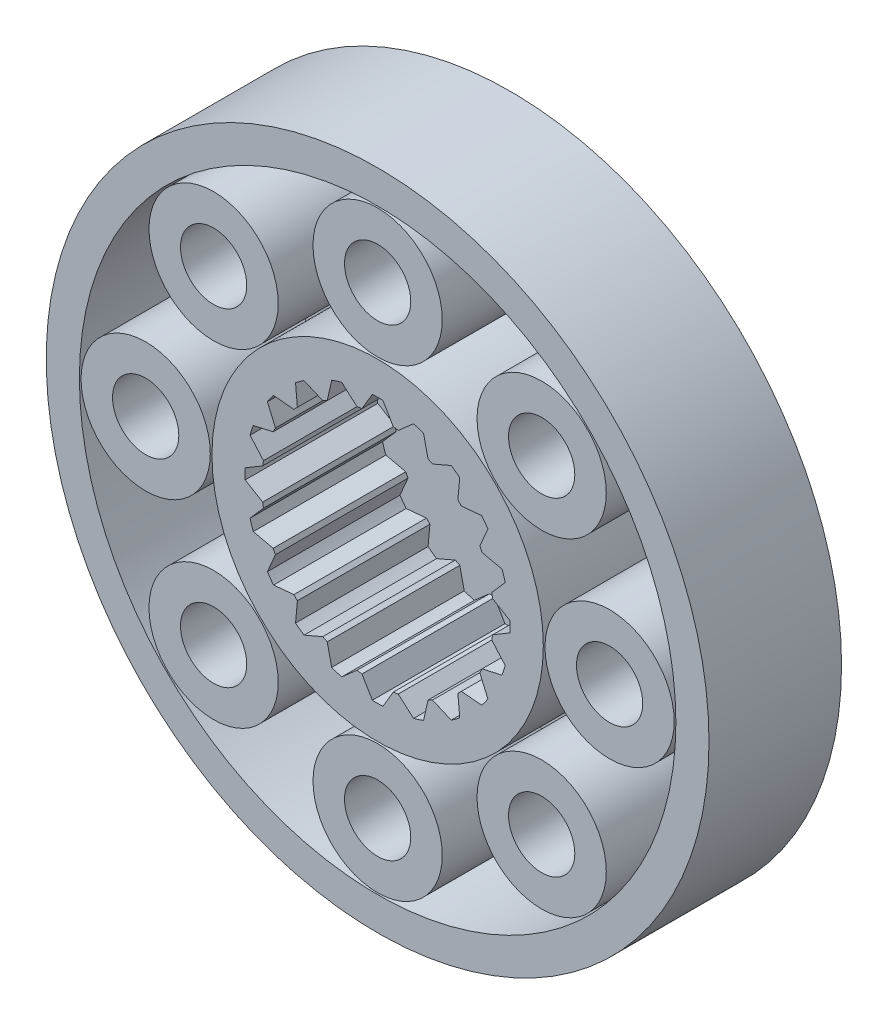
ISO-10303-21;
HEADER;
FILE_DESCRIPTION(('STEP AP214'),'2;1');
FILE_NAME('part.step','',(''),(''),'','','');
FILE_SCHEMA(('AUTOMOTIVE_DESIGN { 1 0 10303 214 1 1 1 1 }'));
ENDSEC;
DATA;
#1=APPLICATION_CONTEXT('core data for automotive mechanical design processes');
#2=APPLICATION_PROTOCOL_DEFINITION('international standard','automotive_design',2000,#1);
#3=PRODUCT_CONTEXT('',#1,'mechanical');
#4=PRODUCT('Part','Part','',(#3));
#5=PRODUCT_RELATED_PRODUCT_CATEGORY('part','',(#4));
#6=PRODUCT_DEFINITION_FORMATION('','',#4);
#7=PRODUCT_DEFINITION_CONTEXT('part definition',#1,'design');
#8=PRODUCT_DEFINITION('design','',#6,#7);
#9=PRODUCT_DEFINITION_SHAPE('','',#8);
#10=(LENGTH_UNIT() NAMED_UNIT(*) SI_UNIT(.MILLI.,.METRE.));
#11=(NAMED_UNIT(*) PLANE_ANGLE_UNIT() SI_UNIT($,.RADIAN.));
#12=(NAMED_UNIT(*) SI_UNIT($,.STERADIAN.) SOLID_ANGLE_UNIT());
#13=UNCERTAINTY_MEASURE_WITH_UNIT(LENGTH_MEASURE(1.E-05),#10,'distance_accuracy_value','');
#14=(GEOMETRIC_REPRESENTATION_CONTEXT(3) GLOBAL_UNCERTAINTY_ASSIGNED_CONTEXT((#13)) GLOBAL_UNIT_ASSIGNED_CONTEXT((#10,
#11,#12)) REPRESENTATION_CONTEXT('',''));
#15=CARTESIAN_POINT('',(0.,0.,0.));
#16=DIRECTION('',(0.,0.,1.));
#17=DIRECTION('',(1.,0.,0.));
#18=AXIS2_PLACEMENT_3D('',#15,#16,#17);
#19=CARTESIAN_POINT('',(0.,0.,-0.00100000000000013));
#20=DIRECTION('',(0.,0.,1.));
#21=DIRECTION('',(1.,0.,0.));
#22=AXIS2_PLACEMENT_3D('',#19,#20,#21);
#23=CYLINDRICAL_SURFACE('',#22,4.);
#24=DIRECTION('',(0.,0.,-1.));
#25=VECTOR('',#24,1.);
#26=CARTESIAN_POINT('',(-2.22086010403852,3.32682737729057,4.));
#27=LINE('',#26,#25);
#28=CARTESIAN_POINT('',(-2.22086010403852,3.32682737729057,4.));
#29=VERTEX_POINT('',#28);
#30=CARTESIAN_POINT('',(-2.22086010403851,3.32682737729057,0.));
#31=VERTEX_POINT('',#30);
#32=EDGE_CURVE('E547',#29,#31,#27,.T.);
#33=ORIENTED_EDGE('',*,*,#32,.F.);
#34=CARTESIAN_POINT('',(0.,0.,4.));
#35=DIRECTION('',(0.,0.,1.));
#36=DIRECTION('',(1.,0.,0.));
#37=AXIS2_PLACEMENT_3D('',#34,#35,#36);
#38=CIRCLE('',#37,4.);
#39=CARTESIAN_POINT('',(-2.47771734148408,3.1402096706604,4.));
#40=VERTEX_POINT('',#39);
#41=EDGE_CURVE('E529',#29,#40,#38,.T.);
#42=ORIENTED_EDGE('',*,*,#41,.T.);
#43=DIRECTION('',(0.,0.,-1.));
#44=VECTOR('',#43,1.);
#45=CARTESIAN_POINT('',(-2.47771734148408,3.14020967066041,4.));
#46=LINE('',#45,#44);
#47=CARTESIAN_POINT('',(-2.47771734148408,3.1402096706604,0.));
#48=VERTEX_POINT('',#47);
#49=EDGE_CURVE('E579',#40,#48,#46,.T.);
#50=ORIENTED_EDGE('',*,*,#49,.T.);
#51=CARTESIAN_POINT('',(0.,0.,0.));
#52=DIRECTION('',(0.,0.,-1.));
#53=DIRECTION('',(-1.,0.,0.));
#54=AXIS2_PLACEMENT_3D('',#51,#52,#53);
#55=CIRCLE('',#54,4.);
#56=EDGE_CURVE('E548',#31,#48,#55,.F.);
#57=ORIENTED_EDGE('',*,*,#56,.F.);
#58=EDGE_LOOP('',(#33,#42,#50,#57));
#59=FACE_BOUND('',#58,.T.);
#60=ADVANCED_FACE('F34',(#59),#23,.F.);
#61=DIRECTION('',(0.,0.,-1.));
#62=VECTOR('',#61,1.);
#63=CARTESIAN_POINT('',(-1.38607106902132,3.75217363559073,4.));
#64=LINE('',#63,#62);
#65=CARTESIAN_POINT('',(-1.38607106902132,3.75217363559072,4.));
#66=VERTEX_POINT('',#65);
#67=CARTESIAN_POINT('',(-1.38607106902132,3.75217363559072,0.));
#68=VERTEX_POINT('',#67);
#69=EDGE_CURVE('E564',#66,#68,#64,.T.);
#70=ORIENTED_EDGE('',*,*,#69,.T.);
#71=CARTESIAN_POINT('',(-1.08411727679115,3.85028437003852,0.));
#72=VERTEX_POINT('',#71);
#73=EDGE_CURVE('E1108',#72,#68,#55,.F.);
#74=ORIENTED_EDGE('',*,*,#73,.F.);
#75=DIRECTION('',(0.,0.,-1.));
#76=VECTOR('',#75,1.);
#77=CARTESIAN_POINT('',(-1.08411727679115,3.85028437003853,4.));
#78=LINE('',#77,#76);
#79=CARTESIAN_POINT('',(-1.08411727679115,3.85028437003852,4.));
#80=VERTEX_POINT('',#79);
#81=EDGE_CURVE('E1098',#80,#72,#78,.T.);
#82=ORIENTED_EDGE('',*,*,#81,.F.);
#83=EDGE_CURVE('E542',#80,#66,#38,.T.);
#84=ORIENTED_EDGE('',*,*,#83,.T.);
#85=EDGE_LOOP('',(#70,#74,#82,#84));
#86=FACE_BOUND('',#85,.T.);
#87=ADVANCED_FACE('F1247',(#86),#23,.F.);
#88=CARTESIAN_POINT('',(0.,0.,0.));
#89=DIRECTION('',(0.,0.,-1.));
#90=DIRECTION('',(-1.,0.,0.));
#91=AXIS2_PLACEMENT_3D('',#88,#89,#90);
#92=PLANE('',#91);
#93=CARTESIAN_POINT('',(0.,0.,0.));
#94=DIRECTION('',(0.,0.,-1.));
#95=DIRECTION('',(-1.,0.,0.));
#96=AXIS2_PLACEMENT_3D('',#93,#94,#95);
#97=CIRCLE('',#96,1.5);
#98=CARTESIAN_POINT('',(-1.5,0.,0.));
#99=VERTEX_POINT('',#98);
#100=EDGE_CURVE('E1104',#99,#99,#97,.F.);
#101=ORIENTED_EDGE('',*,*,#100,.F.);
#102=EDGE_LOOP('',(#101));
#103=FACE_BOUND('',#102,.T.);
#104=DIRECTION('',(0.918474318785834,-0.39548062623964,0.));
#105=VECTOR('',#104,1.);
#106=CARTESIAN_POINT('',(-2.22086010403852,3.32682737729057,0.));
#107=LINE('',#106,#105);
#108=CARTESIAN_POINT('',(-1.65583726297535,3.08353740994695,0.));
#109=VERTEX_POINT('',#108);
#110=EDGE_CURVE('E565',#31,#109,#107,.T.);
#111=ORIENTED_EDGE('',*,*,#110,.F.);
#112=ORIENTED_EDGE('',*,*,#56,.T.);
#113=DIRECTION('',(-0.0923002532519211,0.995731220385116,0.));
#114=VECTOR('',#113,1.);
#115=CARTESIAN_POINT('',(-2.47771734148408,3.14020967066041,0.));
#116=LINE('',#115,#114);
#117=CARTESIAN_POINT('',(-2.42093649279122,2.52766028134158,0.));
#118=VERTEX_POINT('',#117);
#119=EDGE_CURVE('E576',#118,#48,#116,.T.);
#120=ORIENTED_EDGE('',*,*,#119,.F.);
#121=CARTESIAN_POINT('',(0.,0.,0.));
#122=DIRECTION('',(0.,0.,-1.));
#123=DIRECTION('',(1.,0.,0.));
#124=AXIS2_PLACEMENT_3D('',#121,#122,#123);
#125=CIRCLE('',#124,3.50000000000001);
#126=CARTESIAN_POINT('',(-2.52766028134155,2.42093649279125,0.));
#127=VERTEX_POINT('',#126);
#128=EDGE_CURVE('E582',#127,#118,#125,.T.);
#129=ORIENTED_EDGE('',*,*,#128,.F.);
#130=DIRECTION('',(0.995731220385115,-0.0923002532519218,0.));
#131=VECTOR('',#130,1.);
#132=CARTESIAN_POINT('',(-3.14020967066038,2.47771734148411,0.));
#133=LINE('',#132,#131);
#134=CARTESIAN_POINT('',(-3.14020967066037,2.47771734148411,0.));
#135=VERTEX_POINT('',#134);
#136=EDGE_CURVE('E550',#135,#127,#133,.T.);
#137=ORIENTED_EDGE('',*,*,#136,.F.);
#138=CARTESIAN_POINT('',(-3.32682737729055,2.22086010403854,0.));
#139=VERTEX_POINT('',#138);
#140=EDGE_CURVE('E1340',#135,#139,#55,.F.);
#141=ORIENTED_EDGE('',*,*,#140,.T.);
#142=DIRECTION('',(-0.39548062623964,0.918474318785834,0.));
#143=VECTOR('',#142,1.);
#144=CARTESIAN_POINT('',(-3.32682737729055,2.22086010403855,0.));
#145=LINE('',#144,#143);
#146=CARTESIAN_POINT('',(-3.08353740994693,1.65583726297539,0.));
#147=VERTEX_POINT('',#146);
#148=EDGE_CURVE('E601',#147,#139,#145,.T.);
#149=ORIENTED_EDGE('',*,*,#148,.F.);
#150=CARTESIAN_POINT('',(0.,0.,0.));
#151=DIRECTION('',(0.,0.,-1.));
#152=DIRECTION('',(1.,0.,0.));
#153=AXIS2_PLACEMENT_3D('',#150,#151,#152);
#154=CIRCLE('',#153,3.50000000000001);
#155=CARTESIAN_POINT('',(-3.1520583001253,1.52135744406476,0.));
#156=VERTEX_POINT('',#155);
#157=EDGE_CURVE('E609',#156,#147,#154,.T.);
#158=ORIENTED_EDGE('',*,*,#157,.F.);
#159=DIRECTION('',(0.975519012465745,0.219915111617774,0.));
#160=VECTOR('',#159,1.);
#161=CARTESIAN_POINT('',(-3.75217363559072,1.38607106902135,0.));
#162=LINE('',#161,#160);
#163=CARTESIAN_POINT('',(-3.75217363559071,1.38607106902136,0.));
#164=VERTEX_POINT('',#163);
#165=EDGE_CURVE('E597',#164,#156,#162,.T.);
#166=ORIENTED_EDGE('',*,*,#165,.F.);
#167=CARTESIAN_POINT('',(-3.85028437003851,1.08411727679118,0.));
#168=VERTEX_POINT('',#167);
#169=EDGE_CURVE('E1348',#164,#168,#55,.F.);
#170=ORIENTED_EDGE('',*,*,#169,.T.);
#171=DIRECTION('',(-0.659948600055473,0.751310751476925,0.));
#172=VECTOR('',#171,1.);
#173=CARTESIAN_POINT('',(-3.85028437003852,1.08411727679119,0.));
#174=LINE('',#173,#172);
#175=CARTESIAN_POINT('',(-3.4443002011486,0.621929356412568,0.));
#176=VERTEX_POINT('',#175);
#177=EDGE_CURVE('E629',#176,#168,#174,.T.);
#178=ORIENTED_EDGE('',*,*,#177,.F.);
#179=CARTESIAN_POINT('',(0.,0.,0.));
#180=DIRECTION('',(0.,0.,-1.));
#181=DIRECTION('',(1.,0.,0.));
#182=AXIS2_PLACEMENT_3D('',#179,#180,#181);
#183=CIRCLE('',#182,3.5);
#184=CARTESIAN_POINT('',(-3.46791089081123,0.472857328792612,0.));
#185=VERTEX_POINT('',#184);
#186=EDGE_CURVE('E637',#185,#176,#183,.T.);
#187=ORIENTED_EDGE('',*,*,#186,.F.);
#188=DIRECTION('',(0.859816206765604,0.510603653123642,0.));
#189=VECTOR('',#188,1.);
#190=CARTESIAN_POINT('',(-3.99684870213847,0.158746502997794,0.));
#191=LINE('',#190,#189);
#192=CARTESIAN_POINT('',(-3.99684870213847,0.158746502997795,0.));
#193=VERTEX_POINT('',#192);
#194=EDGE_CURVE('E625',#193,#185,#191,.T.);
#195=ORIENTED_EDGE('',*,*,#194,.F.);
#196=CARTESIAN_POINT('',(-3.99684870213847,-0.158746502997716,0.));
#197=VERTEX_POINT('',#196);
#198=EDGE_CURVE('E1351',#193,#197,#55,.F.);
#199=ORIENTED_EDGE('',*,*,#198,.T.);
#200=DIRECTION('',(-0.859816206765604,0.510603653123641,0.));
#201=VECTOR('',#200,1.);
#202=CARTESIAN_POINT('',(-3.99684870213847,-0.158746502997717,0.));
#203=LINE('',#202,#201);
#204=CARTESIAN_POINT('',(-3.46791089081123,-0.472857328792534,0.));
#205=VERTEX_POINT('',#204);
#206=EDGE_CURVE('E657',#205,#197,#203,.T.);
#207=ORIENTED_EDGE('',*,*,#206,.F.);
#208=CARTESIAN_POINT('',(0.,0.,0.));
#209=DIRECTION('',(0.,0.,-1.));
#210=DIRECTION('',(1.,0.,0.));
#211=AXIS2_PLACEMENT_3D('',#208,#209,#210);
#212=CIRCLE('',#211,3.5);
#213=CARTESIAN_POINT('',(-3.44430020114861,-0.621929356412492,0.));
#214=VERTEX_POINT('',#213);
#215=EDGE_CURVE('E665',#214,#205,#212,.T.);
#216=ORIENTED_EDGE('',*,*,#215,.F.);
#217=DIRECTION('',(0.659948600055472,0.751310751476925,0.));
#218=VECTOR('',#217,1.);
#219=CARTESIAN_POINT('',(-3.85028437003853,-1.08411727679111,0.));
#220=LINE('',#219,#218);
#221=CARTESIAN_POINT('',(-3.85028437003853,-1.08411727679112,0.));
#222=VERTEX_POINT('',#221);
#223=EDGE_CURVE('E653',#222,#214,#220,.T.);
#224=ORIENTED_EDGE('',*,*,#223,.F.);
#225=CARTESIAN_POINT('',(-3.7521736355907,-1.38607106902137,0.));
#226=VERTEX_POINT('',#225);
#227=EDGE_CURVE('E1352',#222,#226,#55,.F.);
#228=ORIENTED_EDGE('',*,*,#227,.T.);
#229=DIRECTION('',(-0.975519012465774,0.219915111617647,0.));
#230=VECTOR('',#229,1.);
#231=CARTESIAN_POINT('',(-3.75217363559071,-1.38607106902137,0.));
#232=LINE('',#231,#230);
#233=CARTESIAN_POINT('',(-3.15205830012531,-1.52135744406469,0.));
#234=VERTEX_POINT('',#233);
#235=EDGE_CURVE('E685',#234,#226,#232,.T.);
#236=ORIENTED_EDGE('',*,*,#235,.F.);
#237=CARTESIAN_POINT('',(0.,0.,0.));
#238=DIRECTION('',(0.,0.,-1.));
#239=DIRECTION('',(1.,0.,0.));
#240=AXIS2_PLACEMENT_3D('',#237,#238,#239);
#241=CIRCLE('',#240,3.49999999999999);
#242=CARTESIAN_POINT('',(-3.08353740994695,-1.65583726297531,0.));
#243=VERTEX_POINT('',#242);
#244=EDGE_CURVE('E693',#243,#234,#241,.T.);
#245=ORIENTED_EDGE('',*,*,#244,.F.);
#246=DIRECTION('',(0.39548062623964,0.918474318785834,0.));
#247=VECTOR('',#246,1.);
#248=CARTESIAN_POINT('',(-3.32682737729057,-2.22086010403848,0.));
#249=LINE('',#248,#247);
#250=CARTESIAN_POINT('',(-3.32682737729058,-2.22086010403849,0.));
#251=VERTEX_POINT('',#250);
#252=EDGE_CURVE('E681',#251,#243,#249,.T.);
#253=ORIENTED_EDGE('',*,*,#252,.F.);
#254=CARTESIAN_POINT('',(-3.14020967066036,-2.47771734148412,0.));
#255=VERTEX_POINT('',#254);
#256=EDGE_CURVE('E1354',#251,#255,#55,.F.);
#257=ORIENTED_EDGE('',*,*,#256,.T.);
#258=DIRECTION('',(-0.995731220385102,-0.0923002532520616,0.));
#259=VECTOR('',#258,1.);
#260=CARTESIAN_POINT('',(-3.14020967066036,-2.47771734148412,0.));
#261=LINE('',#260,#259);
#262=CARTESIAN_POINT('',(-2.52766028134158,-2.42093649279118,0.));
#263=VERTEX_POINT('',#262);
#264=EDGE_CURVE('E713',#263,#255,#261,.T.);
#265=ORIENTED_EDGE('',*,*,#264,.F.);
#266=CARTESIAN_POINT('',(0.,0.,0.));
#267=DIRECTION('',(0.,0.,-1.));
#268=DIRECTION('',(1.,0.,0.));
#269=AXIS2_PLACEMENT_3D('',#266,#267,#268);
#270=CIRCLE('',#269,3.49999999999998);
#271=CARTESIAN_POINT('',(-2.42093649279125,-2.52766028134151,0.));
#272=VERTEX_POINT('',#271);
#273=EDGE_CURVE('E721',#272,#263,#270,.T.);
#274=ORIENTED_EDGE('',*,*,#273,.F.);
#275=DIRECTION('',(0.0923002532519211,0.995731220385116,0.));
#276=VECTOR('',#275,1.);
#277=CARTESIAN_POINT('',(-2.47771734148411,-3.14020967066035,0.));
#278=LINE('',#277,#276);
#279=CARTESIAN_POINT('',(-2.47771734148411,-3.14020967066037,0.));
#280=VERTEX_POINT('',#279);
#281=EDGE_CURVE('E709',#280,#272,#278,.T.);
#282=ORIENTED_EDGE('',*,*,#281,.F.);
#283=CARTESIAN_POINT('',(-2.22086010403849,-3.32682737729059,0.));
#284=VERTEX_POINT('',#283);
#285=EDGE_CURVE('E1356',#280,#284,#55,.F.);
#286=ORIENTED_EDGE('',*,*,#285,.T.);
#287=DIRECTION('',(-0.918474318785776,-0.395480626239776,0.));
#288=VECTOR('',#287,1.);
#289=CARTESIAN_POINT('',(-2.22086010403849,-3.32682737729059,0.));
#290=LINE('',#289,#288);
#291=CARTESIAN_POINT('',(-1.65583726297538,-3.08353740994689,0.));
#292=VERTEX_POINT('',#291);
#293=EDGE_CURVE('E741',#292,#284,#290,.T.);
#294=ORIENTED_EDGE('',*,*,#293,.F.);
#295=CARTESIAN_POINT('',(0.,0.,0.));
#296=DIRECTION('',(0.,0.,-1.));
#297=DIRECTION('',(1.,0.,0.));
#298=AXIS2_PLACEMENT_3D('',#295,#296,#297);
#299=CIRCLE('',#298,3.49999999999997);
#300=CARTESIAN_POINT('',(-1.52135744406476,-3.15205830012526,0.));
#301=VERTEX_POINT('',#300);
#302=EDGE_CURVE('E749',#301,#292,#299,.T.);
#303=ORIENTED_EDGE('',*,*,#302,.F.);
#304=DIRECTION('',(-0.219915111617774,0.975519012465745,0.));
#305=VECTOR('',#304,1.);
#306=CARTESIAN_POINT('',(-1.38607106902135,-3.75217363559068,0.));
#307=LINE('',#306,#305);
#308=CARTESIAN_POINT('',(-1.38607106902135,-3.75217363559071,0.));
#309=VERTEX_POINT('',#308);
#310=EDGE_CURVE('E737',#309,#301,#307,.T.);
#311=ORIENTED_EDGE('',*,*,#310,.F.);
#312=CARTESIAN_POINT('',(-1.08411727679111,-3.85028437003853,0.));
#313=VERTEX_POINT('',#312);
#314=EDGE_CURVE('E1358',#309,#313,#55,.F.);
#315=ORIENTED_EDGE('',*,*,#314,.T.);
#316=DIRECTION('',(-0.751310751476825,-0.659948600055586,0.));
#317=VECTOR('',#316,1.);
#318=CARTESIAN_POINT('',(-1.08411727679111,-3.85028437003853,0.));
#319=LINE('',#318,#317);
#320=CARTESIAN_POINT('',(-0.621929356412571,-3.44430020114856,0.));
#321=VERTEX_POINT('',#320);
#322=EDGE_CURVE('E769',#321,#313,#319,.T.);
#323=ORIENTED_EDGE('',*,*,#322,.F.);
#324=CARTESIAN_POINT('',(0.,0.,0.));
#325=DIRECTION('',(0.,0.,-1.));
#326=DIRECTION('',(1.,0.,0.));
#327=AXIS2_PLACEMENT_3D('',#324,#325,#326);
#328=CIRCLE('',#327,3.49999999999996);
#329=CARTESIAN_POINT('',(-0.472857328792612,-3.46791089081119,0.));
#330=VERTEX_POINT('',#329);
#331=EDGE_CURVE('E777',#330,#321,#328,.T.);
#332=ORIENTED_EDGE('',*,*,#331,.F.);
#333=DIRECTION('',(-0.510603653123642,0.859816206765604,0.));
#334=VECTOR('',#333,1.);
#335=CARTESIAN_POINT('',(-0.158746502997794,-3.99684870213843,0.));
#336=LINE('',#335,#334);
#337=CARTESIAN_POINT('',(-0.158746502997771,-3.99684870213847,0.));
#338=VERTEX_POINT('',#337);
#339=EDGE_CURVE('E765',#338,#330,#336,.T.);
#340=ORIENTED_EDGE('',*,*,#339,.F.);
#341=CARTESIAN_POINT('',(0.158746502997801,-3.99684870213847,0.));
#342=VERTEX_POINT('',#341);
#343=EDGE_CURVE('E1360',#338,#342,#55,.F.);
#344=ORIENTED_EDGE('',*,*,#343,.T.);
#345=DIRECTION('',(-0.510603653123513,-0.859816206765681,0.));
#346=VECTOR('',#345,1.);
#347=CARTESIAN_POINT('',(0.158746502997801,-3.99684870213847,0.));
#348=LINE('',#347,#346);
#349=CARTESIAN_POINT('',(0.472857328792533,-3.46791089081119,0.));
#350=VERTEX_POINT('',#349);
#351=EDGE_CURVE('E797',#350,#342,#348,.T.);
#352=ORIENTED_EDGE('',*,*,#351,.F.);
#353=CARTESIAN_POINT('',(0.,0.,0.));
#354=DIRECTION('',(0.,0.,-1.));
#355=DIRECTION('',(1.,0.,0.));
#356=AXIS2_PLACEMENT_3D('',#353,#354,#355);
#357=CIRCLE('',#356,3.49999999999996);
#358=CARTESIAN_POINT('',(0.621929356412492,-3.44430020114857,0.));
#359=VERTEX_POINT('',#358);
#360=EDGE_CURVE('E805',#359,#350,#357,.T.);
#361=ORIENTED_EDGE('',*,*,#360,.F.);
#362=DIRECTION('',(-0.751310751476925,0.659948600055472,0.));
#363=VECTOR('',#362,1.);
#364=CARTESIAN_POINT('',(1.08411727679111,-3.85028437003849,0.));
#365=LINE('',#364,#363);
#366=CARTESIAN_POINT('',(1.08411727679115,-3.85028437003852,0.));
#367=VERTEX_POINT('',#366);
#368=EDGE_CURVE('E793',#367,#359,#365,.T.);
#369=ORIENTED_EDGE('',*,*,#368,.F.);
#370=CARTESIAN_POINT('',(1.38607106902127,-3.75217363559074,0.));
#371=VERTEX_POINT('',#370);
#372=EDGE_CURVE('E1362',#367,#371,#55,.F.);
#373=ORIENTED_EDGE('',*,*,#372,.T.);
#374=DIRECTION('',(-0.219915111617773,-0.975519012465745,0.));
#375=VECTOR('',#374,1.);
#376=CARTESIAN_POINT('',(1.38607106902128,-3.75217363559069,0.));
#377=LINE('',#376,#375);
#378=CARTESIAN_POINT('',(1.52135744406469,-3.15205830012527,0.));
#379=VERTEX_POINT('',#378);
#380=EDGE_CURVE('E825',#379,#371,#377,.T.);
#381=ORIENTED_EDGE('',*,*,#380,.F.);
#382=CARTESIAN_POINT('',(0.,0.,0.));
#383=DIRECTION('',(0.,0.,-1.));
#384=DIRECTION('',(1.,0.,0.));
#385=AXIS2_PLACEMENT_3D('',#382,#383,#384);
#386=CIRCLE('',#385,3.49999999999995);
#387=CARTESIAN_POINT('',(1.65583726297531,-3.08353740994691,0.));
#388=VERTEX_POINT('',#387);
#389=EDGE_CURVE('E833',#388,#379,#386,.T.);
#390=ORIENTED_EDGE('',*,*,#389,.F.);
#391=DIRECTION('',(-0.918474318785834,0.39548062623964,0.));
#392=VECTOR('',#391,1.);
#393=CARTESIAN_POINT('',(2.22086010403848,-3.32682737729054,0.));
#394=LINE('',#393,#392);
#395=CARTESIAN_POINT('',(2.22086010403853,-3.32682737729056,0.));
#396=VERTEX_POINT('',#395);
#397=EDGE_CURVE('E821',#396,#388,#394,.T.);
#398=ORIENTED_EDGE('',*,*,#397,.F.);
#399=CARTESIAN_POINT('',(2.47771734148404,-3.14020967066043,0.));
#400=VERTEX_POINT('',#399);
#401=EDGE_CURVE('E1364',#396,#400,#55,.F.);
#402=ORIENTED_EDGE('',*,*,#401,.T.);
#403=DIRECTION('',(0.0923002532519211,-0.995731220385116,0.));
#404=VECTOR('',#403,1.);
#405=CARTESIAN_POINT('',(2.47771734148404,-3.14020967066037,0.));
#406=LINE('',#405,#404);
#407=CARTESIAN_POINT('',(2.42093649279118,-2.52766028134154,0.));
#408=VERTEX_POINT('',#407);
#409=EDGE_CURVE('E853',#408,#400,#406,.T.);
#410=ORIENTED_EDGE('',*,*,#409,.F.);
#411=CARTESIAN_POINT('',(0.,0.,0.));
#412=DIRECTION('',(0.,0.,-1.));
#413=DIRECTION('',(1.,0.,0.));
#414=AXIS2_PLACEMENT_3D('',#411,#412,#413);
#415=CIRCLE('',#414,3.49999999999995);
#416=CARTESIAN_POINT('',(2.52766028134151,-2.42093649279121,0.));
#417=VERTEX_POINT('',#416);
#418=EDGE_CURVE('E861',#417,#408,#415,.T.);
#419=ORIENTED_EDGE('',*,*,#418,.F.);
#420=DIRECTION('',(-0.995731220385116,0.0923002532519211,0.));
#421=VECTOR('',#420,1.);
#422=CARTESIAN_POINT('',(3.14020967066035,-2.47771734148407,0.));
#423=LINE('',#422,#421);
#424=CARTESIAN_POINT('',(3.1402096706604,-2.47771734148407,0.));
#425=VERTEX_POINT('',#424);
#426=EDGE_CURVE('E849',#425,#417,#423,.T.);
#427=ORIENTED_EDGE('',*,*,#426,.F.);
#428=CARTESIAN_POINT('',(3.32682737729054,-2.22086010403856,0.));
#429=VERTEX_POINT('',#428);
#430=EDGE_CURVE('E1366',#425,#429,#55,.F.);
#431=ORIENTED_EDGE('',*,*,#430,.T.);
#432=DIRECTION('',(0.39548062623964,-0.918474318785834,0.));
#433=VECTOR('',#432,1.);
#434=CARTESIAN_POINT('',(3.32682737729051,-2.22086010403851,0.));
#435=LINE('',#434,#433);
#436=CARTESIAN_POINT('',(3.08353740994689,-1.65583726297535,0.));
#437=VERTEX_POINT('',#436);
#438=EDGE_CURVE('E881',#437,#429,#435,.T.);
#439=ORIENTED_EDGE('',*,*,#438,.F.);
#440=CARTESIAN_POINT('',(0.,0.,0.));
#441=DIRECTION('',(0.,0.,-1.));
#442=DIRECTION('',(1.,0.,0.));
#443=AXIS2_PLACEMENT_3D('',#440,#441,#442);
#444=CIRCLE('',#443,3.49999999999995);
#445=CARTESIAN_POINT('',(3.15205830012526,-1.52135744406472,0.));
#446=VERTEX_POINT('',#445);
#447=EDGE_CURVE('E889',#446,#437,#444,.T.);
#448=ORIENTED_EDGE('',*,*,#447,.F.);
#449=DIRECTION('',(-0.975519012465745,-0.219915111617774,0.));
#450=VECTOR('',#449,1.);
#451=CARTESIAN_POINT('',(3.75217363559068,-1.38607106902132,0.));
#452=LINE('',#451,#450);
#453=CARTESIAN_POINT('',(3.75217363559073,-1.3860710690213,0.));
#454=VERTEX_POINT('',#453);
#455=EDGE_CURVE('E877',#454,#446,#452,.T.);
#456=ORIENTED_EDGE('',*,*,#455,.F.);
#457=CARTESIAN_POINT('',(3.85028437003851,-1.08411727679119,0.));
#458=VERTEX_POINT('',#457);
#459=EDGE_CURVE('E1368',#454,#458,#55,.F.);
#460=ORIENTED_EDGE('',*,*,#459,.T.);
#461=DIRECTION('',(0.659948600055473,-0.751310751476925,0.));
#462=VECTOR('',#461,1.);
#463=CARTESIAN_POINT('',(3.85028437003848,-1.08411727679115,0.));
#464=LINE('',#463,#462);
#465=CARTESIAN_POINT('',(3.44430020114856,-0.62192935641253,0.));
#466=VERTEX_POINT('',#465);
#467=EDGE_CURVE('E909',#466,#458,#464,.T.);
#468=ORIENTED_EDGE('',*,*,#467,.F.);
#469=CARTESIAN_POINT('',(0.,0.,0.));
#470=DIRECTION('',(0.,0.,-1.));
#471=DIRECTION('',(1.,0.,0.));
#472=AXIS2_PLACEMENT_3D('',#469,#470,#471);
#473=CIRCLE('',#472,3.49999999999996);
#474=CARTESIAN_POINT('',(3.46791089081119,-0.472857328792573,0.));
#475=VERTEX_POINT('',#474);
#476=EDGE_CURVE('E917',#475,#466,#473,.T.);
#477=ORIENTED_EDGE('',*,*,#476,.F.);
#478=DIRECTION('',(-0.859816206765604,-0.510603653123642,0.));
#479=VECTOR('',#478,1.);
#480=CARTESIAN_POINT('',(3.99684870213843,-0.158746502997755,0.));
#481=LINE('',#480,#479);
#482=CARTESIAN_POINT('',(3.99684870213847,-0.158746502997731,0.));
#483=VERTEX_POINT('',#482);
#484=EDGE_CURVE('E905',#483,#475,#481,.T.);
#485=ORIENTED_EDGE('',*,*,#484,.F.);
#486=CARTESIAN_POINT('',(3.99684870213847,0.158746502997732,0.));
#487=VERTEX_POINT('',#486);
#488=EDGE_CURVE('E1370',#483,#487,#55,.F.);
#489=ORIENTED_EDGE('',*,*,#488,.T.);
#490=DIRECTION('',(0.859816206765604,-0.510603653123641,0.));
#491=VECTOR('',#490,1.);
#492=CARTESIAN_POINT('',(3.99684870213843,0.158746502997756,0.));
#493=LINE('',#492,#491);
#494=CARTESIAN_POINT('',(3.4679108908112,0.472857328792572,0.));
#495=VERTEX_POINT('',#494);
#496=EDGE_CURVE('E937',#495,#487,#493,.T.);
#497=ORIENTED_EDGE('',*,*,#496,.F.);
#498=CARTESIAN_POINT('',(0.,0.,0.));
#499=DIRECTION('',(0.,0.,-1.));
#500=DIRECTION('',(1.,0.,0.));
#501=AXIS2_PLACEMENT_3D('',#498,#499,#500);
#502=CIRCLE('',#501,3.49999999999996);
#503=CARTESIAN_POINT('',(3.44430020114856,0.621929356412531,0.));
#504=VERTEX_POINT('',#503);
#505=EDGE_CURVE('E945',#504,#495,#502,.T.);
#506=ORIENTED_EDGE('',*,*,#505,.F.);
#507=DIRECTION('',(-0.659948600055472,-0.751310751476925,0.));
#508=VECTOR('',#507,1.);
#509=CARTESIAN_POINT('',(3.85028437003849,1.08411727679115,0.));
#510=LINE('',#509,#508);
#511=CARTESIAN_POINT('',(3.85028437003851,1.08411727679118,0.));
#512=VERTEX_POINT('',#511);
#513=EDGE_CURVE('E933',#512,#504,#510,.T.);
#514=ORIENTED_EDGE('',*,*,#513,.F.);
#515=CARTESIAN_POINT('',(3.75217363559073,1.38607106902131,0.));
#516=VERTEX_POINT('',#515);
#517=EDGE_CURVE('E1372',#512,#516,#55,.F.);
#518=ORIENTED_EDGE('',*,*,#517,.T.);
#519=DIRECTION('',(0.975519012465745,-0.219915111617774,0.));
#520=VECTOR('',#519,1.);
#521=CARTESIAN_POINT('',(3.75217363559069,1.38607106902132,0.));
#522=LINE('',#521,#520);
#523=CARTESIAN_POINT('',(3.15205830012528,1.52135744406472,0.));
#524=VERTEX_POINT('',#523);
#525=EDGE_CURVE('E965',#524,#516,#522,.T.);
#526=ORIENTED_EDGE('',*,*,#525,.F.);
#527=CARTESIAN_POINT('',(0.,0.,0.));
#528=DIRECTION('',(0.,0.,-1.));
#529=DIRECTION('',(1.,0.,0.));
#530=AXIS2_PLACEMENT_3D('',#527,#528,#529);
#531=CIRCLE('',#530,3.49999999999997);
#532=CARTESIAN_POINT('',(3.08353740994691,1.65583726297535,0.));
#533=VERTEX_POINT('',#532);
#534=EDGE_CURVE('E973',#533,#524,#531,.T.);
#535=ORIENTED_EDGE('',*,*,#534,.F.);
#536=DIRECTION('',(-0.39548062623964,-0.918474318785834,0.));
#537=VECTOR('',#536,1.);
#538=CARTESIAN_POINT('',(3.32682737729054,2.22086010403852,0.));
#539=LINE('',#538,#537);
#540=CARTESIAN_POINT('',(3.32682737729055,2.22086010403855,0.));
#541=VERTEX_POINT('',#540);
#542=EDGE_CURVE('E961',#541,#533,#539,.T.);
#543=ORIENTED_EDGE('',*,*,#542,.F.);
#544=CARTESIAN_POINT('',(3.1402096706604,2.47771734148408,0.));
#545=VERTEX_POINT('',#544);
#546=EDGE_CURVE('E1374',#541,#545,#55,.F.);
#547=ORIENTED_EDGE('',*,*,#546,.T.);
#548=DIRECTION('',(0.995731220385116,0.0923002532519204,0.));
#549=VECTOR('',#548,1.);
#550=CARTESIAN_POINT('',(3.14020967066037,2.47771734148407,0.));
#551=LINE('',#550,#549);
#552=CARTESIAN_POINT('',(2.52766028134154,2.42093649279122,0.));
#553=VERTEX_POINT('',#552);
#554=EDGE_CURVE('E993',#553,#545,#551,.T.);
#555=ORIENTED_EDGE('',*,*,#554,.F.);
#556=CARTESIAN_POINT('',(0.,0.,0.));
#557=DIRECTION('',(0.,0.,-1.));
#558=DIRECTION('',(1.,0.,0.));
#559=AXIS2_PLACEMENT_3D('',#556,#557,#558);
#560=CIRCLE('',#559,3.49999999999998);
#561=CARTESIAN_POINT('',(2.42093649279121,2.52766028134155,0.));
#562=VERTEX_POINT('',#561);
#563=EDGE_CURVE('E1001',#562,#553,#560,.T.);
#564=ORIENTED_EDGE('',*,*,#563,.F.);
#565=DIRECTION('',(-0.0923002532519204,-0.995731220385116,0.));
#566=VECTOR('',#565,1.);
#567=CARTESIAN_POINT('',(2.47771734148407,3.14020967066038,0.));
#568=LINE('',#567,#566);
#569=CARTESIAN_POINT('',(2.47771734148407,3.1402096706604,0.));
#570=VERTEX_POINT('',#569);
#571=EDGE_CURVE('E989',#570,#562,#568,.T.);
#572=ORIENTED_EDGE('',*,*,#571,.F.);
#573=CARTESIAN_POINT('',(2.22086010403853,3.32682737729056,0.));
#574=VERTEX_POINT('',#573);
#575=EDGE_CURVE('E1376',#570,#574,#55,.F.);
#576=ORIENTED_EDGE('',*,*,#575,.T.);
#577=DIRECTION('',(0.918474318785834,0.39548062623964,0.));
#578=VECTOR('',#577,1.);
#579=CARTESIAN_POINT('',(2.22086010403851,3.32682737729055,0.));
#580=LINE('',#579,#578);
#581=CARTESIAN_POINT('',(1.65583726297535,3.08353740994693,0.));
#582=VERTEX_POINT('',#581);
#583=EDGE_CURVE('E1021',#582,#574,#580,.T.);
#584=ORIENTED_EDGE('',*,*,#583,.F.);
#585=CARTESIAN_POINT('',(0.,0.,0.));
#586=DIRECTION('',(0.,0.,-1.));
#587=DIRECTION('',(1.,0.,0.));
#588=AXIS2_PLACEMENT_3D('',#585,#586,#587);
#589=CIRCLE('',#588,3.49999999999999);
#590=CARTESIAN_POINT('',(1.52135744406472,3.1520583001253,0.));
#591=VERTEX_POINT('',#590);
#592=EDGE_CURVE('E1029',#591,#582,#589,.T.);
#593=ORIENTED_EDGE('',*,*,#592,.F.);
#594=DIRECTION('',(0.219915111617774,-0.975519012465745,0.));
#595=VECTOR('',#594,1.);
#596=CARTESIAN_POINT('',(1.38607106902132,3.75217363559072,0.));
#597=LINE('',#596,#595);
#598=CARTESIAN_POINT('',(1.38607106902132,3.75217363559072,0.));
#599=VERTEX_POINT('',#598);
#600=EDGE_CURVE('E1017',#599,#591,#597,.T.);
#601=ORIENTED_EDGE('',*,*,#600,.F.);
#602=CARTESIAN_POINT('',(1.08411727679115,3.85028437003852,0.));
#603=VERTEX_POINT('',#602);
#604=EDGE_CURVE('E1378',#599,#603,#55,.F.);
#605=ORIENTED_EDGE('',*,*,#604,.T.);
#606=DIRECTION('',(0.751310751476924,0.659948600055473,0.));
#607=VECTOR('',#606,1.);
#608=CARTESIAN_POINT('',(1.08411727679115,3.85028437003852,0.));
#609=LINE('',#608,#607);
#610=CARTESIAN_POINT('',(0.62192935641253,3.4443002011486,0.));
#611=VERTEX_POINT('',#610);
#612=EDGE_CURVE('E1049',#611,#603,#609,.T.);
#613=ORIENTED_EDGE('',*,*,#612,.F.);
#614=CARTESIAN_POINT('',(0.,0.,0.));
#615=DIRECTION('',(0.,0.,-1.));
#616=DIRECTION('',(1.,0.,0.));
#617=AXIS2_PLACEMENT_3D('',#614,#615,#616);
#618=CIRCLE('',#617,3.5);
#619=CARTESIAN_POINT('',(0.472857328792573,3.46791089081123,0.));
#620=VERTEX_POINT('',#619);
#621=EDGE_CURVE('E1057',#620,#611,#618,.T.);
#622=ORIENTED_EDGE('',*,*,#621,.F.);
#623=DIRECTION('',(0.510603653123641,-0.859816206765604,0.));
#624=VECTOR('',#623,1.);
#625=CARTESIAN_POINT('',(0.158746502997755,3.99684870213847,0.));
#626=LINE('',#625,#624);
#627=CARTESIAN_POINT('',(0.158746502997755,3.99684870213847,0.));
#628=VERTEX_POINT('',#627);
#629=EDGE_CURVE('E1045',#628,#620,#626,.T.);
#630=ORIENTED_EDGE('',*,*,#629,.F.);
#631=CARTESIAN_POINT('',(-0.158746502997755,3.99684870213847,0.));
#632=VERTEX_POINT('',#631);
#633=EDGE_CURVE('E1107',#628,#632,#55,.F.);
#634=ORIENTED_EDGE('',*,*,#633,.T.);
#635=DIRECTION('',(0.510603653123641,0.859816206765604,0.));
#636=VECTOR('',#635,1.);
#637=CARTESIAN_POINT('',(-0.158746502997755,3.99684870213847,0.));
#638=LINE('',#637,#636);
#639=CARTESIAN_POINT('',(-0.472857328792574,3.46791089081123,0.));
#640=VERTEX_POINT('',#639);
#641=EDGE_CURVE('E1077',#640,#632,#638,.T.);
#642=ORIENTED_EDGE('',*,*,#641,.F.);
#643=CARTESIAN_POINT('',(0.,0.,0.));
#644=DIRECTION('',(0.,0.,-1.));
#645=DIRECTION('',(1.,0.,0.));
#646=AXIS2_PLACEMENT_3D('',#643,#644,#645);
#647=CIRCLE('',#646,3.5);
#648=CARTESIAN_POINT('',(-0.621929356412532,3.4443002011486,0.));
#649=VERTEX_POINT('',#648);
#650=EDGE_CURVE('E1085',#649,#640,#647,.T.);
#651=ORIENTED_EDGE('',*,*,#650,.F.);
#652=DIRECTION('',(0.751310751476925,-0.659948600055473,0.));
#653=VECTOR('',#652,1.);
#654=CARTESIAN_POINT('',(-1.08411727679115,3.85028437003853,0.));
#655=LINE('',#654,#653);
#656=EDGE_CURVE('E1073',#72,#649,#655,.T.);
#657=ORIENTED_EDGE('',*,*,#656,.F.);
#658=ORIENTED_EDGE('',*,*,#73,.T.);
#659=DIRECTION('',(0.219915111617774,0.975519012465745,0.));
#660=VECTOR('',#659,1.);
#661=CARTESIAN_POINT('',(-1.38607106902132,3.75217363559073,0.));
#662=LINE('',#661,#660);
#663=CARTESIAN_POINT('',(-1.52135744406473,3.15205830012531,0.));
#664=VERTEX_POINT('',#663);
#665=EDGE_CURVE('E54',#664,#68,#662,.T.);
#666=ORIENTED_EDGE('',*,*,#665,.F.);
#667=CARTESIAN_POINT('',(0.,0.,0.));
#668=DIRECTION('',(0.,0.,-1.));
#669=DIRECTION('',(1.,0.,0.));
#670=AXIS2_PLACEMENT_3D('',#667,#668,#669);
#671=CIRCLE('',#670,3.50000000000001);
#672=EDGE_CURVE('E49',#109,#664,#671,.T.);
#673=ORIENTED_EDGE('',*,*,#672,.F.);
#674=EDGE_LOOP('',(#111,#112,#120,#129,#137,#141,#149,#158,#166,#170,#178,#187,#195,#199,#207,
#216,#224,#228,#236,#245,#253,#257,#265,#274,#282,#286,#294,#303,#311,#315,#323,#332,#340,#344,
#352,#361,#369,#373,#381,#390,#398,#402,#410,#419,#427,#431,#439,#448,#456,#460,#468,#477,#485,
#489,#497,#506,#514,#518,#526,#535,#543,#547,#555,#564,#572,#576,#584,#593,#601,#605,#613,#622,
#630,#634,#642,#651,#657,#658,#666,#673));
#675=FACE_BOUND('',#674,.T.);
#676=ADVANCED_FACE('F1254',(#103,#675),#92,.F.);
#677=DIRECTION('',(0.,0.,-1.));
#678=VECTOR('',#677,1.);
#679=CARTESIAN_POINT('',(-3.14020967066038,2.47771734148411,4.));
#680=LINE('',#679,#678);
#681=CARTESIAN_POINT('',(-3.14020967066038,2.47771734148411,4.));
#682=VERTEX_POINT('',#681);
#683=EDGE_CURVE('E594',#682,#135,#680,.T.);
#684=ORIENTED_EDGE('',*,*,#683,.F.);
#685=CARTESIAN_POINT('',(-3.32682737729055,2.22086010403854,4.));
#686=VERTEX_POINT('',#685);
#687=EDGE_CURVE('E543',#682,#686,#38,.T.);
#688=ORIENTED_EDGE('',*,*,#687,.T.);
#689=DIRECTION('',(0.,0.,-1.));
#690=VECTOR('',#689,1.);
#691=CARTESIAN_POINT('',(-3.32682737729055,2.22086010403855,4.));
#692=LINE('',#691,#690);
#693=EDGE_CURVE('E606',#686,#139,#692,.T.);
#694=ORIENTED_EDGE('',*,*,#693,.T.);
#695=ORIENTED_EDGE('',*,*,#140,.F.);
#696=EDGE_LOOP('',(#684,#688,#694,#695));
#697=FACE_BOUND('',#696,.T.);
#698=ADVANCED_FACE('F1256',(#697),#23,.F.);
#699=DIRECTION('',(0.,0.,-1.));
#700=VECTOR('',#699,1.);
#701=CARTESIAN_POINT('',(-3.75217363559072,1.38607106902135,4.));
#702=LINE('',#701,#700);
#703=CARTESIAN_POINT('',(-3.75217363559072,1.38607106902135,4.));
#704=VERTEX_POINT('',#703);
#705=EDGE_CURVE('E622',#704,#164,#702,.T.);
#706=ORIENTED_EDGE('',*,*,#705,.F.);
#707=CARTESIAN_POINT('',(-3.85028437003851,1.08411727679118,4.));
#708=VERTEX_POINT('',#707);
#709=EDGE_CURVE('E1325',#704,#708,#38,.T.);
#710=ORIENTED_EDGE('',*,*,#709,.T.);
#711=DIRECTION('',(0.,0.,-1.));
#712=VECTOR('',#711,1.);
#713=CARTESIAN_POINT('',(-3.85028437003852,1.08411727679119,4.));
#714=LINE('',#713,#712);
#715=EDGE_CURVE('E634',#708,#168,#714,.T.);
#716=ORIENTED_EDGE('',*,*,#715,.T.);
#717=ORIENTED_EDGE('',*,*,#169,.F.);
#718=EDGE_LOOP('',(#706,#710,#716,#717));
#719=FACE_BOUND('',#718,.T.);
#720=ADVANCED_FACE('F1349',(#719),#23,.F.);
#721=DIRECTION('',(0.,0.,-1.));
#722=VECTOR('',#721,1.);
#723=CARTESIAN_POINT('',(-3.99684870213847,0.158746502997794,4.));
#724=LINE('',#723,#722);
#725=CARTESIAN_POINT('',(-3.99684870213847,0.158746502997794,4.));
#726=VERTEX_POINT('',#725);
#727=EDGE_CURVE('E650',#726,#193,#724,.T.);
#728=ORIENTED_EDGE('',*,*,#727,.F.);
#729=CARTESIAN_POINT('',(-3.99684870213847,-0.158746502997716,4.));
#730=VERTEX_POINT('',#729);
#731=EDGE_CURVE('E1322',#726,#730,#38,.T.);
#732=ORIENTED_EDGE('',*,*,#731,.T.);
#733=DIRECTION('',(0.,0.,-1.));
#734=VECTOR('',#733,1.);
#735=CARTESIAN_POINT('',(-3.99684870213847,-0.158746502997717,4.));
#736=LINE('',#735,#734);
#737=EDGE_CURVE('E662',#730,#197,#736,.T.);
#738=ORIENTED_EDGE('',*,*,#737,.T.);
#739=ORIENTED_EDGE('',*,*,#198,.F.);
#740=EDGE_LOOP('',(#728,#732,#738,#739));
#741=FACE_BOUND('',#740,.T.);
#742=ADVANCED_FACE('F2072',(#741),#23,.F.);
#743=DIRECTION('',(0.,0.,-1.));
#744=VECTOR('',#743,1.);
#745=CARTESIAN_POINT('',(-3.85028437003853,-1.08411727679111,4.));
#746=LINE('',#745,#744);
#747=CARTESIAN_POINT('',(-3.85028437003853,-1.08411727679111,4.));
#748=VERTEX_POINT('',#747);
#749=EDGE_CURVE('E678',#748,#222,#746,.T.);
#750=ORIENTED_EDGE('',*,*,#749,.F.);
#751=CARTESIAN_POINT('',(-3.7521736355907,-1.38607106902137,4.));
#752=VERTEX_POINT('',#751);
#753=EDGE_CURVE('E1319',#748,#752,#38,.T.);
#754=ORIENTED_EDGE('',*,*,#753,.T.);
#755=DIRECTION('',(0.,0.,-1.));
#756=VECTOR('',#755,1.);
#757=CARTESIAN_POINT('',(-3.75217363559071,-1.38607106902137,4.));
#758=LINE('',#757,#756);
#759=EDGE_CURVE('E690',#752,#226,#758,.T.);
#760=ORIENTED_EDGE('',*,*,#759,.T.);
#761=ORIENTED_EDGE('',*,*,#227,.F.);
#762=EDGE_LOOP('',(#750,#754,#760,#761));
#763=FACE_BOUND('',#762,.T.);
#764=ADVANCED_FACE('F2065',(#763),#23,.F.);
#765=DIRECTION('',(0.,0.,-1.));
#766=VECTOR('',#765,1.);
#767=CARTESIAN_POINT('',(-3.32682737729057,-2.22086010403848,4.));
#768=LINE('',#767,#766);
#769=CARTESIAN_POINT('',(-3.32682737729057,-2.22086010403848,4.));
#770=VERTEX_POINT('',#769);
#771=EDGE_CURVE('E706',#770,#251,#768,.T.);
#772=ORIENTED_EDGE('',*,*,#771,.F.);
#773=CARTESIAN_POINT('',(-3.14020967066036,-2.47771734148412,4.));
#774=VERTEX_POINT('',#773);
#775=EDGE_CURVE('E1316',#770,#774,#38,.T.);
#776=ORIENTED_EDGE('',*,*,#775,.T.);
#777=DIRECTION('',(0.,0.,-1.));
#778=VECTOR('',#777,1.);
#779=CARTESIAN_POINT('',(-3.14020967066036,-2.47771734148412,4.));
#780=LINE('',#779,#778);
#781=EDGE_CURVE('E718',#774,#255,#780,.T.);
#782=ORIENTED_EDGE('',*,*,#781,.T.);
#783=ORIENTED_EDGE('',*,*,#256,.F.);
#784=EDGE_LOOP('',(#772,#776,#782,#783));
#785=FACE_BOUND('',#784,.T.);
#786=ADVANCED_FACE('F2057',(#785),#23,.F.);
#787=DIRECTION('',(0.,0.,-1.));
#788=VECTOR('',#787,1.);
#789=CARTESIAN_POINT('',(-2.47771734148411,-3.14020967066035,4.));
#790=LINE('',#789,#788);
#791=CARTESIAN_POINT('',(-2.47771734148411,-3.14020967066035,4.));
#792=VERTEX_POINT('',#791);
#793=EDGE_CURVE('E734',#792,#280,#790,.T.);
#794=ORIENTED_EDGE('',*,*,#793,.F.);
#795=CARTESIAN_POINT('',(-2.22086010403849,-3.32682737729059,4.));
#796=VERTEX_POINT('',#795);
#797=EDGE_CURVE('E1313',#792,#796,#38,.T.);
#798=ORIENTED_EDGE('',*,*,#797,.T.);
#799=DIRECTION('',(0.,0.,-1.));
#800=VECTOR('',#799,1.);
#801=CARTESIAN_POINT('',(-2.22086010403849,-3.32682737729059,4.));
#802=LINE('',#801,#800);
#803=EDGE_CURVE('E746',#796,#284,#802,.T.);
#804=ORIENTED_EDGE('',*,*,#803,.T.);
#805=ORIENTED_EDGE('',*,*,#285,.F.);
#806=EDGE_LOOP('',(#794,#798,#804,#805));
#807=FACE_BOUND('',#806,.T.);
#808=ADVANCED_FACE('F2050',(#807),#23,.F.);
#809=DIRECTION('',(0.,0.,-1.));
#810=VECTOR('',#809,1.);
#811=CARTESIAN_POINT('',(-1.38607106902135,-3.75217363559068,4.));
#812=LINE('',#811,#810);
#813=CARTESIAN_POINT('',(-1.38607106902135,-3.75217363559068,4.));
#814=VERTEX_POINT('',#813);
#815=EDGE_CURVE('E762',#814,#309,#812,.T.);
#816=ORIENTED_EDGE('',*,*,#815,.F.);
#817=CARTESIAN_POINT('',(-1.08411727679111,-3.85028437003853,4.));
#818=VERTEX_POINT('',#817);
#819=EDGE_CURVE('E1310',#814,#818,#38,.T.);
#820=ORIENTED_EDGE('',*,*,#819,.T.);
#821=DIRECTION('',(0.,0.,-1.));
#822=VECTOR('',#821,1.);
#823=CARTESIAN_POINT('',(-1.08411727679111,-3.85028437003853,4.));
#824=LINE('',#823,#822);
#825=EDGE_CURVE('E774',#818,#313,#824,.T.);
#826=ORIENTED_EDGE('',*,*,#825,.T.);
#827=ORIENTED_EDGE('',*,*,#314,.F.);
#828=EDGE_LOOP('',(#816,#820,#826,#827));
#829=FACE_BOUND('',#828,.T.);
#830=ADVANCED_FACE('F2042',(#829),#23,.F.);
#831=DIRECTION('',(0.,0.,-1.));
#832=VECTOR('',#831,1.);
#833=CARTESIAN_POINT('',(-0.158746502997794,-3.99684870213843,4.));
#834=LINE('',#833,#832);
#835=CARTESIAN_POINT('',(-0.158746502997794,-3.99684870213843,4.));
#836=VERTEX_POINT('',#835);
#837=EDGE_CURVE('E790',#836,#338,#834,.T.);
#838=ORIENTED_EDGE('',*,*,#837,.F.);
#839=CARTESIAN_POINT('',(0.158746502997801,-3.99684870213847,4.));
#840=VERTEX_POINT('',#839);
#841=EDGE_CURVE('E1307',#836,#840,#38,.T.);
#842=ORIENTED_EDGE('',*,*,#841,.T.);
#843=DIRECTION('',(0.,0.,-1.));
#844=VECTOR('',#843,1.);
#845=CARTESIAN_POINT('',(0.158746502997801,-3.99684870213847,4.));
#846=LINE('',#845,#844);
#847=EDGE_CURVE('E802',#840,#342,#846,.T.);
#848=ORIENTED_EDGE('',*,*,#847,.T.);
#849=ORIENTED_EDGE('',*,*,#343,.F.);
#850=EDGE_LOOP('',(#838,#842,#848,#849));
#851=FACE_BOUND('',#850,.T.);
#852=ADVANCED_FACE('F2035',(#851),#23,.F.);
#853=DIRECTION('',(0.,0.,-1.));
#854=VECTOR('',#853,1.);
#855=CARTESIAN_POINT('',(1.08411727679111,-3.85028437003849,4.));
#856=LINE('',#855,#854);
#857=CARTESIAN_POINT('',(1.08411727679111,-3.85028437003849,4.));
#858=VERTEX_POINT('',#857);
#859=EDGE_CURVE('E818',#858,#367,#856,.T.);
#860=ORIENTED_EDGE('',*,*,#859,.F.);
#861=CARTESIAN_POINT('',(1.38607106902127,-3.75217363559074,4.));
#862=VERTEX_POINT('',#861);
#863=EDGE_CURVE('E1304',#858,#862,#38,.T.);
#864=ORIENTED_EDGE('',*,*,#863,.T.);
#865=DIRECTION('',(0.,0.,-1.));
#866=VECTOR('',#865,1.);
#867=CARTESIAN_POINT('',(1.38607106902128,-3.75217363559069,4.));
#868=LINE('',#867,#866);
#869=EDGE_CURVE('E830',#862,#371,#868,.T.);
#870=ORIENTED_EDGE('',*,*,#869,.T.);
#871=ORIENTED_EDGE('',*,*,#372,.F.);
#872=EDGE_LOOP('',(#860,#864,#870,#871));
#873=FACE_BOUND('',#872,.T.);
#874=ADVANCED_FACE('F2027',(#873),#23,.F.);
#875=DIRECTION('',(0.,0.,-1.));
#876=VECTOR('',#875,1.);
#877=CARTESIAN_POINT('',(2.22086010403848,-3.32682737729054,4.));
#878=LINE('',#877,#876);
#879=CARTESIAN_POINT('',(2.22086010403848,-3.32682737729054,4.));
#880=VERTEX_POINT('',#879);
#881=EDGE_CURVE('E846',#880,#396,#878,.T.);
#882=ORIENTED_EDGE('',*,*,#881,.F.);
#883=CARTESIAN_POINT('',(2.47771734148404,-3.14020967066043,4.));
#884=VERTEX_POINT('',#883);
#885=EDGE_CURVE('E1301',#880,#884,#38,.T.);
#886=ORIENTED_EDGE('',*,*,#885,.T.);
#887=DIRECTION('',(0.,0.,-1.));
#888=VECTOR('',#887,1.);
#889=CARTESIAN_POINT('',(2.47771734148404,-3.14020967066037,4.));
#890=LINE('',#889,#888);
#891=EDGE_CURVE('E858',#884,#400,#890,.T.);
#892=ORIENTED_EDGE('',*,*,#891,.T.);
#893=ORIENTED_EDGE('',*,*,#401,.F.);
#894=EDGE_LOOP('',(#882,#886,#892,#893));
#895=FACE_BOUND('',#894,.T.);
#896=ADVANCED_FACE('F2020',(#895),#23,.F.);
#897=DIRECTION('',(0.,0.,-1.));
#898=VECTOR('',#897,1.);
#899=CARTESIAN_POINT('',(3.14020967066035,-2.47771734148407,4.));
#900=LINE('',#899,#898);
#901=CARTESIAN_POINT('',(3.14020967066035,-2.47771734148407,4.));
#902=VERTEX_POINT('',#901);
#903=EDGE_CURVE('E874',#902,#425,#900,.T.);
#904=ORIENTED_EDGE('',*,*,#903,.F.);
#905=CARTESIAN_POINT('',(3.32682737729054,-2.22086010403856,4.));
#906=VERTEX_POINT('',#905);
#907=EDGE_CURVE('E1298',#902,#906,#38,.T.);
#908=ORIENTED_EDGE('',*,*,#907,.T.);
#909=DIRECTION('',(0.,0.,-1.));
#910=VECTOR('',#909,1.);
#911=CARTESIAN_POINT('',(3.32682737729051,-2.22086010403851,4.));
#912=LINE('',#911,#910);
#913=EDGE_CURVE('E886',#906,#429,#912,.T.);
#914=ORIENTED_EDGE('',*,*,#913,.T.);
#915=ORIENTED_EDGE('',*,*,#430,.F.);
#916=EDGE_LOOP('',(#904,#908,#914,#915));
#917=FACE_BOUND('',#916,.T.);
#918=ADVANCED_FACE('F2012',(#917),#23,.F.);
#919=DIRECTION('',(0.,0.,-1.));
#920=VECTOR('',#919,1.);
#921=CARTESIAN_POINT('',(3.75217363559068,-1.38607106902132,4.));
#922=LINE('',#921,#920);
#923=CARTESIAN_POINT('',(3.75217363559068,-1.38607106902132,4.));
#924=VERTEX_POINT('',#923);
#925=EDGE_CURVE('E902',#924,#454,#922,.T.);
#926=ORIENTED_EDGE('',*,*,#925,.F.);
#927=CARTESIAN_POINT('',(3.85028437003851,-1.08411727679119,4.));
#928=VERTEX_POINT('',#927);
#929=EDGE_CURVE('E1295',#924,#928,#38,.T.);
#930=ORIENTED_EDGE('',*,*,#929,.T.);
#931=DIRECTION('',(0.,0.,-1.));
#932=VECTOR('',#931,1.);
#933=CARTESIAN_POINT('',(3.85028437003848,-1.08411727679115,4.));
#934=LINE('',#933,#932);
#935=EDGE_CURVE('E914',#928,#458,#934,.T.);
#936=ORIENTED_EDGE('',*,*,#935,.T.);
#937=ORIENTED_EDGE('',*,*,#459,.F.);
#938=EDGE_LOOP('',(#926,#930,#936,#937));
#939=FACE_BOUND('',#938,.T.);
#940=ADVANCED_FACE('F2005',(#939),#23,.F.);
#941=DIRECTION('',(0.,0.,-1.));
#942=VECTOR('',#941,1.);
#943=CARTESIAN_POINT('',(3.99684870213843,-0.158746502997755,4.));
#944=LINE('',#943,#942);
#945=CARTESIAN_POINT('',(3.99684870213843,-0.158746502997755,4.));
#946=VERTEX_POINT('',#945);
#947=EDGE_CURVE('E930',#946,#483,#944,.T.);
#948=ORIENTED_EDGE('',*,*,#947,.F.);
#949=CARTESIAN_POINT('',(3.99684870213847,0.158746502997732,4.));
#950=VERTEX_POINT('',#949);
#951=EDGE_CURVE('E1292',#946,#950,#38,.T.);
#952=ORIENTED_EDGE('',*,*,#951,.T.);
#953=DIRECTION('',(0.,0.,-1.));
#954=VECTOR('',#953,1.);
#955=CARTESIAN_POINT('',(3.99684870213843,0.158746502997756,4.));
#956=LINE('',#955,#954);
#957=EDGE_CURVE('E942',#950,#487,#956,.T.);
#958=ORIENTED_EDGE('',*,*,#957,.T.);
#959=ORIENTED_EDGE('',*,*,#488,.F.);
#960=EDGE_LOOP('',(#948,#952,#958,#959));
#961=FACE_BOUND('',#960,.T.);
#962=ADVANCED_FACE('F1997',(#961),#23,.F.);
#963=DIRECTION('',(0.,0.,-1.));
#964=VECTOR('',#963,1.);
#965=CARTESIAN_POINT('',(3.85028437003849,1.08411727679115,4.));
#966=LINE('',#965,#964);
#967=CARTESIAN_POINT('',(3.85028437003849,1.08411727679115,4.));
#968=VERTEX_POINT('',#967);
#969=EDGE_CURVE('E958',#968,#512,#966,.T.);
#970=ORIENTED_EDGE('',*,*,#969,.F.);
#971=CARTESIAN_POINT('',(3.75217363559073,1.38607106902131,4.));
#972=VERTEX_POINT('',#971);
#973=EDGE_CURVE('E1289',#968,#972,#38,.T.);
#974=ORIENTED_EDGE('',*,*,#973,.T.);
#975=DIRECTION('',(0.,0.,-1.));
#976=VECTOR('',#975,1.);
#977=CARTESIAN_POINT('',(3.75217363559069,1.38607106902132,4.));
#978=LINE('',#977,#976);
#979=EDGE_CURVE('E970',#972,#516,#978,.T.);
#980=ORIENTED_EDGE('',*,*,#979,.T.);
#981=ORIENTED_EDGE('',*,*,#517,.F.);
#982=EDGE_LOOP('',(#970,#974,#980,#981));
#983=FACE_BOUND('',#982,.T.);
#984=ADVANCED_FACE('F1990',(#983),#23,.F.);
#985=DIRECTION('',(0.,0.,-1.));
#986=VECTOR('',#985,1.);
#987=CARTESIAN_POINT('',(3.32682737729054,2.22086010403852,4.));
#988=LINE('',#987,#986);
#989=CARTESIAN_POINT('',(3.32682737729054,2.22086010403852,4.));
#990=VERTEX_POINT('',#989);
#991=EDGE_CURVE('E986',#990,#541,#988,.T.);
#992=ORIENTED_EDGE('',*,*,#991,.F.);
#993=CARTESIAN_POINT('',(3.1402096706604,2.47771734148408,4.));
#994=VERTEX_POINT('',#993);
#995=EDGE_CURVE('E1286',#990,#994,#38,.T.);
#996=ORIENTED_EDGE('',*,*,#995,.T.);
#997=DIRECTION('',(0.,0.,-1.));
#998=VECTOR('',#997,1.);
#999=CARTESIAN_POINT('',(3.14020967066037,2.47771734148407,4.));
#1000=LINE('',#999,#998);
#1001=EDGE_CURVE('E998',#994,#545,#1000,.T.);
#1002=ORIENTED_EDGE('',*,*,#1001,.T.);
#1003=ORIENTED_EDGE('',*,*,#546,.F.);
#1004=EDGE_LOOP('',(#992,#996,#1002,#1003));
#1005=FACE_BOUND('',#1004,.T.);
#1006=ADVANCED_FACE('F1982',(#1005),#23,.F.);
#1007=DIRECTION('',(0.,0.,-1.));
#1008=VECTOR('',#1007,1.);
#1009=CARTESIAN_POINT('',(2.47771734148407,3.14020967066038,4.));
#1010=LINE('',#1009,#1008);
#1011=CARTESIAN_POINT('',(2.47771734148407,3.14020967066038,4.));
#1012=VERTEX_POINT('',#1011);
#1013=EDGE_CURVE('E1014',#1012,#570,#1010,.T.);
#1014=ORIENTED_EDGE('',*,*,#1013,.F.);
#1015=CARTESIAN_POINT('',(2.22086010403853,3.32682737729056,4.));
#1016=VERTEX_POINT('',#1015);
#1017=EDGE_CURVE('E1284',#1012,#1016,#38,.T.);
#1018=ORIENTED_EDGE('',*,*,#1017,.T.);
#1019=DIRECTION('',(0.,0.,-1.));
#1020=VECTOR('',#1019,1.);
#1021=CARTESIAN_POINT('',(2.22086010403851,3.32682737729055,4.));
#1022=LINE('',#1021,#1020);
#1023=EDGE_CURVE('E1026',#1016,#574,#1022,.T.);
#1024=ORIENTED_EDGE('',*,*,#1023,.T.);
#1025=ORIENTED_EDGE('',*,*,#575,.F.);
#1026=EDGE_LOOP('',(#1014,#1018,#1024,#1025));
#1027=FACE_BOUND('',#1026,.T.);
#1028=ADVANCED_FACE('F1271',(#1027),#23,.F.);
#1029=DIRECTION('',(0.,0.,-1.));
#1030=VECTOR('',#1029,1.);
#1031=CARTESIAN_POINT('',(1.38607106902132,3.75217363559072,4.));
#1032=LINE('',#1031,#1030);
#1033=CARTESIAN_POINT('',(1.38607106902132,3.75217363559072,4.));
#1034=VERTEX_POINT('',#1033);
#1035=EDGE_CURVE('E1042',#1034,#599,#1032,.T.);
#1036=ORIENTED_EDGE('',*,*,#1035,.F.);
#1037=CARTESIAN_POINT('',(1.08411727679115,3.85028437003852,4.));
#1038=VERTEX_POINT('',#1037);
#1039=EDGE_CURVE('E1283',#1034,#1038,#38,.T.);
#1040=ORIENTED_EDGE('',*,*,#1039,.T.);
#1041=DIRECTION('',(0.,0.,-1.));
#1042=VECTOR('',#1041,1.);
#1043=CARTESIAN_POINT('',(1.08411727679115,3.85028437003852,4.));
#1044=LINE('',#1043,#1042);
#1045=EDGE_CURVE('E1054',#1038,#603,#1044,.T.);
#1046=ORIENTED_EDGE('',*,*,#1045,.T.);
#1047=ORIENTED_EDGE('',*,*,#604,.F.);
#1048=EDGE_LOOP('',(#1036,#1040,#1046,#1047));
#1049=FACE_BOUND('',#1048,.T.);
#1050=ADVANCED_FACE('F1261',(#1049),#23,.F.);
#1051=DIRECTION('',(0.,0.,-1.));
#1052=VECTOR('',#1051,1.);
#1053=CARTESIAN_POINT('',(0.158746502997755,3.99684870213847,4.));
#1054=LINE('',#1053,#1052);
#1055=CARTESIAN_POINT('',(0.158746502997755,3.99684870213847,4.));
#1056=VERTEX_POINT('',#1055);
#1057=EDGE_CURVE('E1070',#1056,#628,#1054,.T.);
#1058=ORIENTED_EDGE('',*,*,#1057,.F.);
#1059=CARTESIAN_POINT('',(-0.158746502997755,3.99684870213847,4.));
#1060=VERTEX_POINT('',#1059);
#1061=EDGE_CURVE('E1157',#1056,#1060,#38,.T.);
#1062=ORIENTED_EDGE('',*,*,#1061,.T.);
#1063=DIRECTION('',(0.,0.,-1.));
#1064=VECTOR('',#1063,1.);
#1065=CARTESIAN_POINT('',(-0.158746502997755,3.99684870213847,4.));
#1066=LINE('',#1065,#1064);
#1067=EDGE_CURVE('E1082',#1060,#632,#1066,.T.);
#1068=ORIENTED_EDGE('',*,*,#1067,.T.);
#1069=ORIENTED_EDGE('',*,*,#633,.F.);
#1070=EDGE_LOOP('',(#1058,#1062,#1068,#1069));
#1071=FACE_BOUND('',#1070,.T.);
#1072=ADVANCED_FACE('F1249',(#1071),#23,.F.);
#1073=CARTESIAN_POINT('',(0.,0.,0.));
#1074=DIRECTION('',(0.,0.,1.));
#1075=DIRECTION('',(1.,0.,0.));
#1076=AXIS2_PLACEMENT_3D('',#1073,#1074,#1075);
#1077=PLANE('',#1076);
#1078=CARTESIAN_POINT('',(0.,0.,0.));
#1079=DIRECTION('',(0.,0.,1.));
#1080=DIRECTION('',(1.,0.,0.));
#1081=AXIS2_PLACEMENT_3D('',#1078,#1079,#1080);
#1082=CIRCLE('',#1081,10.);
#1083=CARTESIAN_POINT('',(10.,0.,0.));
#1084=VERTEX_POINT('',#1083);
#1085=EDGE_CURVE('E1188',#1084,#1084,#1082,.T.);
#1086=ORIENTED_EDGE('',*,*,#1085,.F.);
#1087=EDGE_LOOP('',(#1086));
#1088=FACE_BOUND('',#1087,.T.);
#1089=CARTESIAN_POINT('',(0.,7.,0.));
#1090=DIRECTION('',(0.,0.,1.));
#1091=DIRECTION('',(1.,0.,0.));
#1092=AXIS2_PLACEMENT_3D('',#1089,#1090,#1091);
#1093=CIRCLE('',#1092,1.);
#1094=CARTESIAN_POINT('',(1.,7.,0.));
#1095=VERTEX_POINT('',#1094);
#1096=EDGE_CURVE('E1155',#1095,#1095,#1093,.F.);
#1097=ORIENTED_EDGE('',*,*,#1096,.F.);
#1098=EDGE_LOOP('',(#1097));
#1099=FACE_BOUND('',#1098,.T.);
#1100=CARTESIAN_POINT('',(4.94974746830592,4.94974746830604,0.));
#1101=DIRECTION('',(0.,0.,1.));
#1102=DIRECTION('',(1.,0.,0.));
#1103=AXIS2_PLACEMENT_3D('',#1100,#1101,#1102);
#1104=CIRCLE('',#1103,1.00000000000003);
#1105=CARTESIAN_POINT('',(5.94974746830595,4.94974746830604,0.));
#1106=VERTEX_POINT('',#1105);
#1107=EDGE_CURVE('E1149',#1106,#1106,#1104,.F.);
#1108=ORIENTED_EDGE('',*,*,#1107,.F.);
#1109=EDGE_LOOP('',(#1108));
#1110=FACE_BOUND('',#1109,.T.);
#1111=CARTESIAN_POINT('',(7.0000000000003,2.97570696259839E-13,0.));
#1112=DIRECTION('',(0.,0.,1.));
#1113=DIRECTION('',(1.,0.,0.));
#1114=AXIS2_PLACEMENT_3D('',#1111,#1112,#1113);
#1115=CIRCLE('',#1114,1.00000000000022);
#1116=CARTESIAN_POINT('',(8.00000000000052,2.97570696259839E-13,0.));
#1117=VERTEX_POINT('',#1116);
#1118=EDGE_CURVE('E1143',#1117,#1117,#1115,.F.);
#1119=ORIENTED_EDGE('',*,*,#1118,.F.);
#1120=EDGE_LOOP('',(#1119));
#1121=FACE_BOUND('',#1120,.T.);
#1122=CARTESIAN_POINT('',(4.94974746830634,-4.94974746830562,0.));
#1123=DIRECTION('',(0.,0.,1.));
#1124=DIRECTION('',(1.,0.,0.));
#1125=AXIS2_PLACEMENT_3D('',#1122,#1123,#1124);
#1126=CIRCLE('',#1125,1.00000000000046);
#1127=CARTESIAN_POINT('',(5.9497474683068,-4.94974746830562,0.));
#1128=VERTEX_POINT('',#1127);
#1129=EDGE_CURVE('E1137',#1128,#1128,#1126,.F.);
#1130=ORIENTED_EDGE('',*,*,#1129,.F.);
#1131=EDGE_LOOP('',(#1130));
#1132=FACE_BOUND('',#1131,.T.);
#1133=CARTESIAN_POINT('',(5.95141392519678E-13,-7.,0.));
#1134=DIRECTION('',(0.,0.,1.));
#1135=DIRECTION('',(1.,0.,0.));
#1136=AXIS2_PLACEMENT_3D('',#1133,#1134,#1135);
#1137=CIRCLE('',#1136,1.00000000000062);
#1138=CARTESIAN_POINT('',(1.00000000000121,-7.,0.));
#1139=VERTEX_POINT('',#1138);
#1140=EDGE_CURVE('E1131',#1139,#1139,#1137,.F.);
#1141=ORIENTED_EDGE('',*,*,#1140,.F.);
#1142=EDGE_LOOP('',(#1141));
#1143=FACE_BOUND('',#1142,.T.);
#1144=CARTESIAN_POINT('',(-4.94974746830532,-4.94974746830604,0.));
#1145=DIRECTION('',(0.,0.,1.));
#1146=DIRECTION('',(1.,0.,0.));
#1147=AXIS2_PLACEMENT_3D('',#1144,#1145,#1146);
#1148=CIRCLE('',#1147,1.00000000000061);
#1149=CARTESIAN_POINT('',(-3.94974746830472,-4.94974746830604,0.));
#1150=VERTEX_POINT('',#1149);
#1151=EDGE_CURVE('E1125',#1150,#1150,#1148,.F.);
#1152=ORIENTED_EDGE('',*,*,#1151,.F.);
#1153=EDGE_LOOP('',(#1152));
#1154=FACE_BOUND('',#1153,.T.);
#1155=CARTESIAN_POINT('',(-6.9999999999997,-2.98427949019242E-13,0.));
#1156=DIRECTION('',(0.,0.,1.));
#1157=DIRECTION('',(1.,0.,0.));
#1158=AXIS2_PLACEMENT_3D('',#1155,#1156,#1157);
#1159=CIRCLE('',#1158,1.00000000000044);
#1160=CARTESIAN_POINT('',(-5.99999999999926,-2.98427949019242E-13,0.));
#1161=VERTEX_POINT('',#1160);
#1162=EDGE_CURVE('E1119',#1161,#1161,#1159,.F.);
#1163=ORIENTED_EDGE('',*,*,#1162,.F.);
#1164=EDGE_LOOP('',(#1163));
#1165=FACE_BOUND('',#1164,.T.);
#1166=CARTESIAN_POINT('',(-4.94974746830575,4.94974746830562,0.));
#1167=DIRECTION('',(0.,0.,1.));
#1168=DIRECTION('',(1.,0.,0.));
#1169=AXIS2_PLACEMENT_3D('',#1166,#1167,#1168);
#1170=CIRCLE('',#1169,1.00000000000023);
#1171=CARTESIAN_POINT('',(-3.94974746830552,4.94974746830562,0.));
#1172=VERTEX_POINT('',#1171);
#1173=EDGE_CURVE('E1113',#1172,#1172,#1170,.F.);
#1174=ORIENTED_EDGE('',*,*,#1173,.F.);
#1175=EDGE_LOOP('',(#1174));
#1176=FACE_BOUND('',#1175,.T.);
#1177=CARTESIAN_POINT('',(0.,0.,0.));
#1178=DIRECTION('',(0.,0.,1.));
#1179=DIRECTION('',(1.,0.,0.));
#1180=AXIS2_PLACEMENT_3D('',#1177,#1178,#1179);
#1181=CIRCLE('',#1180,4.5);
#1182=CARTESIAN_POINT('',(4.5,0.,0.));
#1183=VERTEX_POINT('',#1182);
#1184=EDGE_CURVE('E1223',#1183,#1183,#1181,.F.);
#1185=ORIENTED_EDGE('',*,*,#1184,.F.);
#1186=EDGE_LOOP('',(#1185));
#1187=FACE_BOUND('',#1186,.T.);
#1188=ADVANCED_FACE('F1260',(#1088,#1099,#1110,#1121,#1132,#1143,#1154,#1165,#1176,#1187),#1077,.F.);
#1189=CARTESIAN_POINT('',(0.,0.,4.));
#1190=DIRECTION('',(0.,0.,-1.));
#1191=DIRECTION('',(-1.,0.,0.));
#1192=AXIS2_PLACEMENT_3D('',#1189,#1190,#1191);
#1193=CYLINDRICAL_SURFACE('',#1192,10.);
#1194=CARTESIAN_POINT('',(0.,0.,4.));
#1195=DIRECTION('',(0.,0.,1.));
#1196=DIRECTION('',(1.,0.,0.));
#1197=AXIS2_PLACEMENT_3D('',#1194,#1195,#1196);
#1198=CIRCLE('',#1197,10.);
#1199=CARTESIAN_POINT('',(10.,0.,4.));
#1200=VERTEX_POINT('',#1199);
#1201=EDGE_CURVE('E1220',#1200,#1200,#1198,.T.);
#1202=ORIENTED_EDGE('',*,*,#1201,.F.);
#1203=EDGE_LOOP('',(#1202));
#1204=FACE_BOUND('',#1203,.T.);
#1205=ORIENTED_EDGE('',*,*,#1085,.T.);
#1206=EDGE_LOOP('',(#1205));
#1207=FACE_BOUND('',#1206,.T.);
#1208=ADVANCED_FACE('F1268',(#1204,#1207),#1193,.T.);
#1209=CARTESIAN_POINT('',(0.,0.,4.));
#1210=DIRECTION('',(0.,0.,1.));
#1211=DIRECTION('',(1.,0.,0.));
#1212=AXIS2_PLACEMENT_3D('',#1209,#1210,#1211);
#1213=PLANE('',#1212);
#1214=CARTESIAN_POINT('',(0.,0.,4.));
#1215=DIRECTION('',(0.,0.,1.));
#1216=DIRECTION('',(1.,0.,0.));
#1217=AXIS2_PLACEMENT_3D('',#1214,#1215,#1216);
#1218=CIRCLE('',#1217,9.);
#1219=CARTESIAN_POINT('',(9.,0.,4.));
#1220=VERTEX_POINT('',#1219);
#1221=EDGE_CURVE('E1159',#1220,#1220,#1218,.F.);
#1222=ORIENTED_EDGE('',*,*,#1221,.T.);
#1223=EDGE_LOOP('',(#1222));
#1224=FACE_BOUND('',#1223,.T.);
#1225=ORIENTED_EDGE('',*,*,#1201,.T.);
#1226=EDGE_LOOP('',(#1225));
#1227=FACE_BOUND('',#1226,.T.);
#1228=ADVANCED_FACE('F1663',(#1224,#1227),#1213,.T.);
#1229=CARTESIAN_POINT('',(0.,7.,29.4558441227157));
#1230=DIRECTION('',(0.,0.,-1.));
#1231=DIRECTION('',(-1.,0.,0.));
#1232=AXIS2_PLACEMENT_3D('',#1229,#1230,#1231);
#1233=CYLINDRICAL_SURFACE('',#1232,1.95);
#1234=CARTESIAN_POINT('',(0.,7.,0.5));
#1235=DIRECTION('',(0.,0.,-1.));
#1236=DIRECTION('',(-1.,0.,0.));
#1237=AXIS2_PLACEMENT_3D('',#1234,#1235,#1236);
#1238=CIRCLE('',#1237,1.95);
#1239=CARTESIAN_POINT('',(-1.95,7.,0.5));
#1240=VERTEX_POINT('',#1239);
#1241=EDGE_CURVE('E1213',#1240,#1240,#1238,.T.);
#1242=ORIENTED_EDGE('',*,*,#1241,.F.);
#1243=EDGE_LOOP('',(#1242));
#1244=FACE_BOUND('',#1243,.T.);
#1245=CARTESIAN_POINT('',(0.,7.,4.));
#1246=DIRECTION('',(0.,0.,1.));
#1247=DIRECTION('',(1.,0.,0.));
#1248=AXIS2_PLACEMENT_3D('',#1245,#1246,#1247);
#1249=CIRCLE('',#1248,1.95);
#1250=CARTESIAN_POINT('',(1.95,7.,4.));
#1251=VERTEX_POINT('',#1250);
#1252=EDGE_CURVE('E1185',#1251,#1251,#1249,.F.);
#1253=ORIENTED_EDGE('',*,*,#1252,.T.);
#1254=EDGE_LOOP('',(#1253));
#1255=FACE_BOUND('',#1254,.T.);
#1256=ADVANCED_FACE('F1695',(#1244,#1255),#1233,.T.);
#1257=CARTESIAN_POINT('',(0.,0.,29.4558441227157));
#1258=DIRECTION('',(0.,0.,-1.));
#1259=DIRECTION('',(-1.,0.,0.));
#1260=AXIS2_PLACEMENT_3D('',#1257,#1258,#1259);
#1261=CYLINDRICAL_SURFACE('',#1260,5.);
#1262=CARTESIAN_POINT('',(0.,0.,0.5));
#1263=DIRECTION('',(0.,0.,-1.));
#1264=DIRECTION('',(-1.,0.,0.));
#1265=AXIS2_PLACEMENT_3D('',#1262,#1263,#1264);
#1266=CIRCLE('',#1265,5.);
#1267=CARTESIAN_POINT('',(-5.,0.,0.5));
#1268=VERTEX_POINT('',#1267);
#1269=EDGE_CURVE('E1210',#1268,#1268,#1266,.T.);
#1270=ORIENTED_EDGE('',*,*,#1269,.F.);
#1271=EDGE_LOOP('',(#1270));
#1272=FACE_BOUND('',#1271,.T.);
#1273=CARTESIAN_POINT('',(0.,0.,4.));
#1274=DIRECTION('',(0.,0.,1.));
#1275=DIRECTION('',(1.,0.,0.));
#1276=AXIS2_PLACEMENT_3D('',#1273,#1274,#1275);
#1277=CIRCLE('',#1276,5.);
#1278=CARTESIAN_POINT('',(5.,0.,4.));
#1279=VERTEX_POINT('',#1278);
#1280=EDGE_CURVE('E1182',#1279,#1279,#1277,.F.);
#1281=ORIENTED_EDGE('',*,*,#1280,.T.);
#1282=EDGE_LOOP('',(#1281));
#1283=FACE_BOUND('',#1282,.T.);
#1284=ADVANCED_FACE('F1697',(#1272,#1283),#1261,.T.);
#1285=CARTESIAN_POINT('',(-4.94974746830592,4.94974746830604,29.4558441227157));
#1286=DIRECTION('',(0.,0.,-1.));
#1287=DIRECTION('',(-1.,0.,0.));
#1288=AXIS2_PLACEMENT_3D('',#1285,#1286,#1287);
#1289=CYLINDRICAL_SURFACE('',#1288,1.95);
#1290=CARTESIAN_POINT('',(-4.94974746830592,4.94974746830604,0.5));
#1291=DIRECTION('',(0.,0.,-1.));
#1292=DIRECTION('',(-1.,0.,0.));
#1293=AXIS2_PLACEMENT_3D('',#1290,#1291,#1292);
#1294=CIRCLE('',#1293,1.95);
#1295=CARTESIAN_POINT('',(-6.89974746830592,4.94974746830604,0.5));
#1296=VERTEX_POINT('',#1295);
#1297=EDGE_CURVE('E1207',#1296,#1296,#1294,.T.);
#1298=ORIENTED_EDGE('',*,*,#1297,.F.);
#1299=EDGE_LOOP('',(#1298));
#1300=FACE_BOUND('',#1299,.T.);
#1301=CARTESIAN_POINT('',(-4.94974746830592,4.94974746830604,4.));
#1302=DIRECTION('',(0.,0.,1.));
#1303=DIRECTION('',(1.,0.,0.));
#1304=AXIS2_PLACEMENT_3D('',#1301,#1302,#1303);
#1305=CIRCLE('',#1304,1.95);
#1306=CARTESIAN_POINT('',(-2.99974746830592,4.94974746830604,4.));
#1307=VERTEX_POINT('',#1306);
#1308=EDGE_CURVE('E1179',#1307,#1307,#1305,.F.);
#1309=ORIENTED_EDGE('',*,*,#1308,.T.);
#1310=EDGE_LOOP('',(#1309));
#1311=FACE_BOUND('',#1310,.T.);
#1312=ADVANCED_FACE('F1704',(#1300,#1311),#1289,.T.);
#1313=CARTESIAN_POINT('',(-7.0000000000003,2.97570696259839E-13,29.4558441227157));
#1314=DIRECTION('',(0.,0.,-1.));
#1315=DIRECTION('',(-1.,0.,0.));
#1316=AXIS2_PLACEMENT_3D('',#1313,#1314,#1315);
#1317=CYLINDRICAL_SURFACE('',#1316,1.95);
#1318=CARTESIAN_POINT('',(-7.0000000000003,2.97570696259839E-13,0.5));
#1319=DIRECTION('',(0.,0.,-1.));
#1320=DIRECTION('',(-1.,0.,0.));
#1321=AXIS2_PLACEMENT_3D('',#1318,#1319,#1320);
#1322=CIRCLE('',#1321,1.95);
#1323=CARTESIAN_POINT('',(-8.9500000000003,2.97570696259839E-13,0.5));
#1324=VERTEX_POINT('',#1323);
#1325=EDGE_CURVE('E1204',#1324,#1324,#1322,.T.);
#1326=ORIENTED_EDGE('',*,*,#1325,.F.);
#1327=EDGE_LOOP('',(#1326));
#1328=FACE_BOUND('',#1327,.T.);
#1329=CARTESIAN_POINT('',(-7.0000000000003,2.97570696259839E-13,4.));
#1330=DIRECTION('',(0.,0.,1.));
#1331=DIRECTION('',(1.,0.,0.));
#1332=AXIS2_PLACEMENT_3D('',#1329,#1330,#1331);
#1333=CIRCLE('',#1332,1.95);
#1334=CARTESIAN_POINT('',(-5.0500000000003,2.97570696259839E-13,4.));
#1335=VERTEX_POINT('',#1334);
#1336=EDGE_CURVE('E1176',#1335,#1335,#1333,.F.);
#1337=ORIENTED_EDGE('',*,*,#1336,.T.);
#1338=EDGE_LOOP('',(#1337));
#1339=FACE_BOUND('',#1338,.T.);
#1340=ADVANCED_FACE('F1715',(#1328,#1339),#1317,.T.);
#1341=CARTESIAN_POINT('',(-4.94974746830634,-4.94974746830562,29.4558441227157));
#1342=DIRECTION('',(0.,0.,-1.));
#1343=DIRECTION('',(-1.,0.,0.));
#1344=AXIS2_PLACEMENT_3D('',#1341,#1342,#1343);
#1345=CYLINDRICAL_SURFACE('',#1344,1.95);
#1346=CARTESIAN_POINT('',(-4.94974746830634,-4.94974746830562,0.5));
#1347=DIRECTION('',(0.,0.,-1.));
#1348=DIRECTION('',(-1.,0.,0.));
#1349=AXIS2_PLACEMENT_3D('',#1346,#1347,#1348);
#1350=CIRCLE('',#1349,1.95);
#1351=CARTESIAN_POINT('',(-6.89974746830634,-4.94974746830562,0.5));
#1352=VERTEX_POINT('',#1351);
#1353=EDGE_CURVE('E1201',#1352,#1352,#1350,.T.);
#1354=ORIENTED_EDGE('',*,*,#1353,.F.);
#1355=EDGE_LOOP('',(#1354));
#1356=FACE_BOUND('',#1355,.T.);
#1357=CARTESIAN_POINT('',(-4.94974746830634,-4.94974746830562,4.));
#1358=DIRECTION('',(0.,0.,1.));
#1359=DIRECTION('',(1.,0.,0.));
#1360=AXIS2_PLACEMENT_3D('',#1357,#1358,#1359);
#1361=CIRCLE('',#1360,1.95);
#1362=CARTESIAN_POINT('',(-2.99974746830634,-4.94974746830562,4.));
#1363=VERTEX_POINT('',#1362);
#1364=EDGE_CURVE('E1173',#1363,#1363,#1361,.F.);
#1365=ORIENTED_EDGE('',*,*,#1364,.T.);
#1366=EDGE_LOOP('',(#1365));
#1367=FACE_BOUND('',#1366,.T.);
#1368=ADVANCED_FACE('F1719',(#1356,#1367),#1345,.T.);
#1369=CARTESIAN_POINT('',(-5.95141392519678E-13,-7.,29.4558441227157));
#1370=DIRECTION('',(0.,0.,-1.));
#1371=DIRECTION('',(-1.,0.,0.));
#1372=AXIS2_PLACEMENT_3D('',#1369,#1370,#1371);
#1373=CYLINDRICAL_SURFACE('',#1372,1.95);
#1374=CARTESIAN_POINT('',(-5.95141392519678E-13,-7.,0.5));
#1375=DIRECTION('',(0.,0.,-1.));
#1376=DIRECTION('',(-1.,0.,0.));
#1377=AXIS2_PLACEMENT_3D('',#1374,#1375,#1376);
#1378=CIRCLE('',#1377,1.95);
#1379=CARTESIAN_POINT('',(-1.9500000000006,-7.,0.5));
#1380=VERTEX_POINT('',#1379);
#1381=EDGE_CURVE('E1198',#1380,#1380,#1378,.T.);
#1382=ORIENTED_EDGE('',*,*,#1381,.F.);
#1383=EDGE_LOOP('',(#1382));
#1384=FACE_BOUND('',#1383,.T.);
#1385=CARTESIAN_POINT('',(-5.95141392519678E-13,-7.,4.));
#1386=DIRECTION('',(0.,0.,1.));
#1387=DIRECTION('',(1.,0.,0.));
#1388=AXIS2_PLACEMENT_3D('',#1385,#1386,#1387);
#1389=CIRCLE('',#1388,1.95);
#1390=CARTESIAN_POINT('',(1.9499999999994,-7.,4.));
#1391=VERTEX_POINT('',#1390);
#1392=EDGE_CURVE('E1170',#1391,#1391,#1389,.F.);
#1393=ORIENTED_EDGE('',*,*,#1392,.T.);
#1394=EDGE_LOOP('',(#1393));
#1395=FACE_BOUND('',#1394,.T.);
#1396=ADVANCED_FACE('F1723',(#1384,#1395),#1373,.T.);
#1397=CARTESIAN_POINT('',(4.94974746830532,-4.94974746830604,29.4558441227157));
#1398=DIRECTION('',(0.,0.,-1.));
#1399=DIRECTION('',(-1.,0.,0.));
#1400=AXIS2_PLACEMENT_3D('',#1397,#1398,#1399);
#1401=CYLINDRICAL_SURFACE('',#1400,1.95);
#1402=CARTESIAN_POINT('',(4.94974746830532,-4.94974746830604,0.5));
#1403=DIRECTION('',(0.,0.,-1.));
#1404=DIRECTION('',(-1.,0.,0.));
#1405=AXIS2_PLACEMENT_3D('',#1402,#1403,#1404);
#1406=CIRCLE('',#1405,1.95);
#1407=CARTESIAN_POINT('',(2.99974746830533,-4.94974746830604,0.5));
#1408=VERTEX_POINT('',#1407);
#1409=EDGE_CURVE('E1195',#1408,#1408,#1406,.T.);
#1410=ORIENTED_EDGE('',*,*,#1409,.F.);
#1411=EDGE_LOOP('',(#1410));
#1412=FACE_BOUND('',#1411,.T.);
#1413=CARTESIAN_POINT('',(4.94974746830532,-4.94974746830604,4.));
#1414=DIRECTION('',(0.,0.,1.));
#1415=DIRECTION('',(1.,0.,0.));
#1416=AXIS2_PLACEMENT_3D('',#1413,#1414,#1415);
#1417=CIRCLE('',#1416,1.95);
#1418=CARTESIAN_POINT('',(6.89974746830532,-4.94974746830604,4.));
#1419=VERTEX_POINT('',#1418);
#1420=EDGE_CURVE('E1167',#1419,#1419,#1417,.F.);
#1421=ORIENTED_EDGE('',*,*,#1420,.T.);
#1422=EDGE_LOOP('',(#1421));
#1423=FACE_BOUND('',#1422,.T.);
#1424=ADVANCED_FACE('F1727',(#1412,#1423),#1401,.T.);
#1425=CARTESIAN_POINT('',(6.9999999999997,-2.98427949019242E-13,29.4558441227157));
#1426=DIRECTION('',(0.,0.,-1.));
#1427=DIRECTION('',(-1.,0.,0.));
#1428=AXIS2_PLACEMENT_3D('',#1425,#1426,#1427);
#1429=CYLINDRICAL_SURFACE('',#1428,1.95);
#1430=CARTESIAN_POINT('',(6.9999999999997,-2.98427949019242E-13,0.5));
#1431=DIRECTION('',(0.,0.,-1.));
#1432=DIRECTION('',(-1.,0.,0.));
#1433=AXIS2_PLACEMENT_3D('',#1430,#1431,#1432);
#1434=CIRCLE('',#1433,1.95);
#1435=CARTESIAN_POINT('',(5.0499999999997,-2.98427949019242E-13,0.5));
#1436=VERTEX_POINT('',#1435);
#1437=EDGE_CURVE('E1192',#1436,#1436,#1434,.T.);
#1438=ORIENTED_EDGE('',*,*,#1437,.F.);
#1439=EDGE_LOOP('',(#1438));
#1440=FACE_BOUND('',#1439,.T.);
#1441=CARTESIAN_POINT('',(6.9999999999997,-2.98427949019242E-13,4.));
#1442=DIRECTION('',(0.,0.,1.));
#1443=DIRECTION('',(1.,0.,0.));
#1444=AXIS2_PLACEMENT_3D('',#1441,#1442,#1443);
#1445=CIRCLE('',#1444,1.95);
#1446=CARTESIAN_POINT('',(8.9499999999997,-2.98427949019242E-13,4.));
#1447=VERTEX_POINT('',#1446);
#1448=EDGE_CURVE('E1163',#1447,#1447,#1445,.F.);
#1449=ORIENTED_EDGE('',*,*,#1448,.T.);
#1450=EDGE_LOOP('',(#1449));
#1451=FACE_BOUND('',#1450,.T.);
#1452=ADVANCED_FACE('F1731',(#1440,#1451),#1429,.T.);
#1453=CARTESIAN_POINT('',(4.94974746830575,4.94974746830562,29.4558441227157));
#1454=DIRECTION('',(0.,0.,-1.));
#1455=DIRECTION('',(-1.,0.,0.));
#1456=AXIS2_PLACEMENT_3D('',#1453,#1454,#1455);
#1457=CYLINDRICAL_SURFACE('',#1456,1.95);
#1458=CARTESIAN_POINT('',(4.94974746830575,4.94974746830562,0.5));
#1459=DIRECTION('',(0.,0.,-1.));
#1460=DIRECTION('',(-1.,0.,0.));
#1461=AXIS2_PLACEMENT_3D('',#1458,#1459,#1460);
#1462=CIRCLE('',#1461,1.95);
#1463=CARTESIAN_POINT('',(2.99974746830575,4.94974746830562,0.5));
#1464=VERTEX_POINT('',#1463);
#1465=EDGE_CURVE('E1189',#1464,#1464,#1462,.T.);
#1466=ORIENTED_EDGE('',*,*,#1465,.F.);
#1467=EDGE_LOOP('',(#1466));
#1468=FACE_BOUND('',#1467,.T.);
#1469=CARTESIAN_POINT('',(4.94974746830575,4.94974746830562,4.));
#1470=DIRECTION('',(0.,0.,1.));
#1471=DIRECTION('',(1.,0.,0.));
#1472=AXIS2_PLACEMENT_3D('',#1469,#1470,#1471);
#1473=CIRCLE('',#1472,1.95);
#1474=CARTESIAN_POINT('',(6.89974746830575,4.94974746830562,4.));
#1475=VERTEX_POINT('',#1474);
#1476=EDGE_CURVE('E1160',#1475,#1475,#1473,.F.);
#1477=ORIENTED_EDGE('',*,*,#1476,.T.);
#1478=EDGE_LOOP('',(#1477));
#1479=FACE_BOUND('',#1478,.T.);
#1480=ADVANCED_FACE('F1735',(#1468,#1479),#1457,.T.);
#1481=CARTESIAN_POINT('',(0.,0.,0.5));
#1482=DIRECTION('',(0.,0.,-1.));
#1483=DIRECTION('',(-1.,0.,0.));
#1484=AXIS2_PLACEMENT_3D('',#1481,#1482,#1483);
#1485=PLANE('',#1484);
#1486=ORIENTED_EDGE('',*,*,#1465,.T.);
#1487=EDGE_LOOP('',(#1486));
#1488=FACE_BOUND('',#1487,.T.);
#1489=ORIENTED_EDGE('',*,*,#1437,.T.);
#1490=EDGE_LOOP('',(#1489));
#1491=FACE_BOUND('',#1490,.T.);
#1492=ORIENTED_EDGE('',*,*,#1409,.T.);
#1493=EDGE_LOOP('',(#1492));
#1494=FACE_BOUND('',#1493,.T.);
#1495=ORIENTED_EDGE('',*,*,#1381,.T.);
#1496=EDGE_LOOP('',(#1495));
#1497=FACE_BOUND('',#1496,.T.);
#1498=ORIENTED_EDGE('',*,*,#1353,.T.);
#1499=EDGE_LOOP('',(#1498));
#1500=FACE_BOUND('',#1499,.T.);
#1501=ORIENTED_EDGE('',*,*,#1325,.T.);
#1502=EDGE_LOOP('',(#1501));
#1503=FACE_BOUND('',#1502,.T.);
#1504=ORIENTED_EDGE('',*,*,#1297,.T.);
#1505=EDGE_LOOP('',(#1504));
#1506=FACE_BOUND('',#1505,.T.);
#1507=ORIENTED_EDGE('',*,*,#1269,.T.);
#1508=EDGE_LOOP('',(#1507));
#1509=FACE_BOUND('',#1508,.T.);
#1510=ORIENTED_EDGE('',*,*,#1241,.T.);
#1511=EDGE_LOOP('',(#1510));
#1512=FACE_BOUND('',#1511,.T.);
#1513=CARTESIAN_POINT('',(0.,0.,0.5));
#1514=DIRECTION('',(0.,0.,-1.));
#1515=DIRECTION('',(-1.,0.,0.));
#1516=AXIS2_PLACEMENT_3D('',#1513,#1514,#1515);
#1517=CIRCLE('',#1516,9.);
#1518=CARTESIAN_POINT('',(-9.,0.,0.5));
#1519=VERTEX_POINT('',#1518);
#1520=EDGE_CURVE('E1164',#1519,#1519,#1517,.T.);
#1521=ORIENTED_EDGE('',*,*,#1520,.F.);
#1522=EDGE_LOOP('',(#1521));
#1523=FACE_BOUND('',#1522,.T.);
#1524=ADVANCED_FACE('F1738',(#1488,#1491,#1494,#1497,#1500,#1503,#1506,#1509,#1512,#1523),#1485,.F.);
#1525=CARTESIAN_POINT('',(0.,0.,29.4558441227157));
#1526=DIRECTION('',(0.,0.,-1.));
#1527=DIRECTION('',(-1.,0.,0.));
#1528=AXIS2_PLACEMENT_3D('',#1525,#1526,#1527);
#1529=CYLINDRICAL_SURFACE('',#1528,9.);
#1530=ORIENTED_EDGE('',*,*,#1520,.T.);
#1531=EDGE_LOOP('',(#1530));
#1532=FACE_BOUND('',#1531,.T.);
#1533=ORIENTED_EDGE('',*,*,#1221,.F.);
#1534=EDGE_LOOP('',(#1533));
#1535=FACE_BOUND('',#1534,.T.);
#1536=ADVANCED_FACE('F1711',(#1532,#1535),#1529,.F.);
#1537=CARTESIAN_POINT('',(4.94974746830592,4.94974746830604,4.));
#1538=DIRECTION('',(0.,0.,1.));
#1539=DIRECTION('',(1.,0.,0.));
#1540=AXIS2_PLACEMENT_3D('',#1537,#1538,#1539);
#1541=CIRCLE('',#1540,1.00000000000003);
#1542=CARTESIAN_POINT('',(5.94974746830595,4.94974746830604,4.));
#1543=VERTEX_POINT('',#1542);
#1544=EDGE_CURVE('E1146',#1543,#1543,#1541,.T.);
#1545=ORIENTED_EDGE('',*,*,#1544,.F.);
#1546=EDGE_LOOP('',(#1545));
#1547=FACE_BOUND('',#1546,.T.);
#1548=ORIENTED_EDGE('',*,*,#1476,.F.);
#1549=EDGE_LOOP('',(#1548));
#1550=FACE_BOUND('',#1549,.T.);
#1551=ADVANCED_FACE('F1708',(#1547,#1550),#1213,.T.);
#1552=CARTESIAN_POINT('',(7.0000000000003,2.97570696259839E-13,4.));
#1553=DIRECTION('',(0.,0.,1.));
#1554=DIRECTION('',(1.,0.,0.));
#1555=AXIS2_PLACEMENT_3D('',#1552,#1553,#1554);
#1556=CIRCLE('',#1555,1.00000000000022);
#1557=CARTESIAN_POINT('',(8.00000000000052,2.97570696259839E-13,4.));
#1558=VERTEX_POINT('',#1557);
#1559=EDGE_CURVE('E1140',#1558,#1558,#1556,.T.);
#1560=ORIENTED_EDGE('',*,*,#1559,.F.);
#1561=EDGE_LOOP('',(#1560));
#1562=FACE_BOUND('',#1561,.T.);
#1563=ORIENTED_EDGE('',*,*,#1448,.F.);
#1564=EDGE_LOOP('',(#1563));
#1565=FACE_BOUND('',#1564,.T.);
#1566=ADVANCED_FACE('F1835',(#1562,#1565),#1213,.T.);
#1567=CARTESIAN_POINT('',(4.94974746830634,-4.94974746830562,4.));
#1568=DIRECTION('',(0.,0.,1.));
#1569=DIRECTION('',(1.,0.,0.));
#1570=AXIS2_PLACEMENT_3D('',#1567,#1568,#1569);
#1571=CIRCLE('',#1570,1.00000000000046);
#1572=CARTESIAN_POINT('',(5.9497474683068,-4.94974746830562,4.));
#1573=VERTEX_POINT('',#1572);
#1574=EDGE_CURVE('E1134',#1573,#1573,#1571,.T.);
#1575=ORIENTED_EDGE('',*,*,#1574,.F.);
#1576=EDGE_LOOP('',(#1575));
#1577=FACE_BOUND('',#1576,.T.);
#1578=ORIENTED_EDGE('',*,*,#1420,.F.);
#1579=EDGE_LOOP('',(#1578));
#1580=FACE_BOUND('',#1579,.T.);
#1581=ADVANCED_FACE('F1844',(#1577,#1580),#1213,.T.);
#1582=CARTESIAN_POINT('',(5.95141392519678E-13,-7.,4.));
#1583=DIRECTION('',(0.,0.,1.));
#1584=DIRECTION('',(1.,0.,0.));
#1585=AXIS2_PLACEMENT_3D('',#1582,#1583,#1584);
#1586=CIRCLE('',#1585,1.00000000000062);
#1587=CARTESIAN_POINT('',(1.00000000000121,-7.,4.));
#1588=VERTEX_POINT('',#1587);
#1589=EDGE_CURVE('E1128',#1588,#1588,#1586,.T.);
#1590=ORIENTED_EDGE('',*,*,#1589,.F.);
#1591=EDGE_LOOP('',(#1590));
#1592=FACE_BOUND('',#1591,.T.);
#1593=ORIENTED_EDGE('',*,*,#1392,.F.);
#1594=EDGE_LOOP('',(#1593));
#1595=FACE_BOUND('',#1594,.T.);
#1596=ADVANCED_FACE('F1853',(#1592,#1595),#1213,.T.);
#1597=CARTESIAN_POINT('',(-4.94974746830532,-4.94974746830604,4.));
#1598=DIRECTION('',(0.,0.,1.));
#1599=DIRECTION('',(1.,0.,0.));
#1600=AXIS2_PLACEMENT_3D('',#1597,#1598,#1599);
#1601=CIRCLE('',#1600,1.00000000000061);
#1602=CARTESIAN_POINT('',(-3.94974746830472,-4.94974746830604,4.));
#1603=VERTEX_POINT('',#1602);
#1604=EDGE_CURVE('E1122',#1603,#1603,#1601,.T.);
#1605=ORIENTED_EDGE('',*,*,#1604,.F.);
#1606=EDGE_LOOP('',(#1605));
#1607=FACE_BOUND('',#1606,.T.);
#1608=ORIENTED_EDGE('',*,*,#1364,.F.);
#1609=EDGE_LOOP('',(#1608));
#1610=FACE_BOUND('',#1609,.T.);
#1611=ADVANCED_FACE('F1862',(#1607,#1610),#1213,.T.);
#1612=CARTESIAN_POINT('',(-6.9999999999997,-2.98427949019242E-13,4.));
#1613=DIRECTION('',(0.,0.,1.));
#1614=DIRECTION('',(1.,0.,0.));
#1615=AXIS2_PLACEMENT_3D('',#1612,#1613,#1614);
#1616=CIRCLE('',#1615,1.00000000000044);
#1617=CARTESIAN_POINT('',(-5.99999999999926,-2.98427949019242E-13,4.));
#1618=VERTEX_POINT('',#1617);
#1619=EDGE_CURVE('E1116',#1618,#1618,#1616,.T.);
#1620=ORIENTED_EDGE('',*,*,#1619,.F.);
#1621=EDGE_LOOP('',(#1620));
#1622=FACE_BOUND('',#1621,.T.);
#1623=ORIENTED_EDGE('',*,*,#1336,.F.);
#1624=EDGE_LOOP('',(#1623));
#1625=FACE_BOUND('',#1624,.T.);
#1626=ADVANCED_FACE('F1871',(#1622,#1625),#1213,.T.);
#1627=CARTESIAN_POINT('',(-4.94974746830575,4.94974746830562,4.));
#1628=DIRECTION('',(0.,0.,1.));
#1629=DIRECTION('',(1.,0.,0.));
#1630=AXIS2_PLACEMENT_3D('',#1627,#1628,#1629);
#1631=CIRCLE('',#1630,1.00000000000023);
#1632=CARTESIAN_POINT('',(-3.94974746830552,4.94974746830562,4.));
#1633=VERTEX_POINT('',#1632);
#1634=EDGE_CURVE('E1110',#1633,#1633,#1631,.T.);
#1635=ORIENTED_EDGE('',*,*,#1634,.F.);
#1636=EDGE_LOOP('',(#1635));
#1637=FACE_BOUND('',#1636,.T.);
#1638=ORIENTED_EDGE('',*,*,#1308,.F.);
#1639=EDGE_LOOP('',(#1638));
#1640=FACE_BOUND('',#1639,.T.);
#1641=ADVANCED_FACE('F1880',(#1637,#1640),#1213,.T.);
#1642=ORIENTED_EDGE('',*,*,#83,.F.);
#1643=DIRECTION('',(0.751310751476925,-0.659948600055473,0.));
#1644=VECTOR('',#1643,1.);
#1645=CARTESIAN_POINT('',(-1.08411727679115,3.85028437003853,4.));
#1646=LINE('',#1645,#1644);
#1647=CARTESIAN_POINT('',(-0.621929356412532,3.4443002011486,4.));
#1648=VERTEX_POINT('',#1647);
#1649=EDGE_CURVE('E1074',#80,#1648,#1646,.T.);
#1650=ORIENTED_EDGE('',*,*,#1649,.T.);
#1651=CARTESIAN_POINT('',(0.,0.,4.));
#1652=DIRECTION('',(0.,0.,-1.));
#1653=DIRECTION('',(1.,0.,0.));
#1654=AXIS2_PLACEMENT_3D('',#1651,#1652,#1653);
#1655=CIRCLE('',#1654,3.5);
#1656=CARTESIAN_POINT('',(-0.472857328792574,3.46791089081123,4.));
#1657=VERTEX_POINT('',#1656);
#1658=EDGE_CURVE('E1076',#1648,#1657,#1655,.T.);
#1659=ORIENTED_EDGE('',*,*,#1658,.T.);
#1660=DIRECTION('',(0.510603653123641,0.859816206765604,0.));
#1661=VECTOR('',#1660,1.);
#1662=CARTESIAN_POINT('',(-0.158746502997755,3.99684870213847,4.));
#1663=LINE('',#1662,#1661);
#1664=EDGE_CURVE('E1079',#1657,#1060,#1663,.T.);
#1665=ORIENTED_EDGE('',*,*,#1664,.T.);
#1666=ORIENTED_EDGE('',*,*,#1061,.F.);
#1667=DIRECTION('',(0.510603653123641,-0.859816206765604,0.));
#1668=VECTOR('',#1667,1.);
#1669=CARTESIAN_POINT('',(0.158746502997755,3.99684870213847,4.));
#1670=LINE('',#1669,#1668);
#1671=CARTESIAN_POINT('',(0.472857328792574,3.46791089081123,4.));
#1672=VERTEX_POINT('',#1671);
#1673=EDGE_CURVE('E1046',#1056,#1672,#1670,.T.);
#1674=ORIENTED_EDGE('',*,*,#1673,.T.);
#1675=CARTESIAN_POINT('',(0.,0.,4.));
#1676=DIRECTION('',(0.,0.,-1.));
#1677=DIRECTION('',(1.,0.,0.));
#1678=AXIS2_PLACEMENT_3D('',#1675,#1676,#1677);
#1679=CIRCLE('',#1678,3.5);
#1680=CARTESIAN_POINT('',(0.621929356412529,3.4443002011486,4.));
#1681=VERTEX_POINT('',#1680);
#1682=EDGE_CURVE('E1048',#1672,#1681,#1679,.T.);
#1683=ORIENTED_EDGE('',*,*,#1682,.T.);
#1684=DIRECTION('',(0.751310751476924,0.659948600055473,0.));
#1685=VECTOR('',#1684,1.);
#1686=CARTESIAN_POINT('',(1.08411727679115,3.85028437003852,4.));
#1687=LINE('',#1686,#1685);
#1688=EDGE_CURVE('E1051',#1681,#1038,#1687,.T.);
#1689=ORIENTED_EDGE('',*,*,#1688,.T.);
#1690=ORIENTED_EDGE('',*,*,#1039,.F.);
#1691=DIRECTION('',(0.219915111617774,-0.975519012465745,0.));
#1692=VECTOR('',#1691,1.);
#1693=CARTESIAN_POINT('',(1.38607106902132,3.75217363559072,4.));
#1694=LINE('',#1693,#1692);
#1695=CARTESIAN_POINT('',(1.52135744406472,3.1520583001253,4.));
#1696=VERTEX_POINT('',#1695);
#1697=EDGE_CURVE('E1018',#1034,#1696,#1694,.T.);
#1698=ORIENTED_EDGE('',*,*,#1697,.T.);
#1699=CARTESIAN_POINT('',(0.,0.,4.));
#1700=DIRECTION('',(0.,0.,-1.));
#1701=DIRECTION('',(1.,0.,0.));
#1702=AXIS2_PLACEMENT_3D('',#1699,#1700,#1701);
#1703=CIRCLE('',#1702,3.49999999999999);
#1704=CARTESIAN_POINT('',(1.65583726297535,3.08353740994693,4.));
#1705=VERTEX_POINT('',#1704);
#1706=EDGE_CURVE('E1020',#1696,#1705,#1703,.T.);
#1707=ORIENTED_EDGE('',*,*,#1706,.T.);
#1708=DIRECTION('',(0.918474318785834,0.39548062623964,0.));
#1709=VECTOR('',#1708,1.);
#1710=CARTESIAN_POINT('',(2.22086010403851,3.32682737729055,4.));
#1711=LINE('',#1710,#1709);
#1712=EDGE_CURVE('E1023',#1705,#1016,#1711,.T.);
#1713=ORIENTED_EDGE('',*,*,#1712,.T.);
#1714=ORIENTED_EDGE('',*,*,#1017,.F.);
#1715=DIRECTION('',(-0.0923002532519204,-0.995731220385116,0.));
#1716=VECTOR('',#1715,1.);
#1717=CARTESIAN_POINT('',(2.47771734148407,3.14020967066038,4.));
#1718=LINE('',#1717,#1716);
#1719=CARTESIAN_POINT('',(2.42093649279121,2.52766028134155,4.));
#1720=VERTEX_POINT('',#1719);
#1721=EDGE_CURVE('E990',#1012,#1720,#1718,.T.);
#1722=ORIENTED_EDGE('',*,*,#1721,.T.);
#1723=CARTESIAN_POINT('',(0.,0.,4.));
#1724=DIRECTION('',(0.,0.,-1.));
#1725=DIRECTION('',(1.,0.,0.));
#1726=AXIS2_PLACEMENT_3D('',#1723,#1724,#1725);
#1727=CIRCLE('',#1726,3.49999999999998);
#1728=CARTESIAN_POINT('',(2.52766028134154,2.42093649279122,4.));
#1729=VERTEX_POINT('',#1728);
#1730=EDGE_CURVE('E992',#1720,#1729,#1727,.T.);
#1731=ORIENTED_EDGE('',*,*,#1730,.T.);
#1732=DIRECTION('',(0.995731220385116,0.0923002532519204,0.));
#1733=VECTOR('',#1732,1.);
#1734=CARTESIAN_POINT('',(3.14020967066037,2.47771734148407,4.));
#1735=LINE('',#1734,#1733);
#1736=EDGE_CURVE('E995',#1729,#994,#1735,.T.);
#1737=ORIENTED_EDGE('',*,*,#1736,.T.);
#1738=ORIENTED_EDGE('',*,*,#995,.F.);
#1739=DIRECTION('',(-0.39548062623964,-0.918474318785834,0.));
#1740=VECTOR('',#1739,1.);
#1741=CARTESIAN_POINT('',(3.32682737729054,2.22086010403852,4.));
#1742=LINE('',#1741,#1740);
#1743=CARTESIAN_POINT('',(3.08353740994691,1.65583726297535,4.));
#1744=VERTEX_POINT('',#1743);
#1745=EDGE_CURVE('E962',#990,#1744,#1742,.T.);
#1746=ORIENTED_EDGE('',*,*,#1745,.T.);
#1747=CARTESIAN_POINT('',(0.,0.,4.));
#1748=DIRECTION('',(0.,0.,-1.));
#1749=DIRECTION('',(1.,0.,0.));
#1750=AXIS2_PLACEMENT_3D('',#1747,#1748,#1749);
#1751=CIRCLE('',#1750,3.49999999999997);
#1752=CARTESIAN_POINT('',(3.15205830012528,1.52135744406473,4.));
#1753=VERTEX_POINT('',#1752);
#1754=EDGE_CURVE('E964',#1744,#1753,#1751,.T.);
#1755=ORIENTED_EDGE('',*,*,#1754,.T.);
#1756=DIRECTION('',(0.975519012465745,-0.219915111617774,0.));
#1757=VECTOR('',#1756,1.);
#1758=CARTESIAN_POINT('',(3.75217363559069,1.38607106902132,4.));
#1759=LINE('',#1758,#1757);
#1760=EDGE_CURVE('E967',#1753,#972,#1759,.T.);
#1761=ORIENTED_EDGE('',*,*,#1760,.T.);
#1762=ORIENTED_EDGE('',*,*,#973,.F.);
#1763=DIRECTION('',(-0.659948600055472,-0.751310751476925,0.));
#1764=VECTOR('',#1763,1.);
#1765=CARTESIAN_POINT('',(3.85028437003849,1.08411727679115,4.));
#1766=LINE('',#1765,#1764);
#1767=CARTESIAN_POINT('',(3.44430020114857,0.621929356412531,4.));
#1768=VERTEX_POINT('',#1767);
#1769=EDGE_CURVE('E934',#968,#1768,#1766,.T.);
#1770=ORIENTED_EDGE('',*,*,#1769,.T.);
#1771=CARTESIAN_POINT('',(0.,0.,4.));
#1772=DIRECTION('',(0.,0.,-1.));
#1773=DIRECTION('',(1.,0.,0.));
#1774=AXIS2_PLACEMENT_3D('',#1771,#1772,#1773);
#1775=CIRCLE('',#1774,3.49999999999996);
#1776=CARTESIAN_POINT('',(3.4679108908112,0.472857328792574,4.));
#1777=VERTEX_POINT('',#1776);
#1778=EDGE_CURVE('E936',#1768,#1777,#1775,.T.);
#1779=ORIENTED_EDGE('',*,*,#1778,.T.);
#1780=DIRECTION('',(0.859816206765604,-0.510603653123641,0.));
#1781=VECTOR('',#1780,1.);
#1782=CARTESIAN_POINT('',(3.99684870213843,0.158746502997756,4.));
#1783=LINE('',#1782,#1781);
#1784=EDGE_CURVE('E939',#1777,#950,#1783,.T.);
#1785=ORIENTED_EDGE('',*,*,#1784,.T.);
#1786=ORIENTED_EDGE('',*,*,#951,.F.);
#1787=DIRECTION('',(-0.859816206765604,-0.510603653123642,0.));
#1788=VECTOR('',#1787,1.);
#1789=CARTESIAN_POINT('',(3.99684870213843,-0.158746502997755,4.));
#1790=LINE('',#1789,#1788);
#1791=CARTESIAN_POINT('',(3.46791089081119,-0.472857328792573,4.));
#1792=VERTEX_POINT('',#1791);
#1793=EDGE_CURVE('E906',#946,#1792,#1790,.T.);
#1794=ORIENTED_EDGE('',*,*,#1793,.T.);
#1795=CARTESIAN_POINT('',(0.,0.,4.));
#1796=DIRECTION('',(0.,0.,-1.));
#1797=DIRECTION('',(1.,0.,0.));
#1798=AXIS2_PLACEMENT_3D('',#1795,#1796,#1797);
#1799=CIRCLE('',#1798,3.49999999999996);
#1800=CARTESIAN_POINT('',(3.44430020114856,-0.62192935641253,4.));
#1801=VERTEX_POINT('',#1800);
#1802=EDGE_CURVE('E908',#1792,#1801,#1799,.T.);
#1803=ORIENTED_EDGE('',*,*,#1802,.T.);
#1804=DIRECTION('',(0.659948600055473,-0.751310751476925,0.));
#1805=VECTOR('',#1804,1.);
#1806=CARTESIAN_POINT('',(3.85028437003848,-1.08411727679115,4.));
#1807=LINE('',#1806,#1805);
#1808=EDGE_CURVE('E911',#1801,#928,#1807,.T.);
#1809=ORIENTED_EDGE('',*,*,#1808,.T.);
#1810=ORIENTED_EDGE('',*,*,#929,.F.);
#1811=DIRECTION('',(-0.975519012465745,-0.219915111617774,0.));
#1812=VECTOR('',#1811,1.);
#1813=CARTESIAN_POINT('',(3.75217363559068,-1.38607106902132,4.));
#1814=LINE('',#1813,#1812);
#1815=CARTESIAN_POINT('',(3.15205830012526,-1.52135744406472,4.));
#1816=VERTEX_POINT('',#1815);
#1817=EDGE_CURVE('E878',#924,#1816,#1814,.T.);
#1818=ORIENTED_EDGE('',*,*,#1817,.T.);
#1819=CARTESIAN_POINT('',(0.,0.,4.));
#1820=DIRECTION('',(0.,0.,-1.));
#1821=DIRECTION('',(1.,0.,0.));
#1822=AXIS2_PLACEMENT_3D('',#1819,#1820,#1821);
#1823=CIRCLE('',#1822,3.49999999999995);
#1824=CARTESIAN_POINT('',(3.08353740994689,-1.65583726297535,4.));
#1825=VERTEX_POINT('',#1824);
#1826=EDGE_CURVE('E880',#1816,#1825,#1823,.T.);
#1827=ORIENTED_EDGE('',*,*,#1826,.T.);
#1828=DIRECTION('',(0.39548062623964,-0.918474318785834,0.));
#1829=VECTOR('',#1828,1.);
#1830=CARTESIAN_POINT('',(3.32682737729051,-2.22086010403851,4.));
#1831=LINE('',#1830,#1829);
#1832=EDGE_CURVE('E883',#1825,#906,#1831,.T.);
#1833=ORIENTED_EDGE('',*,*,#1832,.T.);
#1834=ORIENTED_EDGE('',*,*,#907,.F.);
#1835=DIRECTION('',(-0.995731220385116,0.0923002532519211,0.));
#1836=VECTOR('',#1835,1.);
#1837=CARTESIAN_POINT('',(3.14020967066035,-2.47771734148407,4.));
#1838=LINE('',#1837,#1836);
#1839=CARTESIAN_POINT('',(2.52766028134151,-2.42093649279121,4.));
#1840=VERTEX_POINT('',#1839);
#1841=EDGE_CURVE('E850',#902,#1840,#1838,.T.);
#1842=ORIENTED_EDGE('',*,*,#1841,.T.);
#1843=CARTESIAN_POINT('',(0.,0.,4.));
#1844=DIRECTION('',(0.,0.,-1.));
#1845=DIRECTION('',(1.,0.,0.));
#1846=AXIS2_PLACEMENT_3D('',#1843,#1844,#1845);
#1847=CIRCLE('',#1846,3.49999999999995);
#1848=CARTESIAN_POINT('',(2.42093649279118,-2.52766028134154,4.));
#1849=VERTEX_POINT('',#1848);
#1850=EDGE_CURVE('E852',#1840,#1849,#1847,.T.);
#1851=ORIENTED_EDGE('',*,*,#1850,.T.);
#1852=DIRECTION('',(0.0923002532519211,-0.995731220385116,0.));
#1853=VECTOR('',#1852,1.);
#1854=CARTESIAN_POINT('',(2.47771734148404,-3.14020967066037,4.));
#1855=LINE('',#1854,#1853);
#1856=EDGE_CURVE('E855',#1849,#884,#1855,.T.);
#1857=ORIENTED_EDGE('',*,*,#1856,.T.);
#1858=ORIENTED_EDGE('',*,*,#885,.F.);
#1859=DIRECTION('',(-0.918474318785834,0.39548062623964,0.));
#1860=VECTOR('',#1859,1.);
#1861=CARTESIAN_POINT('',(2.22086010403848,-3.32682737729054,4.));
#1862=LINE('',#1861,#1860);
#1863=CARTESIAN_POINT('',(1.65583726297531,-3.08353740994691,4.));
#1864=VERTEX_POINT('',#1863);
#1865=EDGE_CURVE('E822',#880,#1864,#1862,.T.);
#1866=ORIENTED_EDGE('',*,*,#1865,.T.);
#1867=CARTESIAN_POINT('',(0.,0.,4.));
#1868=DIRECTION('',(0.,0.,-1.));
#1869=DIRECTION('',(1.,0.,0.));
#1870=AXIS2_PLACEMENT_3D('',#1867,#1868,#1869);
#1871=CIRCLE('',#1870,3.49999999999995);
#1872=CARTESIAN_POINT('',(1.52135744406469,-3.15205830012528,4.));
#1873=VERTEX_POINT('',#1872);
#1874=EDGE_CURVE('E824',#1864,#1873,#1871,.T.);
#1875=ORIENTED_EDGE('',*,*,#1874,.T.);
#1876=DIRECTION('',(-0.219915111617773,-0.975519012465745,0.));
#1877=VECTOR('',#1876,1.);
#1878=CARTESIAN_POINT('',(1.38607106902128,-3.75217363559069,4.));
#1879=LINE('',#1878,#1877);
#1880=EDGE_CURVE('E827',#1873,#862,#1879,.T.);
#1881=ORIENTED_EDGE('',*,*,#1880,.T.);
#1882=ORIENTED_EDGE('',*,*,#863,.F.);
#1883=DIRECTION('',(-0.751310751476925,0.659948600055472,0.));
#1884=VECTOR('',#1883,1.);
#1885=CARTESIAN_POINT('',(1.08411727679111,-3.85028437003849,4.));
#1886=LINE('',#1885,#1884);
#1887=CARTESIAN_POINT('',(0.621929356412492,-3.44430020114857,4.));
#1888=VERTEX_POINT('',#1887);
#1889=EDGE_CURVE('E794',#858,#1888,#1886,.T.);
#1890=ORIENTED_EDGE('',*,*,#1889,.T.);
#1891=CARTESIAN_POINT('',(0.,0.,4.));
#1892=DIRECTION('',(0.,0.,-1.));
#1893=DIRECTION('',(1.,0.,0.));
#1894=AXIS2_PLACEMENT_3D('',#1891,#1892,#1893);
#1895=CIRCLE('',#1894,3.49999999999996);
#1896=CARTESIAN_POINT('',(0.472857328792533,-3.46791089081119,4.));
#1897=VERTEX_POINT('',#1896);
#1898=EDGE_CURVE('E796',#1888,#1897,#1895,.T.);
#1899=ORIENTED_EDGE('',*,*,#1898,.T.);
#1900=DIRECTION('',(-0.510603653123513,-0.859816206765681,0.));
#1901=VECTOR('',#1900,1.);
#1902=CARTESIAN_POINT('',(0.158746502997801,-3.99684870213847,4.));
#1903=LINE('',#1902,#1901);
#1904=EDGE_CURVE('E799',#1897,#840,#1903,.T.);
#1905=ORIENTED_EDGE('',*,*,#1904,.T.);
#1906=ORIENTED_EDGE('',*,*,#841,.F.);
#1907=DIRECTION('',(-0.510603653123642,0.859816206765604,0.));
#1908=VECTOR('',#1907,1.);
#1909=CARTESIAN_POINT('',(-0.158746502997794,-3.99684870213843,4.));
#1910=LINE('',#1909,#1908);
#1911=CARTESIAN_POINT('',(-0.472857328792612,-3.46791089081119,4.));
#1912=VERTEX_POINT('',#1911);
#1913=EDGE_CURVE('E766',#836,#1912,#1910,.T.);
#1914=ORIENTED_EDGE('',*,*,#1913,.T.);
#1915=CARTESIAN_POINT('',(0.,0.,4.));
#1916=DIRECTION('',(0.,0.,-1.));
#1917=DIRECTION('',(1.,0.,0.));
#1918=AXIS2_PLACEMENT_3D('',#1915,#1916,#1917);
#1919=CIRCLE('',#1918,3.49999999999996);
#1920=CARTESIAN_POINT('',(-0.621929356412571,-3.44430020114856,4.));
#1921=VERTEX_POINT('',#1920);
#1922=EDGE_CURVE('E768',#1912,#1921,#1919,.T.);
#1923=ORIENTED_EDGE('',*,*,#1922,.T.);
#1924=DIRECTION('',(-0.751310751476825,-0.659948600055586,0.));
#1925=VECTOR('',#1924,1.);
#1926=CARTESIAN_POINT('',(-1.08411727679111,-3.85028437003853,4.));
#1927=LINE('',#1926,#1925);
#1928=EDGE_CURVE('E771',#1921,#818,#1927,.T.);
#1929=ORIENTED_EDGE('',*,*,#1928,.T.);
#1930=ORIENTED_EDGE('',*,*,#819,.F.);
#1931=DIRECTION('',(-0.219915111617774,0.975519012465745,0.));
#1932=VECTOR('',#1931,1.);
#1933=CARTESIAN_POINT('',(-1.38607106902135,-3.75217363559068,4.));
#1934=LINE('',#1933,#1932);
#1935=CARTESIAN_POINT('',(-1.52135744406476,-3.15205830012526,4.));
#1936=VERTEX_POINT('',#1935);
#1937=EDGE_CURVE('E738',#814,#1936,#1934,.T.);
#1938=ORIENTED_EDGE('',*,*,#1937,.T.);
#1939=CARTESIAN_POINT('',(0.,0.,4.));
#1940=DIRECTION('',(0.,0.,-1.));
#1941=DIRECTION('',(1.,0.,0.));
#1942=AXIS2_PLACEMENT_3D('',#1939,#1940,#1941);
#1943=CIRCLE('',#1942,3.49999999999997);
#1944=CARTESIAN_POINT('',(-1.65583726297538,-3.08353740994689,4.));
#1945=VERTEX_POINT('',#1944);
#1946=EDGE_CURVE('E740',#1936,#1945,#1943,.T.);
#1947=ORIENTED_EDGE('',*,*,#1946,.T.);
#1948=DIRECTION('',(-0.918474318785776,-0.395480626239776,0.));
#1949=VECTOR('',#1948,1.);
#1950=CARTESIAN_POINT('',(-2.22086010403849,-3.32682737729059,4.));
#1951=LINE('',#1950,#1949);
#1952=EDGE_CURVE('E743',#1945,#796,#1951,.T.);
#1953=ORIENTED_EDGE('',*,*,#1952,.T.);
#1954=ORIENTED_EDGE('',*,*,#797,.F.);
#1955=DIRECTION('',(0.0923002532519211,0.995731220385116,0.));
#1956=VECTOR('',#1955,1.);
#1957=CARTESIAN_POINT('',(-2.47771734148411,-3.14020967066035,4.));
#1958=LINE('',#1957,#1956);
#1959=CARTESIAN_POINT('',(-2.42093649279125,-2.52766028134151,4.));
#1960=VERTEX_POINT('',#1959);
#1961=EDGE_CURVE('E710',#792,#1960,#1958,.T.);
#1962=ORIENTED_EDGE('',*,*,#1961,.T.);
#1963=CARTESIAN_POINT('',(0.,0.,4.));
#1964=DIRECTION('',(0.,0.,-1.));
#1965=DIRECTION('',(1.,0.,0.));
#1966=AXIS2_PLACEMENT_3D('',#1963,#1964,#1965);
#1967=CIRCLE('',#1966,3.49999999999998);
#1968=CARTESIAN_POINT('',(-2.52766028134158,-2.42093649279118,4.));
#1969=VERTEX_POINT('',#1968);
#1970=EDGE_CURVE('E712',#1960,#1969,#1967,.T.);
#1971=ORIENTED_EDGE('',*,*,#1970,.T.);
#1972=DIRECTION('',(-0.995731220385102,-0.0923002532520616,0.));
#1973=VECTOR('',#1972,1.);
#1974=CARTESIAN_POINT('',(-3.14020967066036,-2.47771734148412,4.));
#1975=LINE('',#1974,#1973);
#1976=EDGE_CURVE('E715',#1969,#774,#1975,.T.);
#1977=ORIENTED_EDGE('',*,*,#1976,.T.);
#1978=ORIENTED_EDGE('',*,*,#775,.F.);
#1979=DIRECTION('',(0.39548062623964,0.918474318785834,0.));
#1980=VECTOR('',#1979,1.);
#1981=CARTESIAN_POINT('',(-3.32682737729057,-2.22086010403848,4.));
#1982=LINE('',#1981,#1980);
#1983=CARTESIAN_POINT('',(-3.08353740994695,-1.65583726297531,4.));
#1984=VERTEX_POINT('',#1983);
#1985=EDGE_CURVE('E682',#770,#1984,#1982,.T.);
#1986=ORIENTED_EDGE('',*,*,#1985,.T.);
#1987=CARTESIAN_POINT('',(0.,0.,4.));
#1988=DIRECTION('',(0.,0.,-1.));
#1989=DIRECTION('',(1.,0.,0.));
#1990=AXIS2_PLACEMENT_3D('',#1987,#1988,#1989);
#1991=CIRCLE('',#1990,3.49999999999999);
#1992=CARTESIAN_POINT('',(-3.15205830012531,-1.52135744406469,4.));
#1993=VERTEX_POINT('',#1992);
#1994=EDGE_CURVE('E684',#1984,#1993,#1991,.T.);
#1995=ORIENTED_EDGE('',*,*,#1994,.T.);
#1996=DIRECTION('',(-0.975519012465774,0.219915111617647,0.));
#1997=VECTOR('',#1996,1.);
#1998=CARTESIAN_POINT('',(-3.75217363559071,-1.38607106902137,4.));
#1999=LINE('',#1998,#1997);
#2000=EDGE_CURVE('E687',#1993,#752,#1999,.T.);
#2001=ORIENTED_EDGE('',*,*,#2000,.T.);
#2002=ORIENTED_EDGE('',*,*,#753,.F.);
#2003=DIRECTION('',(0.659948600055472,0.751310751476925,0.));
#2004=VECTOR('',#2003,1.);
#2005=CARTESIAN_POINT('',(-3.85028437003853,-1.08411727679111,4.));
#2006=LINE('',#2005,#2004);
#2007=CARTESIAN_POINT('',(-3.44430020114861,-0.621929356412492,4.));
#2008=VERTEX_POINT('',#2007);
#2009=EDGE_CURVE('E654',#748,#2008,#2006,.T.);
#2010=ORIENTED_EDGE('',*,*,#2009,.T.);
#2011=CARTESIAN_POINT('',(0.,0.,4.));
#2012=DIRECTION('',(0.,0.,-1.));
#2013=DIRECTION('',(1.,0.,0.));
#2014=AXIS2_PLACEMENT_3D('',#2011,#2012,#2013);
#2015=CIRCLE('',#2014,3.5);
#2016=CARTESIAN_POINT('',(-3.46791089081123,-0.472857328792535,4.));
#2017=VERTEX_POINT('',#2016);
#2018=EDGE_CURVE('E656',#2008,#2017,#2015,.T.);
#2019=ORIENTED_EDGE('',*,*,#2018,.T.);
#2020=DIRECTION('',(-0.859816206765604,0.510603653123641,0.));
#2021=VECTOR('',#2020,1.);
#2022=CARTESIAN_POINT('',(-3.99684870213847,-0.158746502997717,4.));
#2023=LINE('',#2022,#2021);
#2024=EDGE_CURVE('E659',#2017,#730,#2023,.T.);
#2025=ORIENTED_EDGE('',*,*,#2024,.T.);
#2026=ORIENTED_EDGE('',*,*,#731,.F.);
#2027=DIRECTION('',(0.859816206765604,0.510603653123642,0.));
#2028=VECTOR('',#2027,1.);
#2029=CARTESIAN_POINT('',(-3.99684870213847,0.158746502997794,4.));
#2030=LINE('',#2029,#2028);
#2031=CARTESIAN_POINT('',(-3.46791089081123,0.472857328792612,4.));
#2032=VERTEX_POINT('',#2031);
#2033=EDGE_CURVE('E626',#726,#2032,#2030,.T.);
#2034=ORIENTED_EDGE('',*,*,#2033,.T.);
#2035=CARTESIAN_POINT('',(0.,0.,4.));
#2036=DIRECTION('',(0.,0.,-1.));
#2037=DIRECTION('',(1.,0.,0.));
#2038=AXIS2_PLACEMENT_3D('',#2035,#2036,#2037);
#2039=CIRCLE('',#2038,3.5);
#2040=CARTESIAN_POINT('',(-3.4443002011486,0.621929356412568,4.));
#2041=VERTEX_POINT('',#2040);
#2042=EDGE_CURVE('E628',#2032,#2041,#2039,.T.);
#2043=ORIENTED_EDGE('',*,*,#2042,.T.);
#2044=DIRECTION('',(-0.659948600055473,0.751310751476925,0.));
#2045=VECTOR('',#2044,1.);
#2046=CARTESIAN_POINT('',(-3.85028437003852,1.08411727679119,4.));
#2047=LINE('',#2046,#2045);
#2048=EDGE_CURVE('E631',#2041,#708,#2047,.T.);
#2049=ORIENTED_EDGE('',*,*,#2048,.T.);
#2050=ORIENTED_EDGE('',*,*,#709,.F.);
#2051=DIRECTION('',(0.975519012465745,0.219915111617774,0.));
#2052=VECTOR('',#2051,1.);
#2053=CARTESIAN_POINT('',(-3.75217363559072,1.38607106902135,4.));
#2054=LINE('',#2053,#2052);
#2055=CARTESIAN_POINT('',(-3.1520583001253,1.52135744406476,4.));
#2056=VERTEX_POINT('',#2055);
#2057=EDGE_CURVE('E598',#704,#2056,#2054,.T.);
#2058=ORIENTED_EDGE('',*,*,#2057,.T.);
#2059=CARTESIAN_POINT('',(0.,0.,4.));
#2060=DIRECTION('',(0.,0.,-1.));
#2061=DIRECTION('',(1.,0.,0.));
#2062=AXIS2_PLACEMENT_3D('',#2059,#2060,#2061);
#2063=CIRCLE('',#2062,3.50000000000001);
#2064=CARTESIAN_POINT('',(-3.08353740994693,1.65583726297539,4.));
#2065=VERTEX_POINT('',#2064);
#2066=EDGE_CURVE('E600',#2056,#2065,#2063,.T.);
#2067=ORIENTED_EDGE('',*,*,#2066,.T.);
#2068=DIRECTION('',(-0.39548062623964,0.918474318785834,0.));
#2069=VECTOR('',#2068,1.);
#2070=CARTESIAN_POINT('',(-3.32682737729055,2.22086010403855,4.));
#2071=LINE('',#2070,#2069);
#2072=EDGE_CURVE('E603',#2065,#686,#2071,.T.);
#2073=ORIENTED_EDGE('',*,*,#2072,.T.);
#2074=ORIENTED_EDGE('',*,*,#687,.F.);
#2075=DIRECTION('',(0.995731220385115,-0.0923002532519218,0.));
#2076=VECTOR('',#2075,1.);
#2077=CARTESIAN_POINT('',(-3.14020967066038,2.47771734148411,4.));
#2078=LINE('',#2077,#2076);
#2079=CARTESIAN_POINT('',(-2.52766028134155,2.42093649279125,4.));
#2080=VERTEX_POINT('',#2079);
#2081=EDGE_CURVE('E573',#682,#2080,#2078,.T.);
#2082=ORIENTED_EDGE('',*,*,#2081,.T.);
#2083=CARTESIAN_POINT('',(0.,0.,4.));
#2084=DIRECTION('',(0.,0.,-1.));
#2085=DIRECTION('',(1.,0.,0.));
#2086=AXIS2_PLACEMENT_3D('',#2083,#2084,#2085);
#2087=CIRCLE('',#2086,3.50000000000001);
#2088=CARTESIAN_POINT('',(-2.42093649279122,2.52766028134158,4.));
#2089=VERTEX_POINT('',#2088);
#2090=EDGE_CURVE('E575',#2080,#2089,#2087,.T.);
#2091=ORIENTED_EDGE('',*,*,#2090,.T.);
#2092=DIRECTION('',(-0.0923002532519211,0.995731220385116,0.));
#2093=VECTOR('',#2092,1.);
#2094=CARTESIAN_POINT('',(-2.47771734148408,3.14020967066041,4.));
#2095=LINE('',#2094,#2093);
#2096=EDGE_CURVE('E538',#2089,#40,#2095,.T.);
#2097=ORIENTED_EDGE('',*,*,#2096,.T.);
#2098=ORIENTED_EDGE('',*,*,#41,.F.);
#2099=DIRECTION('',(0.918474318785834,-0.39548062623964,0.));
#2100=VECTOR('',#2099,1.);
#2101=CARTESIAN_POINT('',(-2.22086010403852,3.32682737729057,4.));
#2102=LINE('',#2101,#2100);
#2103=CARTESIAN_POINT('',(-1.65583726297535,3.08353740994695,4.));
#2104=VERTEX_POINT('',#2103);
#2105=EDGE_CURVE('E535',#29,#2104,#2102,.T.);
#2106=ORIENTED_EDGE('',*,*,#2105,.T.);
#2107=CARTESIAN_POINT('',(0.,0.,4.));
#2108=DIRECTION('',(0.,0.,-1.));
#2109=DIRECTION('',(1.,0.,0.));
#2110=AXIS2_PLACEMENT_3D('',#2107,#2108,#2109);
#2111=CIRCLE('',#2110,3.50000000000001);
#2112=CARTESIAN_POINT('',(-1.52135744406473,3.15205830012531,4.));
#2113=VERTEX_POINT('',#2112);
#2114=EDGE_CURVE('E556',#2104,#2113,#2111,.T.);
#2115=ORIENTED_EDGE('',*,*,#2114,.T.);
#2116=DIRECTION('',(0.219915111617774,0.975519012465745,0.));
#2117=VECTOR('',#2116,1.);
#2118=CARTESIAN_POINT('',(-1.38607106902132,3.75217363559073,4.));
#2119=LINE('',#2118,#2117);
#2120=EDGE_CURVE('E558',#2113,#66,#2119,.T.);
#2121=ORIENTED_EDGE('',*,*,#2120,.T.);
#2122=EDGE_LOOP('',(#1642,#1650,#1659,#1665,#1666,#1674,#1683,#1689,#1690,#1698,#1707,#1713,
#1714,#1722,#1731,#1737,#1738,#1746,#1755,#1761,#1762,#1770,#1779,#1785,#1786,#1794,#1803,#1809,
#1810,#1818,#1827,#1833,#1834,#1842,#1851,#1857,#1858,#1866,#1875,#1881,#1882,#1890,#1899,#1905,
#1906,#1914,#1923,#1929,#1930,#1938,#1947,#1953,#1954,#1962,#1971,#1977,#1978,#1986,#1995,#2001,
#2002,#2010,#2019,#2025,#2026,#2034,#2043,#2049,#2050,#2058,#2067,#2073,#2074,#2082,#2091,#2097,
#2098,#2106,#2115,#2121));
#2123=FACE_BOUND('',#2122,.T.);
#2124=ORIENTED_EDGE('',*,*,#1280,.F.);
#2125=EDGE_LOOP('',(#2124));
#2126=FACE_BOUND('',#2125,.T.);
#2127=ADVANCED_FACE('F532',(#2123,#2126),#1213,.T.);
#2128=CARTESIAN_POINT('',(0.,7.,4.));
#2129=DIRECTION('',(0.,0.,1.));
#2130=DIRECTION('',(1.,0.,0.));
#2131=AXIS2_PLACEMENT_3D('',#2128,#2129,#2130);
#2132=CIRCLE('',#2131,1.);
#2133=CARTESIAN_POINT('',(1.,7.,4.));
#2134=VERTEX_POINT('',#2133);
#2135=EDGE_CURVE('E1152',#2134,#2134,#2132,.T.);
#2136=ORIENTED_EDGE('',*,*,#2135,.F.);
#2137=EDGE_LOOP('',(#2136));
#2138=FACE_BOUND('',#2137,.T.);
#2139=ORIENTED_EDGE('',*,*,#1252,.F.);
#2140=EDGE_LOOP('',(#2139));
#2141=FACE_BOUND('',#2140,.T.);
#2142=ADVANCED_FACE('F1656',(#2138,#2141),#1213,.T.);
#2143=CARTESIAN_POINT('',(0.,7.,-0.00100000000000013));
#2144=DIRECTION('',(0.,0.,1.));
#2145=DIRECTION('',(1.,0.,0.));
#2146=AXIS2_PLACEMENT_3D('',#2143,#2144,#2145);
#2147=CYLINDRICAL_SURFACE('',#2146,1.);
#2148=ORIENTED_EDGE('',*,*,#2135,.T.);
#2149=EDGE_LOOP('',(#2148));
#2150=FACE_BOUND('',#2149,.T.);
#2151=ORIENTED_EDGE('',*,*,#1096,.T.);
#2152=EDGE_LOOP('',(#2151));
#2153=FACE_BOUND('',#2152,.T.);
#2154=ADVANCED_FACE('F1653',(#2150,#2153),#2147,.F.);
#2155=CARTESIAN_POINT('',(4.94974746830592,4.94974746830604,-0.00100000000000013));
#2156=DIRECTION('',(0.,0.,1.));
#2157=DIRECTION('',(1.,0.,0.));
#2158=AXIS2_PLACEMENT_3D('',#2155,#2156,#2157);
#2159=CYLINDRICAL_SURFACE('',#2158,1.00000000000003);
#2160=ORIENTED_EDGE('',*,*,#1544,.T.);
#2161=EDGE_LOOP('',(#2160));
#2162=FACE_BOUND('',#2161,.T.);
#2163=ORIENTED_EDGE('',*,*,#1107,.T.);
#2164=EDGE_LOOP('',(#2163));
#2165=FACE_BOUND('',#2164,.T.);
#2166=ADVANCED_FACE('F1650',(#2162,#2165),#2159,.F.);
#2167=CARTESIAN_POINT('',(7.0000000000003,2.97570696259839E-13,-0.00100000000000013));
#2168=DIRECTION('',(0.,0.,1.));
#2169=DIRECTION('',(1.,0.,0.));
#2170=AXIS2_PLACEMENT_3D('',#2167,#2168,#2169);
#2171=CYLINDRICAL_SURFACE('',#2170,1.00000000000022);
#2172=ORIENTED_EDGE('',*,*,#1559,.T.);
#2173=EDGE_LOOP('',(#2172));
#2174=FACE_BOUND('',#2173,.T.);
#2175=ORIENTED_EDGE('',*,*,#1118,.T.);
#2176=EDGE_LOOP('',(#2175));
#2177=FACE_BOUND('',#2176,.T.);
#2178=ADVANCED_FACE('F1646',(#2174,#2177),#2171,.F.);
#2179=CARTESIAN_POINT('',(4.94974746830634,-4.94974746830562,-0.00100000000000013));
#2180=DIRECTION('',(0.,0.,1.));
#2181=DIRECTION('',(1.,0.,0.));
#2182=AXIS2_PLACEMENT_3D('',#2179,#2180,#2181);
#2183=CYLINDRICAL_SURFACE('',#2182,1.00000000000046);
#2184=ORIENTED_EDGE('',*,*,#1574,.T.);
#2185=EDGE_LOOP('',(#2184));
#2186=FACE_BOUND('',#2185,.T.);
#2187=ORIENTED_EDGE('',*,*,#1129,.T.);
#2188=EDGE_LOOP('',(#2187));
#2189=FACE_BOUND('',#2188,.T.);
#2190=ADVANCED_FACE('F1642',(#2186,#2189),#2183,.F.);
#2191=CARTESIAN_POINT('',(5.95141392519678E-13,-7.,-0.00100000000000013));
#2192=DIRECTION('',(0.,0.,1.));
#2193=DIRECTION('',(1.,0.,0.));
#2194=AXIS2_PLACEMENT_3D('',#2191,#2192,#2193);
#2195=CYLINDRICAL_SURFACE('',#2194,1.00000000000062);
#2196=ORIENTED_EDGE('',*,*,#1589,.T.);
#2197=EDGE_LOOP('',(#2196));
#2198=FACE_BOUND('',#2197,.T.);
#2199=ORIENTED_EDGE('',*,*,#1140,.T.);
#2200=EDGE_LOOP('',(#2199));
#2201=FACE_BOUND('',#2200,.T.);
#2202=ADVANCED_FACE('F1638',(#2198,#2201),#2195,.F.);
#2203=CARTESIAN_POINT('',(-4.94974746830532,-4.94974746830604,-0.00100000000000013));
#2204=DIRECTION('',(0.,0.,1.));
#2205=DIRECTION('',(1.,0.,0.));
#2206=AXIS2_PLACEMENT_3D('',#2203,#2204,#2205);
#2207=CYLINDRICAL_SURFACE('',#2206,1.00000000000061);
#2208=ORIENTED_EDGE('',*,*,#1604,.T.);
#2209=EDGE_LOOP('',(#2208));
#2210=FACE_BOUND('',#2209,.T.);
#2211=ORIENTED_EDGE('',*,*,#1151,.T.);
#2212=EDGE_LOOP('',(#2211));
#2213=FACE_BOUND('',#2212,.T.);
#2214=ADVANCED_FACE('F1634',(#2210,#2213),#2207,.F.);
#2215=CARTESIAN_POINT('',(-6.9999999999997,-2.98427949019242E-13,-0.00100000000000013));
#2216=DIRECTION('',(0.,0.,1.));
#2217=DIRECTION('',(1.,0.,0.));
#2218=AXIS2_PLACEMENT_3D('',#2215,#2216,#2217);
#2219=CYLINDRICAL_SURFACE('',#2218,1.00000000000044);
#2220=ORIENTED_EDGE('',*,*,#1619,.T.);
#2221=EDGE_LOOP('',(#2220));
#2222=FACE_BOUND('',#2221,.T.);
#2223=ORIENTED_EDGE('',*,*,#1162,.T.);
#2224=EDGE_LOOP('',(#2223));
#2225=FACE_BOUND('',#2224,.T.);
#2226=ADVANCED_FACE('F1630',(#2222,#2225),#2219,.F.);
#2227=CARTESIAN_POINT('',(-4.94974746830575,4.94974746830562,-0.00100000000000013));
#2228=DIRECTION('',(0.,0.,1.));
#2229=DIRECTION('',(1.,0.,0.));
#2230=AXIS2_PLACEMENT_3D('',#2227,#2228,#2229);
#2231=CYLINDRICAL_SURFACE('',#2230,1.00000000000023);
#2232=ORIENTED_EDGE('',*,*,#1634,.T.);
#2233=EDGE_LOOP('',(#2232));
#2234=FACE_BOUND('',#2233,.T.);
#2235=ORIENTED_EDGE('',*,*,#1173,.T.);
#2236=EDGE_LOOP('',(#2235));
#2237=FACE_BOUND('',#2236,.T.);
#2238=ADVANCED_FACE('F1626',(#2234,#2237),#2231,.F.);
#2239=CARTESIAN_POINT('',(0.,0.,-0.2));
#2240=DIRECTION('',(0.,0.,1.));
#2241=DIRECTION('',(1.,0.,0.));
#2242=AXIS2_PLACEMENT_3D('',#2239,#2240,#2241);
#2243=CYLINDRICAL_SURFACE('',#2242,4.5);
#2244=CARTESIAN_POINT('',(0.,0.,-0.1));
#2245=DIRECTION('',(0.,0.,-1.));
#2246=DIRECTION('',(-1.,0.,0.));
#2247=AXIS2_PLACEMENT_3D('',#2244,#2245,#2246);
#2248=CIRCLE('',#2247,4.5);
#2249=CARTESIAN_POINT('',(-4.5,0.,-0.1));
#2250=VERTEX_POINT('',#2249);
#2251=EDGE_CURVE('E11',#2250,#2250,#2248,.F.);
#2252=ORIENTED_EDGE('',*,*,#2251,.T.);
#2253=EDGE_LOOP('',(#2252));
#2254=FACE_BOUND('',#2253,.T.);
#2255=ORIENTED_EDGE('',*,*,#1184,.T.);
#2256=EDGE_LOOP('',(#2255));
#2257=FACE_BOUND('',#2256,.T.);
#2258=ADVANCED_FACE('F1242',(#2254,#2257),#2243,.T.);
#2259=CARTESIAN_POINT('',(0.,0.,-0.2));
#2260=DIRECTION('',(0.,0.,-1.));
#2261=DIRECTION('',(-1.,0.,0.));
#2262=AXIS2_PLACEMENT_3D('',#2259,#2260,#2261);
#2263=PLANE('',#2262);
#2264=CARTESIAN_POINT('',(0.,0.,-0.2));
#2265=DIRECTION('',(0.,0.,-1.));
#2266=DIRECTION('',(-1.,0.,0.));
#2267=AXIS2_PLACEMENT_3D('',#2264,#2265,#2266);
#2268=CIRCLE('',#2267,1.5);
#2269=CARTESIAN_POINT('',(-1.5,0.,-0.2));
#2270=VERTEX_POINT('',#2269);
#2271=EDGE_CURVE('E1101',#2270,#2270,#2268,.T.);
#2272=ORIENTED_EDGE('',*,*,#2271,.F.);
#2273=EDGE_LOOP('',(#2272));
#2274=FACE_BOUND('',#2273,.T.);
#2275=CARTESIAN_POINT('',(0.,0.,-0.2));
#2276=DIRECTION('',(0.,0.,-1.));
#2277=DIRECTION('',(-1.,0.,0.));
#2278=AXIS2_PLACEMENT_3D('',#2275,#2276,#2277);
#2279=CIRCLE('',#2278,4.4);
#2280=CARTESIAN_POINT('',(-4.4,0.,-0.2));
#2281=VERTEX_POINT('',#2280);
#2282=EDGE_CURVE('E42',#2281,#2281,#2279,.T.);
#2283=ORIENTED_EDGE('',*,*,#2282,.T.);
#2284=EDGE_LOOP('',(#2283));
#2285=FACE_BOUND('',#2284,.T.);
#2286=ADVANCED_FACE('F1230',(#2274,#2285),#2263,.T.);
#2287=CARTESIAN_POINT('',(0.,0.,-0.1));
#2288=DIRECTION('',(0.,0.,-1.));
#2289=DIRECTION('',(-1.,0.,0.));
#2290=AXIS2_PLACEMENT_3D('',#2287,#2288,#2289);
#2291=TOROIDAL_SURFACE('',#2290,4.4,0.1);
#2292=ORIENTED_EDGE('',*,*,#2251,.F.);
#2293=EDGE_LOOP('',(#2292));
#2294=FACE_BOUND('',#2293,.T.);
#2295=ORIENTED_EDGE('',*,*,#2282,.F.);
#2296=EDGE_LOOP('',(#2295));
#2297=FACE_BOUND('',#2296,.T.);
#2298=ADVANCED_FACE('F36',(#2294,#2297),#2291,.T.);
#2299=CARTESIAN_POINT('',(0.,0.,4.001));
#2300=DIRECTION('',(0.,0.,-1.));
#2301=DIRECTION('',(-1.,0.,0.));
#2302=AXIS2_PLACEMENT_3D('',#2299,#2300,#2301);
#2303=CYLINDRICAL_SURFACE('',#2302,1.5);
#2304=ORIENTED_EDGE('',*,*,#2271,.T.);
#2305=EDGE_LOOP('',(#2304));
#2306=FACE_BOUND('',#2305,.T.);
#2307=ORIENTED_EDGE('',*,*,#100,.T.);
#2308=EDGE_LOOP('',(#2307));
#2309=FACE_BOUND('',#2308,.T.);
#2310=ADVANCED_FACE('F1233',(#2306,#2309),#2303,.F.);
#2311=CARTESIAN_POINT('',(-1.08411727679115,3.85028437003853,4.));
#2312=DIRECTION('',(0.659948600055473,0.751310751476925,0.));
#2313=DIRECTION('',(-0.751310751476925,0.659948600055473,0.));
#2314=AXIS2_PLACEMENT_3D('',#2311,#2312,#2313);
#2315=PLANE('',#2314);
#2316=ORIENTED_EDGE('',*,*,#656,.T.);
#2317=DIRECTION('',(0.,0.,-1.));
#2318=VECTOR('',#2317,1.);
#2319=CARTESIAN_POINT('',(-0.621929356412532,3.4443002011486,4.));
#2320=LINE('',#2319,#2318);
#2321=EDGE_CURVE('E1095',#1648,#649,#2320,.T.);
#2322=ORIENTED_EDGE('',*,*,#2321,.F.);
#2323=ORIENTED_EDGE('',*,*,#1649,.F.);
#2324=ORIENTED_EDGE('',*,*,#81,.T.);
#2325=EDGE_LOOP('',(#2316,#2322,#2323,#2324));
#2326=FACE_BOUND('',#2325,.T.);
#2327=ADVANCED_FACE('F1239',(#2326),#2315,.F.);
#2328=CARTESIAN_POINT('',(0.,0.,4.));
#2329=DIRECTION('',(0.,0.,-1.));
#2330=DIRECTION('',(-1.,0.,0.));
#2331=AXIS2_PLACEMENT_3D('',#2328,#2329,#2330);
#2332=CYLINDRICAL_SURFACE('',#2331,3.5);
#2333=ORIENTED_EDGE('',*,*,#650,.T.);
#2334=DIRECTION('',(0.,0.,-1.));
#2335=VECTOR('',#2334,1.);
#2336=CARTESIAN_POINT('',(-0.472857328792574,3.46791089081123,4.));
#2337=LINE('',#2336,#2335);
#2338=EDGE_CURVE('E1092',#1657,#640,#2337,.T.);
#2339=ORIENTED_EDGE('',*,*,#2338,.F.);
#2340=ORIENTED_EDGE('',*,*,#1658,.F.);
#2341=ORIENTED_EDGE('',*,*,#2321,.T.);
#2342=EDGE_LOOP('',(#2333,#2339,#2340,#2341));
#2343=FACE_BOUND('',#2342,.T.);
#2344=ADVANCED_FACE('F1386',(#2343),#2332,.F.);
#2345=CARTESIAN_POINT('',(-0.158746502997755,3.99684870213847,4.));
#2346=DIRECTION('',(-0.859816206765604,0.510603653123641,0.));
#2347=DIRECTION('',(-0.510603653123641,-0.859816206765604,0.));
#2348=AXIS2_PLACEMENT_3D('',#2345,#2346,#2347);
#2349=PLANE('',#2348);
#2350=ORIENTED_EDGE('',*,*,#641,.T.);
#2351=ORIENTED_EDGE('',*,*,#1067,.F.);
#2352=ORIENTED_EDGE('',*,*,#1664,.F.);
#2353=ORIENTED_EDGE('',*,*,#2338,.T.);
#2354=EDGE_LOOP('',(#2350,#2351,#2352,#2353));
#2355=FACE_BOUND('',#2354,.T.);
#2356=ADVANCED_FACE('F1382',(#2355),#2349,.F.);
#2357=CARTESIAN_POINT('',(0.158746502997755,3.99684870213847,4.));
#2358=DIRECTION('',(0.859816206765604,0.510603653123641,0.));
#2359=DIRECTION('',(-0.510603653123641,0.859816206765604,0.));
#2360=AXIS2_PLACEMENT_3D('',#2357,#2358,#2359);
#2361=PLANE('',#2360);
#2362=ORIENTED_EDGE('',*,*,#629,.T.);
#2363=DIRECTION('',(0.,0.,-1.));
#2364=VECTOR('',#2363,1.);
#2365=CARTESIAN_POINT('',(0.472857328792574,3.46791089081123,4.));
#2366=LINE('',#2365,#2364);
#2367=EDGE_CURVE('E1067',#1672,#620,#2366,.T.);
#2368=ORIENTED_EDGE('',*,*,#2367,.F.);
#2369=ORIENTED_EDGE('',*,*,#1673,.F.);
#2370=ORIENTED_EDGE('',*,*,#1057,.T.);
#2371=EDGE_LOOP('',(#2362,#2368,#2369,#2370));
#2372=FACE_BOUND('',#2371,.T.);
#2373=ADVANCED_FACE('F1278',(#2372),#2361,.F.);
#2374=CARTESIAN_POINT('',(0.,0.,4.));
#2375=DIRECTION('',(0.,0.,-1.));
#2376=DIRECTION('',(-1.,0.,0.));
#2377=AXIS2_PLACEMENT_3D('',#2374,#2375,#2376);
#2378=CYLINDRICAL_SURFACE('',#2377,3.5);
#2379=ORIENTED_EDGE('',*,*,#621,.T.);
#2380=DIRECTION('',(0.,0.,-1.));
#2381=VECTOR('',#2380,1.);
#2382=CARTESIAN_POINT('',(0.621929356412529,3.4443002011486,4.));
#2383=LINE('',#2382,#2381);
#2384=EDGE_CURVE('E1064',#1681,#611,#2383,.T.);
#2385=ORIENTED_EDGE('',*,*,#2384,.F.);
#2386=ORIENTED_EDGE('',*,*,#1682,.F.);
#2387=ORIENTED_EDGE('',*,*,#2367,.T.);
#2388=EDGE_LOOP('',(#2379,#2385,#2386,#2387));
#2389=FACE_BOUND('',#2388,.T.);
#2390=ADVANCED_FACE('F1608',(#2389),#2378,.F.);
#2391=CARTESIAN_POINT('',(1.08411727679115,3.85028437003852,4.));
#2392=DIRECTION('',(-0.659948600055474,0.751310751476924,0.));
#2393=DIRECTION('',(-0.751310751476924,-0.659948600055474,0.));
#2394=AXIS2_PLACEMENT_3D('',#2391,#2392,#2393);
#2395=PLANE('',#2394);
#2396=ORIENTED_EDGE('',*,*,#612,.T.);
#2397=ORIENTED_EDGE('',*,*,#1045,.F.);
#2398=ORIENTED_EDGE('',*,*,#1688,.F.);
#2399=ORIENTED_EDGE('',*,*,#2384,.T.);
#2400=EDGE_LOOP('',(#2396,#2397,#2398,#2399));
#2401=FACE_BOUND('',#2400,.T.);
#2402=ADVANCED_FACE('F1604',(#2401),#2395,.F.);
#2403=CARTESIAN_POINT('',(1.38607106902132,3.75217363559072,4.));
#2404=DIRECTION('',(0.975519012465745,0.219915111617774,0.));
#2405=DIRECTION('',(-0.219915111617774,0.975519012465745,0.));
#2406=AXIS2_PLACEMENT_3D('',#2403,#2404,#2405);
#2407=PLANE('',#2406);
#2408=ORIENTED_EDGE('',*,*,#600,.T.);
#2409=DIRECTION('',(0.,0.,-1.));
#2410=VECTOR('',#2409,1.);
#2411=CARTESIAN_POINT('',(1.52135744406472,3.1520583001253,4.));
#2412=LINE('',#2411,#2410);
#2413=EDGE_CURVE('E1039',#1696,#591,#2412,.T.);
#2414=ORIENTED_EDGE('',*,*,#2413,.F.);
#2415=ORIENTED_EDGE('',*,*,#1697,.F.);
#2416=ORIENTED_EDGE('',*,*,#1035,.T.);
#2417=EDGE_LOOP('',(#2408,#2414,#2415,#2416));
#2418=FACE_BOUND('',#2417,.T.);
#2419=ADVANCED_FACE('F1600',(#2418),#2407,.F.);
#2420=CARTESIAN_POINT('',(0.,0.,4.));
#2421=DIRECTION('',(0.,0.,-1.));
#2422=DIRECTION('',(-1.,0.,0.));
#2423=AXIS2_PLACEMENT_3D('',#2420,#2421,#2422);
#2424=CYLINDRICAL_SURFACE('',#2423,3.49999999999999);
#2425=ORIENTED_EDGE('',*,*,#592,.T.);
#2426=DIRECTION('',(0.,0.,-1.));
#2427=VECTOR('',#2426,1.);
#2428=CARTESIAN_POINT('',(1.65583726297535,3.08353740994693,4.));
#2429=LINE('',#2428,#2427);
#2430=EDGE_CURVE('E1036',#1705,#582,#2429,.T.);
#2431=ORIENTED_EDGE('',*,*,#2430,.F.);
#2432=ORIENTED_EDGE('',*,*,#1706,.F.);
#2433=ORIENTED_EDGE('',*,*,#2413,.T.);
#2434=EDGE_LOOP('',(#2425,#2431,#2432,#2433));
#2435=FACE_BOUND('',#2434,.T.);
#2436=ADVANCED_FACE('F1596',(#2435),#2424,.F.);
#2437=CARTESIAN_POINT('',(2.22086010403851,3.32682737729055,4.));
#2438=DIRECTION('',(-0.39548062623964,0.918474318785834,0.));
#2439=DIRECTION('',(-0.918474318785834,-0.39548062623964,0.));
#2440=AXIS2_PLACEMENT_3D('',#2437,#2438,#2439);
#2441=PLANE('',#2440);
#2442=ORIENTED_EDGE('',*,*,#583,.T.);
#2443=ORIENTED_EDGE('',*,*,#1023,.F.);
#2444=ORIENTED_EDGE('',*,*,#1712,.F.);
#2445=ORIENTED_EDGE('',*,*,#2430,.T.);
#2446=EDGE_LOOP('',(#2442,#2443,#2444,#2445));
#2447=FACE_BOUND('',#2446,.T.);
#2448=ADVANCED_FACE('F1592',(#2447),#2441,.F.);
#2449=CARTESIAN_POINT('',(2.47771734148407,3.14020967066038,4.));
#2450=DIRECTION('',(0.995731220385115,-0.0923002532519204,0.));
#2451=DIRECTION('',(0.0923002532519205,0.995731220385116,0.));
#2452=AXIS2_PLACEMENT_3D('',#2449,#2450,#2451);
#2453=PLANE('',#2452);
#2454=ORIENTED_EDGE('',*,*,#571,.T.);
#2455=DIRECTION('',(0.,0.,-1.));
#2456=VECTOR('',#2455,1.);
#2457=CARTESIAN_POINT('',(2.42093649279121,2.52766028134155,4.));
#2458=LINE('',#2457,#2456);
#2459=EDGE_CURVE('E1011',#1720,#562,#2458,.T.);
#2460=ORIENTED_EDGE('',*,*,#2459,.F.);
#2461=ORIENTED_EDGE('',*,*,#1721,.F.);
#2462=ORIENTED_EDGE('',*,*,#1013,.T.);
#2463=EDGE_LOOP('',(#2454,#2460,#2461,#2462));
#2464=FACE_BOUND('',#2463,.T.);
#2465=ADVANCED_FACE('F1588',(#2464),#2453,.F.);
#2466=CARTESIAN_POINT('',(0.,0.,4.));
#2467=DIRECTION('',(0.,0.,-1.));
#2468=DIRECTION('',(-1.,0.,0.));
#2469=AXIS2_PLACEMENT_3D('',#2466,#2467,#2468);
#2470=CYLINDRICAL_SURFACE('',#2469,3.49999999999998);
#2471=ORIENTED_EDGE('',*,*,#563,.T.);
#2472=DIRECTION('',(0.,0.,-1.));
#2473=VECTOR('',#2472,1.);
#2474=CARTESIAN_POINT('',(2.52766028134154,2.42093649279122,4.));
#2475=LINE('',#2474,#2473);
#2476=EDGE_CURVE('E1008',#1729,#553,#2475,.T.);
#2477=ORIENTED_EDGE('',*,*,#2476,.F.);
#2478=ORIENTED_EDGE('',*,*,#1730,.F.);
#2479=ORIENTED_EDGE('',*,*,#2459,.T.);
#2480=EDGE_LOOP('',(#2471,#2477,#2478,#2479));
#2481=FACE_BOUND('',#2480,.T.);
#2482=ADVANCED_FACE('F1584',(#2481),#2470,.F.);
#2483=CARTESIAN_POINT('',(3.14020967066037,2.47771734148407,4.));
#2484=DIRECTION('',(-0.0923002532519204,0.995731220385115,0.));
#2485=DIRECTION('',(-0.995731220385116,-0.0923002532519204,0.));
#2486=AXIS2_PLACEMENT_3D('',#2483,#2484,#2485);
#2487=PLANE('',#2486);
#2488=ORIENTED_EDGE('',*,*,#554,.T.);
#2489=ORIENTED_EDGE('',*,*,#1001,.F.);
#2490=ORIENTED_EDGE('',*,*,#1736,.F.);
#2491=ORIENTED_EDGE('',*,*,#2476,.T.);
#2492=EDGE_LOOP('',(#2488,#2489,#2490,#2491));
#2493=FACE_BOUND('',#2492,.T.);
#2494=ADVANCED_FACE('F1580',(#2493),#2487,.F.);
#2495=CARTESIAN_POINT('',(3.32682737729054,2.22086010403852,4.));
#2496=DIRECTION('',(0.918474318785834,-0.39548062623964,0.));
#2497=DIRECTION('',(0.39548062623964,0.918474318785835,0.));
#2498=AXIS2_PLACEMENT_3D('',#2495,#2496,#2497);
#2499=PLANE('',#2498);
#2500=ORIENTED_EDGE('',*,*,#542,.T.);
#2501=DIRECTION('',(0.,0.,-1.));
#2502=VECTOR('',#2501,1.);
#2503=CARTESIAN_POINT('',(3.08353740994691,1.65583726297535,4.));
#2504=LINE('',#2503,#2502);
#2505=EDGE_CURVE('E983',#1744,#533,#2504,.T.);
#2506=ORIENTED_EDGE('',*,*,#2505,.F.);
#2507=ORIENTED_EDGE('',*,*,#1745,.F.);
#2508=ORIENTED_EDGE('',*,*,#991,.T.);
#2509=EDGE_LOOP('',(#2500,#2506,#2507,#2508));
#2510=FACE_BOUND('',#2509,.T.);
#2511=ADVANCED_FACE('F1576',(#2510),#2499,.F.);
#2512=CARTESIAN_POINT('',(0.,0.,4.));
#2513=DIRECTION('',(0.,0.,-1.));
#2514=DIRECTION('',(-1.,0.,0.));
#2515=AXIS2_PLACEMENT_3D('',#2512,#2513,#2514);
#2516=CYLINDRICAL_SURFACE('',#2515,3.49999999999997);
#2517=ORIENTED_EDGE('',*,*,#534,.T.);
#2518=DIRECTION('',(0.,0.,-1.));
#2519=VECTOR('',#2518,1.);
#2520=CARTESIAN_POINT('',(3.15205830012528,1.52135744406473,4.));
#2521=LINE('',#2520,#2519);
#2522=EDGE_CURVE('E980',#1753,#524,#2521,.T.);
#2523=ORIENTED_EDGE('',*,*,#2522,.F.);
#2524=ORIENTED_EDGE('',*,*,#1754,.F.);
#2525=ORIENTED_EDGE('',*,*,#2505,.T.);
#2526=EDGE_LOOP('',(#2517,#2523,#2524,#2525));
#2527=FACE_BOUND('',#2526,.T.);
#2528=ADVANCED_FACE('F1572',(#2527),#2516,.F.);
#2529=CARTESIAN_POINT('',(3.75217363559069,1.38607106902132,4.));
#2530=DIRECTION('',(0.219915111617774,0.975519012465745,0.));
#2531=DIRECTION('',(-0.975519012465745,0.219915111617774,0.));
#2532=AXIS2_PLACEMENT_3D('',#2529,#2530,#2531);
#2533=PLANE('',#2532);
#2534=ORIENTED_EDGE('',*,*,#525,.T.);
#2535=ORIENTED_EDGE('',*,*,#979,.F.);
#2536=ORIENTED_EDGE('',*,*,#1760,.F.);
#2537=ORIENTED_EDGE('',*,*,#2522,.T.);
#2538=EDGE_LOOP('',(#2534,#2535,#2536,#2537));
#2539=FACE_BOUND('',#2538,.T.);
#2540=ADVANCED_FACE('F1568',(#2539),#2533,.F.);
#2541=CARTESIAN_POINT('',(3.85028437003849,1.08411727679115,4.));
#2542=DIRECTION('',(0.751310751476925,-0.659948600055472,0.));
#2543=DIRECTION('',(0.659948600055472,0.751310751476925,0.));
#2544=AXIS2_PLACEMENT_3D('',#2541,#2542,#2543);
#2545=PLANE('',#2544);
#2546=ORIENTED_EDGE('',*,*,#513,.T.);
#2547=DIRECTION('',(0.,0.,-1.));
#2548=VECTOR('',#2547,1.);
#2549=CARTESIAN_POINT('',(3.44430020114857,0.621929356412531,4.));
#2550=LINE('',#2549,#2548);
#2551=EDGE_CURVE('E955',#1768,#504,#2550,.T.);
#2552=ORIENTED_EDGE('',*,*,#2551,.F.);
#2553=ORIENTED_EDGE('',*,*,#1769,.F.);
#2554=ORIENTED_EDGE('',*,*,#969,.T.);
#2555=EDGE_LOOP('',(#2546,#2552,#2553,#2554));
#2556=FACE_BOUND('',#2555,.T.);
#2557=ADVANCED_FACE('F1564',(#2556),#2545,.F.);
#2558=CARTESIAN_POINT('',(0.,0.,4.));
#2559=DIRECTION('',(0.,0.,-1.));
#2560=DIRECTION('',(-1.,0.,0.));
#2561=AXIS2_PLACEMENT_3D('',#2558,#2559,#2560);
#2562=CYLINDRICAL_SURFACE('',#2561,3.49999999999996);
#2563=ORIENTED_EDGE('',*,*,#505,.T.);
#2564=DIRECTION('',(0.,0.,-1.));
#2565=VECTOR('',#2564,1.);
#2566=CARTESIAN_POINT('',(3.4679108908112,0.472857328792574,4.));
#2567=LINE('',#2566,#2565);
#2568=EDGE_CURVE('E952',#1777,#495,#2567,.T.);
#2569=ORIENTED_EDGE('',*,*,#2568,.F.);
#2570=ORIENTED_EDGE('',*,*,#1778,.F.);
#2571=ORIENTED_EDGE('',*,*,#2551,.T.);
#2572=EDGE_LOOP('',(#2563,#2569,#2570,#2571));
#2573=FACE_BOUND('',#2572,.T.);
#2574=ADVANCED_FACE('F1560',(#2573),#2562,.F.);
#2575=CARTESIAN_POINT('',(3.99684870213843,0.158746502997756,4.));
#2576=DIRECTION('',(0.510603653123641,0.859816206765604,0.));
#2577=DIRECTION('',(-0.859816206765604,0.510603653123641,0.));
#2578=AXIS2_PLACEMENT_3D('',#2575,#2576,#2577);
#2579=PLANE('',#2578);
#2580=ORIENTED_EDGE('',*,*,#496,.T.);
#2581=ORIENTED_EDGE('',*,*,#957,.F.);
#2582=ORIENTED_EDGE('',*,*,#1784,.F.);
#2583=ORIENTED_EDGE('',*,*,#2568,.T.);
#2584=EDGE_LOOP('',(#2580,#2581,#2582,#2583));
#2585=FACE_BOUND('',#2584,.T.);
#2586=ADVANCED_FACE('F1556',(#2585),#2579,.F.);
#2587=CARTESIAN_POINT('',(3.99684870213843,-0.158746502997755,4.));
#2588=DIRECTION('',(0.510603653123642,-0.859816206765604,0.));
#2589=DIRECTION('',(0.859816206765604,0.510603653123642,0.));
#2590=AXIS2_PLACEMENT_3D('',#2587,#2588,#2589);
#2591=PLANE('',#2590);
#2592=ORIENTED_EDGE('',*,*,#484,.T.);
#2593=DIRECTION('',(0.,0.,-1.));
#2594=VECTOR('',#2593,1.);
#2595=CARTESIAN_POINT('',(3.46791089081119,-0.472857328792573,4.));
#2596=LINE('',#2595,#2594);
#2597=EDGE_CURVE('E927',#1792,#475,#2596,.T.);
#2598=ORIENTED_EDGE('',*,*,#2597,.F.);
#2599=ORIENTED_EDGE('',*,*,#1793,.F.);
#2600=ORIENTED_EDGE('',*,*,#947,.T.);
#2601=EDGE_LOOP('',(#2592,#2598,#2599,#2600));
#2602=FACE_BOUND('',#2601,.T.);
#2603=ADVANCED_FACE('F1552',(#2602),#2591,.F.);
#2604=CARTESIAN_POINT('',(0.,0.,4.));
#2605=DIRECTION('',(0.,0.,-1.));
#2606=DIRECTION('',(-1.,0.,0.));
#2607=AXIS2_PLACEMENT_3D('',#2604,#2605,#2606);
#2608=CYLINDRICAL_SURFACE('',#2607,3.49999999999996);
#2609=ORIENTED_EDGE('',*,*,#476,.T.);
#2610=DIRECTION('',(0.,0.,-1.));
#2611=VECTOR('',#2610,1.);
#2612=CARTESIAN_POINT('',(3.44430020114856,-0.62192935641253,4.));
#2613=LINE('',#2612,#2611);
#2614=EDGE_CURVE('E924',#1801,#466,#2613,.T.);
#2615=ORIENTED_EDGE('',*,*,#2614,.F.);
#2616=ORIENTED_EDGE('',*,*,#1802,.F.);
#2617=ORIENTED_EDGE('',*,*,#2597,.T.);
#2618=EDGE_LOOP('',(#2609,#2615,#2616,#2617));
#2619=FACE_BOUND('',#2618,.T.);
#2620=ADVANCED_FACE('F1548',(#2619),#2608,.F.);
#2621=CARTESIAN_POINT('',(3.85028437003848,-1.08411727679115,4.));
#2622=DIRECTION('',(0.751310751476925,0.659948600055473,0.));
#2623=DIRECTION('',(-0.659948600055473,0.751310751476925,0.));
#2624=AXIS2_PLACEMENT_3D('',#2621,#2622,#2623);
#2625=PLANE('',#2624);
#2626=ORIENTED_EDGE('',*,*,#467,.T.);
#2627=ORIENTED_EDGE('',*,*,#935,.F.);
#2628=ORIENTED_EDGE('',*,*,#1808,.F.);
#2629=ORIENTED_EDGE('',*,*,#2614,.T.);
#2630=EDGE_LOOP('',(#2626,#2627,#2628,#2629));
#2631=FACE_BOUND('',#2630,.T.);
#2632=ADVANCED_FACE('F1544',(#2631),#2625,.F.);
#2633=CARTESIAN_POINT('',(3.75217363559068,-1.38607106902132,4.));
#2634=DIRECTION('',(0.219915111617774,-0.975519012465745,0.));
#2635=DIRECTION('',(0.975519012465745,0.219915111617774,0.));
#2636=AXIS2_PLACEMENT_3D('',#2633,#2634,#2635);
#2637=PLANE('',#2636);
#2638=ORIENTED_EDGE('',*,*,#455,.T.);
#2639=DIRECTION('',(0.,0.,-1.));
#2640=VECTOR('',#2639,1.);
#2641=CARTESIAN_POINT('',(3.15205830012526,-1.52135744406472,4.));
#2642=LINE('',#2641,#2640);
#2643=EDGE_CURVE('E899',#1816,#446,#2642,.T.);
#2644=ORIENTED_EDGE('',*,*,#2643,.F.);
#2645=ORIENTED_EDGE('',*,*,#1817,.F.);
#2646=ORIENTED_EDGE('',*,*,#925,.T.);
#2647=EDGE_LOOP('',(#2638,#2644,#2645,#2646));
#2648=FACE_BOUND('',#2647,.T.);
#2649=ADVANCED_FACE('F1540',(#2648),#2637,.F.);
#2650=CARTESIAN_POINT('',(0.,0.,4.));
#2651=DIRECTION('',(0.,0.,-1.));
#2652=DIRECTION('',(-1.,0.,0.));
#2653=AXIS2_PLACEMENT_3D('',#2650,#2651,#2652);
#2654=CYLINDRICAL_SURFACE('',#2653,3.49999999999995);
#2655=ORIENTED_EDGE('',*,*,#447,.T.);
#2656=DIRECTION('',(0.,0.,-1.));
#2657=VECTOR('',#2656,1.);
#2658=CARTESIAN_POINT('',(3.08353740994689,-1.65583726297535,4.));
#2659=LINE('',#2658,#2657);
#2660=EDGE_CURVE('E896',#1825,#437,#2659,.T.);
#2661=ORIENTED_EDGE('',*,*,#2660,.F.);
#2662=ORIENTED_EDGE('',*,*,#1826,.F.);
#2663=ORIENTED_EDGE('',*,*,#2643,.T.);
#2664=EDGE_LOOP('',(#2655,#2661,#2662,#2663));
#2665=FACE_BOUND('',#2664,.T.);
#2666=ADVANCED_FACE('F1536',(#2665),#2654,.F.);
#2667=CARTESIAN_POINT('',(3.32682737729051,-2.22086010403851,4.));
#2668=DIRECTION('',(0.918474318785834,0.39548062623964,0.));
#2669=DIRECTION('',(-0.39548062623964,0.918474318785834,0.));
#2670=AXIS2_PLACEMENT_3D('',#2667,#2668,#2669);
#2671=PLANE('',#2670);
#2672=ORIENTED_EDGE('',*,*,#438,.T.);
#2673=ORIENTED_EDGE('',*,*,#913,.F.);
#2674=ORIENTED_EDGE('',*,*,#1832,.F.);
#2675=ORIENTED_EDGE('',*,*,#2660,.T.);
#2676=EDGE_LOOP('',(#2672,#2673,#2674,#2675));
#2677=FACE_BOUND('',#2676,.T.);
#2678=ADVANCED_FACE('F1532',(#2677),#2671,.F.);
#2679=CARTESIAN_POINT('',(3.14020967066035,-2.47771734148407,4.));
#2680=DIRECTION('',(-0.0923002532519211,-0.995731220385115,0.));
#2681=DIRECTION('',(0.995731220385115,-0.0923002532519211,0.));
#2682=AXIS2_PLACEMENT_3D('',#2679,#2680,#2681);
#2683=PLANE('',#2682);
#2684=ORIENTED_EDGE('',*,*,#426,.T.);
#2685=DIRECTION('',(0.,0.,-1.));
#2686=VECTOR('',#2685,1.);
#2687=CARTESIAN_POINT('',(2.52766028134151,-2.42093649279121,4.));
#2688=LINE('',#2687,#2686);
#2689=EDGE_CURVE('E871',#1840,#417,#2688,.T.);
#2690=ORIENTED_EDGE('',*,*,#2689,.F.);
#2691=ORIENTED_EDGE('',*,*,#1841,.F.);
#2692=ORIENTED_EDGE('',*,*,#903,.T.);
#2693=EDGE_LOOP('',(#2684,#2690,#2691,#2692));
#2694=FACE_BOUND('',#2693,.T.);
#2695=ADVANCED_FACE('F1528',(#2694),#2683,.F.);
#2696=CARTESIAN_POINT('',(0.,0.,4.));
#2697=DIRECTION('',(0.,0.,-1.));
#2698=DIRECTION('',(-1.,0.,0.));
#2699=AXIS2_PLACEMENT_3D('',#2696,#2697,#2698);
#2700=CYLINDRICAL_SURFACE('',#2699,3.49999999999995);
#2701=ORIENTED_EDGE('',*,*,#418,.T.);
#2702=DIRECTION('',(0.,0.,-1.));
#2703=VECTOR('',#2702,1.);
#2704=CARTESIAN_POINT('',(2.42093649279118,-2.52766028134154,4.));
#2705=LINE('',#2704,#2703);
#2706=EDGE_CURVE('E868',#1849,#408,#2705,.T.);
#2707=ORIENTED_EDGE('',*,*,#2706,.F.);
#2708=ORIENTED_EDGE('',*,*,#1850,.F.);
#2709=ORIENTED_EDGE('',*,*,#2689,.T.);
#2710=EDGE_LOOP('',(#2701,#2707,#2708,#2709));
#2711=FACE_BOUND('',#2710,.T.);
#2712=ADVANCED_FACE('F1524',(#2711),#2700,.F.);
#2713=CARTESIAN_POINT('',(2.47771734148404,-3.14020967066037,4.));
#2714=DIRECTION('',(0.995731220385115,0.0923002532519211,0.));
#2715=DIRECTION('',(-0.0923002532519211,0.995731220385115,0.));
#2716=AXIS2_PLACEMENT_3D('',#2713,#2714,#2715);
#2717=PLANE('',#2716);
#2718=ORIENTED_EDGE('',*,*,#409,.T.);
#2719=ORIENTED_EDGE('',*,*,#891,.F.);
#2720=ORIENTED_EDGE('',*,*,#1856,.F.);
#2721=ORIENTED_EDGE('',*,*,#2706,.T.);
#2722=EDGE_LOOP('',(#2718,#2719,#2720,#2721));
#2723=FACE_BOUND('',#2722,.T.);
#2724=ADVANCED_FACE('F1520',(#2723),#2717,.F.);
#2725=CARTESIAN_POINT('',(2.22086010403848,-3.32682737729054,4.));
#2726=DIRECTION('',(-0.39548062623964,-0.918474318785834,0.));
#2727=DIRECTION('',(0.918474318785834,-0.39548062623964,0.));
#2728=AXIS2_PLACEMENT_3D('',#2725,#2726,#2727);
#2729=PLANE('',#2728);
#2730=ORIENTED_EDGE('',*,*,#397,.T.);
#2731=DIRECTION('',(0.,0.,-1.));
#2732=VECTOR('',#2731,1.);
#2733=CARTESIAN_POINT('',(1.65583726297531,-3.08353740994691,4.));
#2734=LINE('',#2733,#2732);
#2735=EDGE_CURVE('E843',#1864,#388,#2734,.T.);
#2736=ORIENTED_EDGE('',*,*,#2735,.F.);
#2737=ORIENTED_EDGE('',*,*,#1865,.F.);
#2738=ORIENTED_EDGE('',*,*,#881,.T.);
#2739=EDGE_LOOP('',(#2730,#2736,#2737,#2738));
#2740=FACE_BOUND('',#2739,.T.);
#2741=ADVANCED_FACE('F1516',(#2740),#2729,.F.);
#2742=CARTESIAN_POINT('',(0.,0.,4.));
#2743=DIRECTION('',(0.,0.,-1.));
#2744=DIRECTION('',(-1.,0.,0.));
#2745=AXIS2_PLACEMENT_3D('',#2742,#2743,#2744);
#2746=CYLINDRICAL_SURFACE('',#2745,3.49999999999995);
#2747=ORIENTED_EDGE('',*,*,#389,.T.);
#2748=DIRECTION('',(0.,0.,-1.));
#2749=VECTOR('',#2748,1.);
#2750=CARTESIAN_POINT('',(1.52135744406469,-3.15205830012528,4.));
#2751=LINE('',#2750,#2749);
#2752=EDGE_CURVE('E840',#1873,#379,#2751,.T.);
#2753=ORIENTED_EDGE('',*,*,#2752,.F.);
#2754=ORIENTED_EDGE('',*,*,#1874,.F.);
#2755=ORIENTED_EDGE('',*,*,#2735,.T.);
#2756=EDGE_LOOP('',(#2747,#2753,#2754,#2755));
#2757=FACE_BOUND('',#2756,.T.);
#2758=ADVANCED_FACE('F1512',(#2757),#2746,.F.);
#2759=CARTESIAN_POINT('',(1.38607106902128,-3.75217363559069,4.));
#2760=DIRECTION('',(0.975519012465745,-0.219915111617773,0.));
#2761=DIRECTION('',(0.219915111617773,0.975519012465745,0.));
#2762=AXIS2_PLACEMENT_3D('',#2759,#2760,#2761);
#2763=PLANE('',#2762);
#2764=ORIENTED_EDGE('',*,*,#380,.T.);
#2765=ORIENTED_EDGE('',*,*,#869,.F.);
#2766=ORIENTED_EDGE('',*,*,#1880,.F.);
#2767=ORIENTED_EDGE('',*,*,#2752,.T.);
#2768=EDGE_LOOP('',(#2764,#2765,#2766,#2767));
#2769=FACE_BOUND('',#2768,.T.);
#2770=ADVANCED_FACE('F1508',(#2769),#2763,.F.);
#2771=CARTESIAN_POINT('',(1.08411727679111,-3.85028437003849,4.));
#2772=DIRECTION('',(-0.659948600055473,-0.751310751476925,0.));
#2773=DIRECTION('',(0.751310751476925,-0.659948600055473,0.));
#2774=AXIS2_PLACEMENT_3D('',#2771,#2772,#2773);
#2775=PLANE('',#2774);
#2776=ORIENTED_EDGE('',*,*,#368,.T.);
#2777=DIRECTION('',(0.,0.,-1.));
#2778=VECTOR('',#2777,1.);
#2779=CARTESIAN_POINT('',(0.621929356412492,-3.44430020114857,4.));
#2780=LINE('',#2779,#2778);
#2781=EDGE_CURVE('E815',#1888,#359,#2780,.T.);
#2782=ORIENTED_EDGE('',*,*,#2781,.F.);
#2783=ORIENTED_EDGE('',*,*,#1889,.F.);
#2784=ORIENTED_EDGE('',*,*,#859,.T.);
#2785=EDGE_LOOP('',(#2776,#2782,#2783,#2784));
#2786=FACE_BOUND('',#2785,.T.);
#2787=ADVANCED_FACE('F1504',(#2786),#2775,.F.);
#2788=CARTESIAN_POINT('',(0.,0.,4.));
#2789=DIRECTION('',(0.,0.,-1.));
#2790=DIRECTION('',(-1.,0.,0.));
#2791=AXIS2_PLACEMENT_3D('',#2788,#2789,#2790);
#2792=CYLINDRICAL_SURFACE('',#2791,3.49999999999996);
#2793=ORIENTED_EDGE('',*,*,#360,.T.);
#2794=DIRECTION('',(0.,0.,-1.));
#2795=VECTOR('',#2794,1.);
#2796=CARTESIAN_POINT('',(0.472857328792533,-3.46791089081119,4.));
#2797=LINE('',#2796,#2795);
#2798=EDGE_CURVE('E812',#1897,#350,#2797,.T.);
#2799=ORIENTED_EDGE('',*,*,#2798,.F.);
#2800=ORIENTED_EDGE('',*,*,#1898,.F.);
#2801=ORIENTED_EDGE('',*,*,#2781,.T.);
#2802=EDGE_LOOP('',(#2793,#2799,#2800,#2801));
#2803=FACE_BOUND('',#2802,.T.);
#2804=ADVANCED_FACE('F1500',(#2803),#2792,.F.);
#2805=CARTESIAN_POINT('',(0.158746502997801,-3.99684870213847,4.));
#2806=DIRECTION('',(0.859816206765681,-0.510603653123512,0.));
#2807=DIRECTION('',(0.510603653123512,0.859816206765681,0.));
#2808=AXIS2_PLACEMENT_3D('',#2805,#2806,#2807);
#2809=PLANE('',#2808);
#2810=ORIENTED_EDGE('',*,*,#351,.T.);
#2811=ORIENTED_EDGE('',*,*,#847,.F.);
#2812=ORIENTED_EDGE('',*,*,#1904,.F.);
#2813=ORIENTED_EDGE('',*,*,#2798,.T.);
#2814=EDGE_LOOP('',(#2810,#2811,#2812,#2813));
#2815=FACE_BOUND('',#2814,.T.);
#2816=ADVANCED_FACE('F1496',(#2815),#2809,.F.);
#2817=CARTESIAN_POINT('',(-0.158746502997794,-3.99684870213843,4.));
#2818=DIRECTION('',(-0.859816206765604,-0.510603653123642,0.));
#2819=DIRECTION('',(0.510603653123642,-0.859816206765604,0.));
#2820=AXIS2_PLACEMENT_3D('',#2817,#2818,#2819);
#2821=PLANE('',#2820);
#2822=ORIENTED_EDGE('',*,*,#339,.T.);
#2823=DIRECTION('',(0.,0.,-1.));
#2824=VECTOR('',#2823,1.);
#2825=CARTESIAN_POINT('',(-0.472857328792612,-3.46791089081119,4.));
#2826=LINE('',#2825,#2824);
#2827=EDGE_CURVE('E787',#1912,#330,#2826,.T.);
#2828=ORIENTED_EDGE('',*,*,#2827,.F.);
#2829=ORIENTED_EDGE('',*,*,#1913,.F.);
#2830=ORIENTED_EDGE('',*,*,#837,.T.);
#2831=EDGE_LOOP('',(#2822,#2828,#2829,#2830));
#2832=FACE_BOUND('',#2831,.T.);
#2833=ADVANCED_FACE('F1492',(#2832),#2821,.F.);
#2834=CARTESIAN_POINT('',(0.,0.,4.));
#2835=DIRECTION('',(0.,0.,-1.));
#2836=DIRECTION('',(-1.,0.,0.));
#2837=AXIS2_PLACEMENT_3D('',#2834,#2835,#2836);
#2838=CYLINDRICAL_SURFACE('',#2837,3.49999999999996);
#2839=ORIENTED_EDGE('',*,*,#331,.T.);
#2840=DIRECTION('',(0.,0.,-1.));
#2841=VECTOR('',#2840,1.);
#2842=CARTESIAN_POINT('',(-0.621929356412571,-3.44430020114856,4.));
#2843=LINE('',#2842,#2841);
#2844=EDGE_CURVE('E784',#1921,#321,#2843,.T.);
#2845=ORIENTED_EDGE('',*,*,#2844,.F.);
#2846=ORIENTED_EDGE('',*,*,#1922,.F.);
#2847=ORIENTED_EDGE('',*,*,#2827,.T.);
#2848=EDGE_LOOP('',(#2839,#2845,#2846,#2847));
#2849=FACE_BOUND('',#2848,.T.);
#2850=ADVANCED_FACE('F1488',(#2849),#2838,.F.);
#2851=CARTESIAN_POINT('',(-1.08411727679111,-3.85028437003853,4.));
#2852=DIRECTION('',(0.659948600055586,-0.751310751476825,0.));
#2853=DIRECTION('',(0.751310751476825,0.659948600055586,0.));
#2854=AXIS2_PLACEMENT_3D('',#2851,#2852,#2853);
#2855=PLANE('',#2854);
#2856=ORIENTED_EDGE('',*,*,#322,.T.);
#2857=ORIENTED_EDGE('',*,*,#825,.F.);
#2858=ORIENTED_EDGE('',*,*,#1928,.F.);
#2859=ORIENTED_EDGE('',*,*,#2844,.T.);
#2860=EDGE_LOOP('',(#2856,#2857,#2858,#2859));
#2861=FACE_BOUND('',#2860,.T.);
#2862=ADVANCED_FACE('F1484',(#2861),#2855,.F.);
#2863=CARTESIAN_POINT('',(-1.38607106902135,-3.75217363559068,4.));
#2864=DIRECTION('',(-0.975519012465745,-0.219915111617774,0.));
#2865=DIRECTION('',(0.219915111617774,-0.975519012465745,0.));
#2866=AXIS2_PLACEMENT_3D('',#2863,#2864,#2865);
#2867=PLANE('',#2866);
#2868=ORIENTED_EDGE('',*,*,#310,.T.);
#2869=DIRECTION('',(0.,0.,-1.));
#2870=VECTOR('',#2869,1.);
#2871=CARTESIAN_POINT('',(-1.52135744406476,-3.15205830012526,4.));
#2872=LINE('',#2871,#2870);
#2873=EDGE_CURVE('E759',#1936,#301,#2872,.T.);
#2874=ORIENTED_EDGE('',*,*,#2873,.F.);
#2875=ORIENTED_EDGE('',*,*,#1937,.F.);
#2876=ORIENTED_EDGE('',*,*,#815,.T.);
#2877=EDGE_LOOP('',(#2868,#2874,#2875,#2876));
#2878=FACE_BOUND('',#2877,.T.);
#2879=ADVANCED_FACE('F1480',(#2878),#2867,.F.);
#2880=CARTESIAN_POINT('',(0.,0.,4.));
#2881=DIRECTION('',(0.,0.,-1.));
#2882=DIRECTION('',(-1.,0.,0.));
#2883=AXIS2_PLACEMENT_3D('',#2880,#2881,#2882);
#2884=CYLINDRICAL_SURFACE('',#2883,3.49999999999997);
#2885=ORIENTED_EDGE('',*,*,#302,.T.);
#2886=DIRECTION('',(0.,0.,-1.));
#2887=VECTOR('',#2886,1.);
#2888=CARTESIAN_POINT('',(-1.65583726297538,-3.08353740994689,4.));
#2889=LINE('',#2888,#2887);
#2890=EDGE_CURVE('E756',#1945,#292,#2889,.T.);
#2891=ORIENTED_EDGE('',*,*,#2890,.F.);
#2892=ORIENTED_EDGE('',*,*,#1946,.F.);
#2893=ORIENTED_EDGE('',*,*,#2873,.T.);
#2894=EDGE_LOOP('',(#2885,#2891,#2892,#2893));
#2895=FACE_BOUND('',#2894,.T.);
#2896=ADVANCED_FACE('F1476',(#2895),#2884,.F.);
#2897=CARTESIAN_POINT('',(-2.22086010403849,-3.32682737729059,4.));
#2898=DIRECTION('',(0.395480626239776,-0.918474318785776,0.));
#2899=DIRECTION('',(0.918474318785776,0.395480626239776,0.));
#2900=AXIS2_PLACEMENT_3D('',#2897,#2898,#2899);
#2901=PLANE('',#2900);
#2902=ORIENTED_EDGE('',*,*,#293,.T.);
#2903=ORIENTED_EDGE('',*,*,#803,.F.);
#2904=ORIENTED_EDGE('',*,*,#1952,.F.);
#2905=ORIENTED_EDGE('',*,*,#2890,.T.);
#2906=EDGE_LOOP('',(#2902,#2903,#2904,#2905));
#2907=FACE_BOUND('',#2906,.T.);
#2908=ADVANCED_FACE('F1472',(#2907),#2901,.F.);
#2909=CARTESIAN_POINT('',(-2.47771734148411,-3.14020967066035,4.));
#2910=DIRECTION('',(-0.995731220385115,0.0923002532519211,0.));
#2911=DIRECTION('',(-0.0923002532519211,-0.995731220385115,0.));
#2912=AXIS2_PLACEMENT_3D('',#2909,#2910,#2911);
#2913=PLANE('',#2912);
#2914=ORIENTED_EDGE('',*,*,#281,.T.);
#2915=DIRECTION('',(0.,0.,-1.));
#2916=VECTOR('',#2915,1.);
#2917=CARTESIAN_POINT('',(-2.42093649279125,-2.52766028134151,4.));
#2918=LINE('',#2917,#2916);
#2919=EDGE_CURVE('E731',#1960,#272,#2918,.T.);
#2920=ORIENTED_EDGE('',*,*,#2919,.F.);
#2921=ORIENTED_EDGE('',*,*,#1961,.F.);
#2922=ORIENTED_EDGE('',*,*,#793,.T.);
#2923=EDGE_LOOP('',(#2914,#2920,#2921,#2922));
#2924=FACE_BOUND('',#2923,.T.);
#2925=ADVANCED_FACE('F1468',(#2924),#2913,.F.);
#2926=CARTESIAN_POINT('',(0.,0.,4.));
#2927=DIRECTION('',(0.,0.,-1.));
#2928=DIRECTION('',(-1.,0.,0.));
#2929=AXIS2_PLACEMENT_3D('',#2926,#2927,#2928);
#2930=CYLINDRICAL_SURFACE('',#2929,3.49999999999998);
#2931=ORIENTED_EDGE('',*,*,#273,.T.);
#2932=DIRECTION('',(0.,0.,-1.));
#2933=VECTOR('',#2932,1.);
#2934=CARTESIAN_POINT('',(-2.52766028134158,-2.42093649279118,4.));
#2935=LINE('',#2934,#2933);
#2936=EDGE_CURVE('E728',#1969,#263,#2935,.T.);
#2937=ORIENTED_EDGE('',*,*,#2936,.F.);
#2938=ORIENTED_EDGE('',*,*,#1970,.F.);
#2939=ORIENTED_EDGE('',*,*,#2919,.T.);
#2940=EDGE_LOOP('',(#2931,#2937,#2938,#2939));
#2941=FACE_BOUND('',#2940,.T.);
#2942=ADVANCED_FACE('F1464',(#2941),#2930,.F.);
#2943=CARTESIAN_POINT('',(-3.14020967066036,-2.47771734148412,4.));
#2944=DIRECTION('',(0.0923002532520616,-0.995731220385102,0.));
#2945=DIRECTION('',(0.995731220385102,0.0923002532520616,0.));
#2946=AXIS2_PLACEMENT_3D('',#2943,#2944,#2945);
#2947=PLANE('',#2946);
#2948=ORIENTED_EDGE('',*,*,#264,.T.);
#2949=ORIENTED_EDGE('',*,*,#781,.F.);
#2950=ORIENTED_EDGE('',*,*,#1976,.F.);
#2951=ORIENTED_EDGE('',*,*,#2936,.T.);
#2952=EDGE_LOOP('',(#2948,#2949,#2950,#2951));
#2953=FACE_BOUND('',#2952,.T.);
#2954=ADVANCED_FACE('F1460',(#2953),#2947,.F.);
#2955=CARTESIAN_POINT('',(-3.32682737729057,-2.22086010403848,4.));
#2956=DIRECTION('',(-0.918474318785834,0.39548062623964,0.));
#2957=DIRECTION('',(-0.39548062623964,-0.918474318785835,0.));
#2958=AXIS2_PLACEMENT_3D('',#2955,#2956,#2957);
#2959=PLANE('',#2958);
#2960=ORIENTED_EDGE('',*,*,#252,.T.);
#2961=DIRECTION('',(0.,0.,-1.));
#2962=VECTOR('',#2961,1.);
#2963=CARTESIAN_POINT('',(-3.08353740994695,-1.65583726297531,4.));
#2964=LINE('',#2963,#2962);
#2965=EDGE_CURVE('E703',#1984,#243,#2964,.T.);
#2966=ORIENTED_EDGE('',*,*,#2965,.F.);
#2967=ORIENTED_EDGE('',*,*,#1985,.F.);
#2968=ORIENTED_EDGE('',*,*,#771,.T.);
#2969=EDGE_LOOP('',(#2960,#2966,#2967,#2968));
#2970=FACE_BOUND('',#2969,.T.);
#2971=ADVANCED_FACE('F1456',(#2970),#2959,.F.);
#2972=CARTESIAN_POINT('',(0.,0.,4.));
#2973=DIRECTION('',(0.,0.,-1.));
#2974=DIRECTION('',(-1.,0.,0.));
#2975=AXIS2_PLACEMENT_3D('',#2972,#2973,#2974);
#2976=CYLINDRICAL_SURFACE('',#2975,3.49999999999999);
#2977=ORIENTED_EDGE('',*,*,#244,.T.);
#2978=DIRECTION('',(0.,0.,-1.));
#2979=VECTOR('',#2978,1.);
#2980=CARTESIAN_POINT('',(-3.15205830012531,-1.52135744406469,4.));
#2981=LINE('',#2980,#2979);
#2982=EDGE_CURVE('E700',#1993,#234,#2981,.T.);
#2983=ORIENTED_EDGE('',*,*,#2982,.F.);
#2984=ORIENTED_EDGE('',*,*,#1994,.F.);
#2985=ORIENTED_EDGE('',*,*,#2965,.T.);
#2986=EDGE_LOOP('',(#2977,#2983,#2984,#2985));
#2987=FACE_BOUND('',#2986,.T.);
#2988=ADVANCED_FACE('F1452',(#2987),#2976,.F.);
#2989=CARTESIAN_POINT('',(-3.75217363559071,-1.38607106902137,4.));
#2990=DIRECTION('',(-0.219915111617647,-0.975519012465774,0.));
#2991=DIRECTION('',(0.975519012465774,-0.219915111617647,0.));
#2992=AXIS2_PLACEMENT_3D('',#2989,#2990,#2991);
#2993=PLANE('',#2992);
#2994=ORIENTED_EDGE('',*,*,#235,.T.);
#2995=ORIENTED_EDGE('',*,*,#759,.F.);
#2996=ORIENTED_EDGE('',*,*,#2000,.F.);
#2997=ORIENTED_EDGE('',*,*,#2982,.T.);
#2998=EDGE_LOOP('',(#2994,#2995,#2996,#2997));
#2999=FACE_BOUND('',#2998,.T.);
#3000=ADVANCED_FACE('F1448',(#2999),#2993,.F.);
#3001=CARTESIAN_POINT('',(-3.85028437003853,-1.08411727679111,4.));
#3002=DIRECTION('',(-0.751310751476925,0.659948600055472,0.));
#3003=DIRECTION('',(-0.659948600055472,-0.751310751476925,0.));
#3004=AXIS2_PLACEMENT_3D('',#3001,#3002,#3003);
#3005=PLANE('',#3004);
#3006=ORIENTED_EDGE('',*,*,#223,.T.);
#3007=DIRECTION('',(0.,0.,-1.));
#3008=VECTOR('',#3007,1.);
#3009=CARTESIAN_POINT('',(-3.44430020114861,-0.621929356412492,4.));
#3010=LINE('',#3009,#3008);
#3011=EDGE_CURVE('E675',#2008,#214,#3010,.T.);
#3012=ORIENTED_EDGE('',*,*,#3011,.F.);
#3013=ORIENTED_EDGE('',*,*,#2009,.F.);
#3014=ORIENTED_EDGE('',*,*,#749,.T.);
#3015=EDGE_LOOP('',(#3006,#3012,#3013,#3014));
#3016=FACE_BOUND('',#3015,.T.);
#3017=ADVANCED_FACE('F1444',(#3016),#3005,.F.);
#3018=CARTESIAN_POINT('',(0.,0.,4.));
#3019=DIRECTION('',(0.,0.,-1.));
#3020=DIRECTION('',(-1.,0.,0.));
#3021=AXIS2_PLACEMENT_3D('',#3018,#3019,#3020);
#3022=CYLINDRICAL_SURFACE('',#3021,3.5);
#3023=ORIENTED_EDGE('',*,*,#215,.T.);
#3024=DIRECTION('',(0.,0.,-1.));
#3025=VECTOR('',#3024,1.);
#3026=CARTESIAN_POINT('',(-3.46791089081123,-0.472857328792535,4.));
#3027=LINE('',#3026,#3025);
#3028=EDGE_CURVE('E672',#2017,#205,#3027,.T.);
#3029=ORIENTED_EDGE('',*,*,#3028,.F.);
#3030=ORIENTED_EDGE('',*,*,#2018,.F.);
#3031=ORIENTED_EDGE('',*,*,#3011,.T.);
#3032=EDGE_LOOP('',(#3023,#3029,#3030,#3031));
#3033=FACE_BOUND('',#3032,.T.);
#3034=ADVANCED_FACE('F1440',(#3033),#3022,.F.);
#3035=CARTESIAN_POINT('',(-3.99684870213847,-0.158746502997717,4.));
#3036=DIRECTION('',(-0.510603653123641,-0.859816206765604,0.));
#3037=DIRECTION('',(0.859816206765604,-0.510603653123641,0.));
#3038=AXIS2_PLACEMENT_3D('',#3035,#3036,#3037);
#3039=PLANE('',#3038);
#3040=ORIENTED_EDGE('',*,*,#206,.T.);
#3041=ORIENTED_EDGE('',*,*,#737,.F.);
#3042=ORIENTED_EDGE('',*,*,#2024,.F.);
#3043=ORIENTED_EDGE('',*,*,#3028,.T.);
#3044=EDGE_LOOP('',(#3040,#3041,#3042,#3043));
#3045=FACE_BOUND('',#3044,.T.);
#3046=ADVANCED_FACE('F1436',(#3045),#3039,.F.);
#3047=CARTESIAN_POINT('',(-3.99684870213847,0.158746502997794,4.));
#3048=DIRECTION('',(-0.510603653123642,0.859816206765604,0.));
#3049=DIRECTION('',(-0.859816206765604,-0.510603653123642,0.));
#3050=AXIS2_PLACEMENT_3D('',#3047,#3048,#3049);
#3051=PLANE('',#3050);
#3052=ORIENTED_EDGE('',*,*,#194,.T.);
#3053=DIRECTION('',(0.,0.,-1.));
#3054=VECTOR('',#3053,1.);
#3055=CARTESIAN_POINT('',(-3.46791089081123,0.472857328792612,4.));
#3056=LINE('',#3055,#3054);
#3057=EDGE_CURVE('E647',#2032,#185,#3056,.T.);
#3058=ORIENTED_EDGE('',*,*,#3057,.F.);
#3059=ORIENTED_EDGE('',*,*,#2033,.F.);
#3060=ORIENTED_EDGE('',*,*,#727,.T.);
#3061=EDGE_LOOP('',(#3052,#3058,#3059,#3060));
#3062=FACE_BOUND('',#3061,.T.);
#3063=ADVANCED_FACE('F1432',(#3062),#3051,.F.);
#3064=CARTESIAN_POINT('',(0.,0.,4.));
#3065=DIRECTION('',(0.,0.,-1.));
#3066=DIRECTION('',(-1.,0.,0.));
#3067=AXIS2_PLACEMENT_3D('',#3064,#3065,#3066);
#3068=CYLINDRICAL_SURFACE('',#3067,3.5);
#3069=ORIENTED_EDGE('',*,*,#186,.T.);
#3070=DIRECTION('',(0.,0.,-1.));
#3071=VECTOR('',#3070,1.);
#3072=CARTESIAN_POINT('',(-3.4443002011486,0.621929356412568,4.));
#3073=LINE('',#3072,#3071);
#3074=EDGE_CURVE('E644',#2041,#176,#3073,.T.);
#3075=ORIENTED_EDGE('',*,*,#3074,.F.);
#3076=ORIENTED_EDGE('',*,*,#2042,.F.);
#3077=ORIENTED_EDGE('',*,*,#3057,.T.);
#3078=EDGE_LOOP('',(#3069,#3075,#3076,#3077));
#3079=FACE_BOUND('',#3078,.T.);
#3080=ADVANCED_FACE('F1428',(#3079),#3068,.F.);
#3081=CARTESIAN_POINT('',(-3.85028437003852,1.08411727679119,4.));
#3082=DIRECTION('',(-0.751310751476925,-0.659948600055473,0.));
#3083=DIRECTION('',(0.659948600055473,-0.751310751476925,0.));
#3084=AXIS2_PLACEMENT_3D('',#3081,#3082,#3083);
#3085=PLANE('',#3084);
#3086=ORIENTED_EDGE('',*,*,#177,.T.);
#3087=ORIENTED_EDGE('',*,*,#715,.F.);
#3088=ORIENTED_EDGE('',*,*,#2048,.F.);
#3089=ORIENTED_EDGE('',*,*,#3074,.T.);
#3090=EDGE_LOOP('',(#3086,#3087,#3088,#3089));
#3091=FACE_BOUND('',#3090,.T.);
#3092=ADVANCED_FACE('F1425',(#3091),#3085,.F.);
#3093=CARTESIAN_POINT('',(-3.75217363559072,1.38607106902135,4.));
#3094=DIRECTION('',(-0.219915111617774,0.975519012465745,0.));
#3095=DIRECTION('',(-0.975519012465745,-0.219915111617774,0.));
#3096=AXIS2_PLACEMENT_3D('',#3093,#3094,#3095);
#3097=PLANE('',#3096);
#3098=ORIENTED_EDGE('',*,*,#165,.T.);
#3099=DIRECTION('',(0.,0.,-1.));
#3100=VECTOR('',#3099,1.);
#3101=CARTESIAN_POINT('',(-3.1520583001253,1.52135744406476,4.));
#3102=LINE('',#3101,#3100);
#3103=EDGE_CURVE('E619',#2056,#156,#3102,.T.);
#3104=ORIENTED_EDGE('',*,*,#3103,.F.);
#3105=ORIENTED_EDGE('',*,*,#2057,.F.);
#3106=ORIENTED_EDGE('',*,*,#705,.T.);
#3107=EDGE_LOOP('',(#3098,#3104,#3105,#3106));
#3108=FACE_BOUND('',#3107,.T.);
#3109=ADVANCED_FACE('F1346',(#3108),#3097,.F.);
#3110=CARTESIAN_POINT('',(0.,0.,4.));
#3111=DIRECTION('',(0.,0.,-1.));
#3112=DIRECTION('',(-1.,0.,0.));
#3113=AXIS2_PLACEMENT_3D('',#3110,#3111,#3112);
#3114=CYLINDRICAL_SURFACE('',#3113,3.50000000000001);
#3115=ORIENTED_EDGE('',*,*,#157,.T.);
#3116=DIRECTION('',(0.,0.,-1.));
#3117=VECTOR('',#3116,1.);
#3118=CARTESIAN_POINT('',(-3.08353740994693,1.65583726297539,4.));
#3119=LINE('',#3118,#3117);
#3120=EDGE_CURVE('E616',#2065,#147,#3119,.T.);
#3121=ORIENTED_EDGE('',*,*,#3120,.F.);
#3122=ORIENTED_EDGE('',*,*,#2066,.F.);
#3123=ORIENTED_EDGE('',*,*,#3103,.T.);
#3124=EDGE_LOOP('',(#3115,#3121,#3122,#3123));
#3125=FACE_BOUND('',#3124,.T.);
#3126=ADVANCED_FACE('F1342',(#3125),#3114,.F.);
#3127=CARTESIAN_POINT('',(-3.32682737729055,2.22086010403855,4.));
#3128=DIRECTION('',(-0.918474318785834,-0.39548062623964,0.));
#3129=DIRECTION('',(0.39548062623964,-0.918474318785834,0.));
#3130=AXIS2_PLACEMENT_3D('',#3127,#3128,#3129);
#3131=PLANE('',#3130);
#3132=ORIENTED_EDGE('',*,*,#148,.T.);
#3133=ORIENTED_EDGE('',*,*,#693,.F.);
#3134=ORIENTED_EDGE('',*,*,#2072,.F.);
#3135=ORIENTED_EDGE('',*,*,#3120,.T.);
#3136=EDGE_LOOP('',(#3132,#3133,#3134,#3135));
#3137=FACE_BOUND('',#3136,.T.);
#3138=ADVANCED_FACE('F1339',(#3137),#3131,.F.);
#3139=CARTESIAN_POINT('',(-3.14020967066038,2.47771734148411,4.));
#3140=DIRECTION('',(0.0923002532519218,0.995731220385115,0.));
#3141=DIRECTION('',(-0.995731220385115,0.0923002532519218,0.));
#3142=AXIS2_PLACEMENT_3D('',#3139,#3140,#3141);
#3143=PLANE('',#3142);
#3144=ORIENTED_EDGE('',*,*,#136,.T.);
#3145=DIRECTION('',(0.,0.,-1.));
#3146=VECTOR('',#3145,1.);
#3147=CARTESIAN_POINT('',(-2.52766028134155,2.42093649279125,4.));
#3148=LINE('',#3147,#3146);
#3149=EDGE_CURVE('E591',#2080,#127,#3148,.T.);
#3150=ORIENTED_EDGE('',*,*,#3149,.F.);
#3151=ORIENTED_EDGE('',*,*,#2081,.F.);
#3152=ORIENTED_EDGE('',*,*,#683,.T.);
#3153=EDGE_LOOP('',(#3144,#3150,#3151,#3152));
#3154=FACE_BOUND('',#3153,.T.);
#3155=ADVANCED_FACE('F1414',(#3154),#3143,.F.);
#3156=CARTESIAN_POINT('',(0.,0.,4.));
#3157=DIRECTION('',(0.,0.,-1.));
#3158=DIRECTION('',(-1.,0.,0.));
#3159=AXIS2_PLACEMENT_3D('',#3156,#3157,#3158);
#3160=CYLINDRICAL_SURFACE('',#3159,3.50000000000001);
#3161=ORIENTED_EDGE('',*,*,#128,.T.);
#3162=DIRECTION('',(0.,0.,-1.));
#3163=VECTOR('',#3162,1.);
#3164=CARTESIAN_POINT('',(-2.42093649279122,2.52766028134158,4.));
#3165=LINE('',#3164,#3163);
#3166=EDGE_CURVE('E588',#2089,#118,#3165,.T.);
#3167=ORIENTED_EDGE('',*,*,#3166,.F.);
#3168=ORIENTED_EDGE('',*,*,#2090,.F.);
#3169=ORIENTED_EDGE('',*,*,#3149,.T.);
#3170=EDGE_LOOP('',(#3161,#3167,#3168,#3169));
#3171=FACE_BOUND('',#3170,.T.);
#3172=ADVANCED_FACE('F1410',(#3171),#3160,.F.);
#3173=CARTESIAN_POINT('',(-2.47771734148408,3.14020967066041,4.));
#3174=DIRECTION('',(-0.995731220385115,-0.0923002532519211,0.));
#3175=DIRECTION('',(0.0923002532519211,-0.995731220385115,0.));
#3176=AXIS2_PLACEMENT_3D('',#3173,#3174,#3175);
#3177=PLANE('',#3176);
#3178=ORIENTED_EDGE('',*,*,#119,.T.);
#3179=ORIENTED_EDGE('',*,*,#49,.F.);
#3180=ORIENTED_EDGE('',*,*,#2096,.F.);
#3181=ORIENTED_EDGE('',*,*,#3166,.T.);
#3182=EDGE_LOOP('',(#3178,#3179,#3180,#3181));
#3183=FACE_BOUND('',#3182,.T.);
#3184=ADVANCED_FACE('F1405',(#3183),#3177,.F.);
#3185=CARTESIAN_POINT('',(-2.22086010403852,3.32682737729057,4.));
#3186=DIRECTION('',(0.39548062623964,0.918474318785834,0.));
#3187=DIRECTION('',(-0.918474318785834,0.39548062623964,0.));
#3188=AXIS2_PLACEMENT_3D('',#3185,#3186,#3187);
#3189=PLANE('',#3188);
#3190=ORIENTED_EDGE('',*,*,#110,.T.);
#3191=DIRECTION('',(0.,0.,-1.));
#3192=VECTOR('',#3191,1.);
#3193=CARTESIAN_POINT('',(-1.65583726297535,3.08353740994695,4.));
#3194=LINE('',#3193,#3192);
#3195=EDGE_CURVE('E551',#2104,#109,#3194,.T.);
#3196=ORIENTED_EDGE('',*,*,#3195,.F.);
#3197=ORIENTED_EDGE('',*,*,#2105,.F.);
#3198=ORIENTED_EDGE('',*,*,#32,.T.);
#3199=EDGE_LOOP('',(#3190,#3196,#3197,#3198));
#3200=FACE_BOUND('',#3199,.T.);
#3201=ADVANCED_FACE('F553',(#3200),#3189,.F.);
#3202=CARTESIAN_POINT('',(0.,0.,4.));
#3203=DIRECTION('',(0.,0.,-1.));
#3204=DIRECTION('',(-1.,0.,0.));
#3205=AXIS2_PLACEMENT_3D('',#3202,#3203,#3204);
#3206=CYLINDRICAL_SURFACE('',#3205,3.50000000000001);
#3207=ORIENTED_EDGE('',*,*,#672,.T.);
#3208=DIRECTION('',(0.,0.,-1.));
#3209=VECTOR('',#3208,1.);
#3210=CARTESIAN_POINT('',(-1.52135744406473,3.15205830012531,4.));
#3211=LINE('',#3210,#3209);
#3212=EDGE_CURVE('E569',#2113,#664,#3211,.T.);
#3213=ORIENTED_EDGE('',*,*,#3212,.F.);
#3214=ORIENTED_EDGE('',*,*,#2114,.F.);
#3215=ORIENTED_EDGE('',*,*,#3195,.T.);
#3216=EDGE_LOOP('',(#3207,#3213,#3214,#3215));
#3217=FACE_BOUND('',#3216,.T.);
#3218=ADVANCED_FACE('F1397',(#3217),#3206,.F.);
#3219=CARTESIAN_POINT('',(-1.38607106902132,3.75217363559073,4.));
#3220=DIRECTION('',(-0.975519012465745,0.219915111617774,0.));
#3221=DIRECTION('',(-0.219915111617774,-0.975519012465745,0.));
#3222=AXIS2_PLACEMENT_3D('',#3219,#3220,#3221);
#3223=PLANE('',#3222);
#3224=ORIENTED_EDGE('',*,*,#665,.T.);
#3225=ORIENTED_EDGE('',*,*,#69,.F.);
#3226=ORIENTED_EDGE('',*,*,#2120,.F.);
#3227=ORIENTED_EDGE('',*,*,#3212,.T.);
#3228=EDGE_LOOP('',(#3224,#3225,#3226,#3227));
#3229=FACE_BOUND('',#3228,.T.);
#3230=ADVANCED_FACE('F1395',(#3229),#3223,.F.);
#3231=CLOSED_SHELL('',(#60,#87,#676,#698,#720,#742,#764,#786,#808,#830,#852,#874,#896,#918,#940,
#962,#984,#1006,#1028,#1050,#1072,#1188,#1208,#1228,#1256,#1284,#1312,#1340,#1368,#1396,#1424,
#1452,#1480,#1524,#1536,#1551,#1566,#1581,#1596,#1611,#1626,#1641,#2127,#2142,#2154,#2166,#2178,
#2190,#2202,#2214,#2226,#2238,#2258,#2286,#2298,#2310,#2327,#2344,#2356,#2373,#2390,#2402,#2419,
#2436,#2448,#2465,#2482,#2494,#2511,#2528,#2540,#2557,#2574,#2586,#2603,#2620,#2632,#2649,#2666,
#2678,#2695,#2712,#2724,#2741,#2758,#2770,#2787,#2804,#2816,#2833,#2850,#2862,#2879,#2896,#2908,
#2925,#2942,#2954,#2971,#2988,#3000,#3017,#3034,#3046,#3063,#3080,#3092,#3109,#3126,#3138,#3155,
#3172,#3184,#3201,#3218,#3230));
#3232=MANIFOLD_SOLID_BREP('B2',#3231);
#3233=ADVANCED_BREP_SHAPE_REPRESENTATION('',(#18,#3232),#14);
#3234=SHAPE_DEFINITION_REPRESENTATION(#9,#3233);
ENDSEC;
END-ISO-10303-21;
